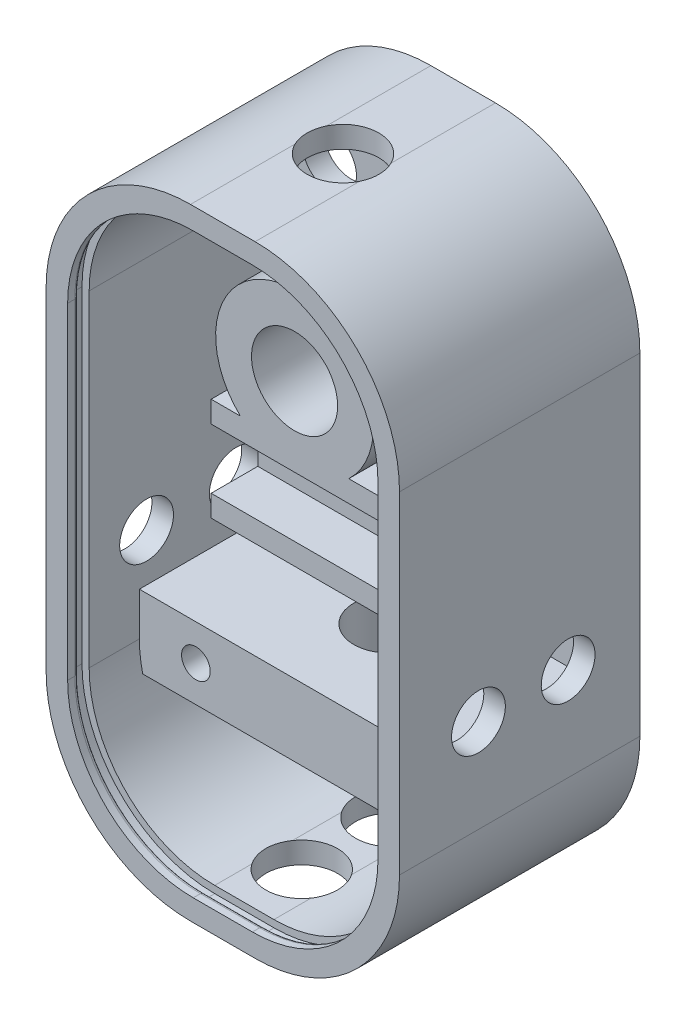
ISO-10303-21;
HEADER;
FILE_DESCRIPTION(('STEP AP214'),'2;1');
FILE_NAME('part.step','',(''),(''),'','','');
FILE_SCHEMA(('AUTOMOTIVE_DESIGN { 1 0 10303 214 1 1 1 1 }'));
ENDSEC;
DATA;
#1=APPLICATION_CONTEXT('core data for automotive mechanical design processes');
#2=APPLICATION_PROTOCOL_DEFINITION('international standard','automotive_design',2000,#1);
#3=PRODUCT_CONTEXT('',#1,'mechanical');
#4=PRODUCT('Part','Part','',(#3));
#5=PRODUCT_RELATED_PRODUCT_CATEGORY('part','',(#4));
#6=PRODUCT_DEFINITION_FORMATION('','',#4);
#7=PRODUCT_DEFINITION_CONTEXT('part definition',#1,'design');
#8=PRODUCT_DEFINITION('design','',#6,#7);
#9=PRODUCT_DEFINITION_SHAPE('','',#8);
#10=(LENGTH_UNIT() NAMED_UNIT(*) SI_UNIT(.MILLI.,.METRE.));
#11=(NAMED_UNIT(*) PLANE_ANGLE_UNIT() SI_UNIT($,.RADIAN.));
#12=(NAMED_UNIT(*) SI_UNIT($,.STERADIAN.) SOLID_ANGLE_UNIT());
#13=UNCERTAINTY_MEASURE_WITH_UNIT(LENGTH_MEASURE(1.E-05),#10,'distance_accuracy_value','');
#14=(GEOMETRIC_REPRESENTATION_CONTEXT(3) GLOBAL_UNCERTAINTY_ASSIGNED_CONTEXT((#13)) GLOBAL_UNIT_ASSIGNED_CONTEXT((#10,
#11,#12)) REPRESENTATION_CONTEXT('',''));
#15=CARTESIAN_POINT('',(0.,0.,0.));
#16=DIRECTION('',(0.,0.,1.));
#17=DIRECTION('',(1.,0.,0.));
#18=AXIS2_PLACEMENT_3D('',#15,#16,#17);
#19=CARTESIAN_POINT('',(-8.02000000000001,8.52,9.4));
#20=DIRECTION('',(0.,-1.,0.));
#21=DIRECTION('',(0.,0.,-1.));
#22=AXIS2_PLACEMENT_3D('',#19,#20,#21);
#23=PLANE('',#22);
#24=CARTESIAN_POINT('',(-6.65,8.52,3.2));
#25=DIRECTION('',(0.,-1.,0.));
#26=DIRECTION('',(0.,0.,-1.));
#27=AXIS2_PLACEMENT_3D('',#24,#25,#26);
#28=CIRCLE('',#27,2.);
#29=CARTESIAN_POINT('',(-6.65,8.52,1.2));
#30=VERTEX_POINT('',#29);
#31=CARTESIAN_POINT('',(-4.65,8.52,3.2));
#32=VERTEX_POINT('',#31);
#33=EDGE_CURVE('E968',#30,#32,#28,.T.);
#34=ORIENTED_EDGE('',*,*,#33,.T.);
#35=DIRECTION('',(0.,0.,1.));
#36=VECTOR('',#35,1.);
#37=CARTESIAN_POINT('',(-4.65,8.52,9.4));
#38=LINE('',#37,#36);
#39=CARTESIAN_POINT('',(-4.65,8.52,9.4));
#40=VERTEX_POINT('',#39);
#41=EDGE_CURVE('E969',#32,#40,#38,.T.);
#42=ORIENTED_EDGE('',*,*,#41,.T.);
#43=DIRECTION('',(-1.,0.,0.));
#44=VECTOR('',#43,1.);
#45=CARTESIAN_POINT('',(-8.02000000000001,8.52,9.4));
#46=LINE('',#45,#44);
#47=CARTESIAN_POINT('',(-3.0199337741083,8.52,9.4));
#48=VERTEX_POINT('',#47);
#49=EDGE_CURVE('E1772',#48,#40,#46,.T.);
#50=ORIENTED_EDGE('',*,*,#49,.F.);
#51=DIRECTION('',(0.,0.,-1.));
#52=VECTOR('',#51,1.);
#53=CARTESIAN_POINT('',(-3.0199337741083,8.52,9.4));
#54=LINE('',#53,#52);
#55=CARTESIAN_POINT('',(-3.0199337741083,8.52,1.2));
#56=VERTEX_POINT('',#55);
#57=EDGE_CURVE('E1203',#56,#48,#54,.F.);
#58=ORIENTED_EDGE('',*,*,#57,.F.);
#59=DIRECTION('',(-1.,0.,0.));
#60=VECTOR('',#59,1.);
#61=CARTESIAN_POINT('',(-1.65,8.52,1.2));
#62=LINE('',#61,#60);
#63=EDGE_CURVE('E972',#56,#30,#62,.T.);
#64=ORIENTED_EDGE('',*,*,#63,.T.);
#65=EDGE_LOOP('',(#34,#42,#50,#58,#64));
#66=FACE_BOUND('',#65,.T.);
#67=ADVANCED_FACE('F196',(#66),#23,.F.);
#68=CARTESIAN_POINT('',(-8.02000000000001,2.78,9.4));
#69=DIRECTION('',(0.,1.,0.));
#70=DIRECTION('',(0.,0.,1.));
#71=AXIS2_PLACEMENT_3D('',#68,#69,#70);
#72=PLANE('',#71);
#73=DIRECTION('',(1.,0.,0.));
#74=VECTOR('',#73,1.);
#75=CARTESIAN_POINT('',(-8.02000000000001,2.78,9.4));
#76=LINE('',#75,#74);
#77=CARTESIAN_POINT('',(-4.65,2.78,9.4));
#78=VERTEX_POINT('',#77);
#79=CARTESIAN_POINT('',(8.65,2.78,9.4));
#80=VERTEX_POINT('',#79);
#81=EDGE_CURVE('E1769',#78,#80,#76,.T.);
#82=ORIENTED_EDGE('',*,*,#81,.F.);
#83=DIRECTION('',(0.,0.,1.));
#84=VECTOR('',#83,1.);
#85=CARTESIAN_POINT('',(-4.65,2.78,0.));
#86=LINE('',#85,#84);
#87=CARTESIAN_POINT('',(-4.65,2.78,3.2));
#88=VERTEX_POINT('',#87);
#89=EDGE_CURVE('E723',#88,#78,#86,.T.);
#90=ORIENTED_EDGE('',*,*,#89,.F.);
#91=CARTESIAN_POINT('',(-6.65,2.78,3.2));
#92=DIRECTION('',(0.,-1.,0.));
#93=DIRECTION('',(0.,0.,-1.));
#94=AXIS2_PLACEMENT_3D('',#91,#92,#93);
#95=CIRCLE('',#94,2.);
#96=CARTESIAN_POINT('',(-6.65,2.78,1.2));
#97=VERTEX_POINT('',#96);
#98=EDGE_CURVE('E733',#97,#88,#95,.T.);
#99=ORIENTED_EDGE('',*,*,#98,.F.);
#100=DIRECTION('',(1.,0.,0.));
#101=VECTOR('',#100,1.);
#102=CARTESIAN_POINT('',(-1.65,2.78,1.2));
#103=LINE('',#102,#101);
#104=CARTESIAN_POINT('',(8.05,2.78,1.2));
#105=VERTEX_POINT('',#104);
#106=EDGE_CURVE('E1801',#97,#105,#103,.T.);
#107=ORIENTED_EDGE('',*,*,#106,.T.);
#108=CARTESIAN_POINT('',(8.05,2.78,1.8));
#109=DIRECTION('',(0.,1.,0.));
#110=DIRECTION('',(0.,0.,1.));
#111=AXIS2_PLACEMENT_3D('',#108,#109,#110);
#112=CIRCLE('',#111,0.6);
#113=CARTESIAN_POINT('',(8.65,2.78,1.8));
#114=VERTEX_POINT('',#113);
#115=EDGE_CURVE('E1853',#105,#114,#112,.F.);
#116=ORIENTED_EDGE('',*,*,#115,.T.);
#117=DIRECTION('',(0.,0.,-1.));
#118=VECTOR('',#117,1.);
#119=CARTESIAN_POINT('',(8.65,2.78,13.4));
#120=LINE('',#119,#118);
#121=EDGE_CURVE('E743',#80,#114,#120,.T.);
#122=ORIENTED_EDGE('',*,*,#121,.F.);
#123=EDGE_LOOP('',(#82,#90,#99,#107,#116,#122));
#124=FACE_BOUND('',#123,.T.);
#125=ADVANCED_FACE('F959',(#124),#72,.F.);
#126=CARTESIAN_POINT('',(-6.9675,5.03249999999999,15.5));
#127=DIRECTION('',(0.,1.,0.));
#128=DIRECTION('',(0.,0.,1.));
#129=AXIS2_PLACEMENT_3D('',#126,#127,#128);
#130=PLANE('',#129);
#131=DIRECTION('',(0.,0.,-1.));
#132=VECTOR('',#131,1.);
#133=CARTESIAN_POINT('',(-4.65,5.03249999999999,15.5));
#134=LINE('',#133,#132);
#135=CARTESIAN_POINT('',(-4.65,5.03249999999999,6.8));
#136=VERTEX_POINT('',#135);
#137=CARTESIAN_POINT('',(-4.65,5.03249999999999,3.2));
#138=VERTEX_POINT('',#137);
#139=EDGE_CURVE('E988',#136,#138,#134,.T.);
#140=ORIENTED_EDGE('',*,*,#139,.F.);
#141=DIRECTION('',(-1.,0.,0.));
#142=VECTOR('',#141,1.);
#143=CARTESIAN_POINT('',(0.,5.03249999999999,6.8));
#144=LINE('',#143,#142);
#145=CARTESIAN_POINT('',(6.9675,5.03249999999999,6.8));
#146=VERTEX_POINT('',#145);
#147=EDGE_CURVE('E1820',#146,#136,#144,.T.);
#148=ORIENTED_EDGE('',*,*,#147,.F.);
#149=DIRECTION('',(0.,0.,-1.));
#150=VECTOR('',#149,1.);
#151=CARTESIAN_POINT('',(6.9675,5.03249999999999,15.5));
#152=LINE('',#151,#150);
#153=CARTESIAN_POINT('',(6.9675,5.03249999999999,1.2));
#154=VERTEX_POINT('',#153);
#155=EDGE_CURVE('E1732',#146,#154,#152,.T.);
#156=ORIENTED_EDGE('',*,*,#155,.T.);
#157=DIRECTION('',(-1.,0.,0.));
#158=VECTOR('',#157,1.);
#159=CARTESIAN_POINT('',(-6.9675,5.03249999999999,1.2));
#160=LINE('',#159,#158);
#161=CARTESIAN_POINT('',(-6.65,5.03249999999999,1.2));
#162=VERTEX_POINT('',#161);
#163=EDGE_CURVE('E1709',#154,#162,#160,.T.);
#164=ORIENTED_EDGE('',*,*,#163,.T.);
#165=CARTESIAN_POINT('',(-6.65,5.03249999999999,3.2));
#166=DIRECTION('',(0.,1.,0.));
#167=DIRECTION('',(0.,0.,1.));
#168=AXIS2_PLACEMENT_3D('',#165,#166,#167);
#169=CIRCLE('',#168,2.);
#170=EDGE_CURVE('E2958',#138,#162,#169,.T.);
#171=ORIENTED_EDGE('',*,*,#170,.F.);
#172=EDGE_LOOP('',(#140,#148,#156,#164,#171));
#173=FACE_BOUND('',#172,.T.);
#174=ADVANCED_FACE('F923',(#173),#130,.T.);
#175=CARTESIAN_POINT('',(-6.9675,6.26749999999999,15.5));
#176=DIRECTION('',(0.,-1.,0.));
#177=DIRECTION('',(0.,0.,-1.));
#178=AXIS2_PLACEMENT_3D('',#175,#176,#177);
#179=PLANE('',#178);
#180=DIRECTION('',(0.,0.,1.));
#181=VECTOR('',#180,1.);
#182=CARTESIAN_POINT('',(-4.65,6.26749999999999,15.5));
#183=LINE('',#182,#181);
#184=CARTESIAN_POINT('',(-4.65,6.26749999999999,3.2));
#185=VERTEX_POINT('',#184);
#186=CARTESIAN_POINT('',(-4.65,6.26749999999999,6.8));
#187=VERTEX_POINT('',#186);
#188=EDGE_CURVE('E12',#185,#187,#183,.T.);
#189=ORIENTED_EDGE('',*,*,#188,.F.);
#190=CARTESIAN_POINT('',(-6.65,6.26749999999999,3.2));
#191=DIRECTION('',(0.,-1.,0.));
#192=DIRECTION('',(0.,0.,-1.));
#193=AXIS2_PLACEMENT_3D('',#190,#191,#192);
#194=CIRCLE('',#193,2.);
#195=CARTESIAN_POINT('',(-6.65,6.26749999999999,1.2));
#196=VERTEX_POINT('',#195);
#197=EDGE_CURVE('E982',#196,#185,#194,.T.);
#198=ORIENTED_EDGE('',*,*,#197,.F.);
#199=DIRECTION('',(1.,0.,0.));
#200=VECTOR('',#199,1.);
#201=CARTESIAN_POINT('',(6.9675,6.26749999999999,1.2));
#202=LINE('',#201,#200);
#203=CARTESIAN_POINT('',(6.9675,6.26749999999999,1.2));
#204=VERTEX_POINT('',#203);
#205=EDGE_CURVE('E1716',#196,#204,#202,.T.);
#206=ORIENTED_EDGE('',*,*,#205,.T.);
#207=DIRECTION('',(0.,0.,-1.));
#208=VECTOR('',#207,1.);
#209=CARTESIAN_POINT('',(6.9675,6.26749999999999,15.5));
#210=LINE('',#209,#208);
#211=CARTESIAN_POINT('',(6.9675,6.26749999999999,6.8));
#212=VERTEX_POINT('',#211);
#213=EDGE_CURVE('E1728',#212,#204,#210,.T.);
#214=ORIENTED_EDGE('',*,*,#213,.F.);
#215=DIRECTION('',(1.,0.,0.));
#216=VECTOR('',#215,1.);
#217=CARTESIAN_POINT('',(0.,6.26749999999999,6.8));
#218=LINE('',#217,#216);
#219=EDGE_CURVE('E1813',#187,#212,#218,.T.);
#220=ORIENTED_EDGE('',*,*,#219,.F.);
#221=EDGE_LOOP('',(#189,#198,#206,#214,#220));
#222=FACE_BOUND('',#221,.T.);
#223=ADVANCED_FACE('F914',(#222),#179,.T.);
#224=CARTESIAN_POINT('',(-1.65,-5.05,12.2));
#225=DIRECTION('',(0.,0.,1.));
#226=DIRECTION('',(1.,0.,0.));
#227=AXIS2_PLACEMENT_3D('',#224,#225,#226);
#228=CYLINDRICAL_SURFACE('',#227,7.4);
#229=CARTESIAN_POINT('',(-1.65,-5.05,12.8));
#230=DIRECTION('',(0.,0.,1.));
#231=DIRECTION('',(1.,0.,0.));
#232=AXIS2_PLACEMENT_3D('',#229,#230,#231);
#233=CIRCLE('',#232,7.4);
#234=CARTESIAN_POINT('',(-9.05,-5.05,12.8));
#235=VERTEX_POINT('',#234);
#236=CARTESIAN_POINT('',(-1.65,-12.45,12.8));
#237=VERTEX_POINT('',#236);
#238=EDGE_CURVE('E1034',#235,#237,#233,.T.);
#239=ORIENTED_EDGE('',*,*,#238,.T.);
#240=DIRECTION('',(0.,0.,1.));
#241=VECTOR('',#240,1.);
#242=CARTESIAN_POINT('',(-1.65,-12.45,12.2));
#243=LINE('',#242,#241);
#244=CARTESIAN_POINT('',(-1.65,-12.45,12.2));
#245=VERTEX_POINT('',#244);
#246=EDGE_CURVE('E1143',#245,#237,#243,.T.);
#247=ORIENTED_EDGE('',*,*,#246,.F.);
#248=CARTESIAN_POINT('',(-1.65,-5.05,12.2));
#249=DIRECTION('',(0.,0.,1.));
#250=DIRECTION('',(1.,0.,0.));
#251=AXIS2_PLACEMENT_3D('',#248,#249,#250);
#252=CIRCLE('',#251,7.4);
#253=CARTESIAN_POINT('',(-9.05,-5.05,12.2));
#254=VERTEX_POINT('',#253);
#255=EDGE_CURVE('E1111',#254,#245,#252,.T.);
#256=ORIENTED_EDGE('',*,*,#255,.F.);
#257=DIRECTION('',(0.,0.,1.));
#258=VECTOR('',#257,1.);
#259=CARTESIAN_POINT('',(-9.05,-5.05,12.2));
#260=LINE('',#259,#258);
#261=EDGE_CURVE('E1144',#254,#235,#260,.T.);
#262=ORIENTED_EDGE('',*,*,#261,.T.);
#263=EDGE_LOOP('',(#239,#247,#256,#262));
#264=FACE_BOUND('',#263,.T.);
#265=ADVANCED_FACE('F2172',(#264),#228,.F.);
#266=CARTESIAN_POINT('',(-9.05,13.15,12.2));
#267=DIRECTION('',(-1.,0.,0.));
#268=DIRECTION('',(0.,-1.,0.));
#269=AXIS2_PLACEMENT_3D('',#266,#267,#268);
#270=PLANE('',#269);
#271=DIRECTION('',(0.,-1.,0.));
#272=VECTOR('',#271,1.);
#273=CARTESIAN_POINT('',(-9.05,13.15,12.8));
#274=LINE('',#273,#272);
#275=CARTESIAN_POINT('',(-9.05,13.15,12.8));
#276=VERTEX_POINT('',#275);
#277=EDGE_CURVE('E1076',#276,#235,#274,.T.);
#278=ORIENTED_EDGE('',*,*,#277,.T.);
#279=ORIENTED_EDGE('',*,*,#261,.F.);
#280=DIRECTION('',(0.,-1.,0.));
#281=VECTOR('',#280,1.);
#282=CARTESIAN_POINT('',(-9.05,13.15,12.2));
#283=LINE('',#282,#281);
#284=CARTESIAN_POINT('',(-9.05,13.15,12.2));
#285=VERTEX_POINT('',#284);
#286=EDGE_CURVE('E1139',#285,#254,#283,.T.);
#287=ORIENTED_EDGE('',*,*,#286,.F.);
#288=DIRECTION('',(0.,0.,1.));
#289=VECTOR('',#288,1.);
#290=CARTESIAN_POINT('',(-9.05,13.15,12.2));
#291=LINE('',#290,#289);
#292=EDGE_CURVE('E1149',#285,#276,#291,.T.);
#293=ORIENTED_EDGE('',*,*,#292,.T.);
#294=EDGE_LOOP('',(#278,#279,#287,#293));
#295=FACE_BOUND('',#294,.T.);
#296=ADVANCED_FACE('F2168',(#295),#270,.F.);
#297=CARTESIAN_POINT('',(-1.65,13.15,12.2));
#298=DIRECTION('',(0.,0.,1.));
#299=DIRECTION('',(1.,0.,0.));
#300=AXIS2_PLACEMENT_3D('',#297,#298,#299);
#301=CYLINDRICAL_SURFACE('',#300,7.4);
#302=CARTESIAN_POINT('',(-1.65,13.15,12.8));
#303=DIRECTION('',(0.,0.,1.));
#304=DIRECTION('',(1.,0.,0.));
#305=AXIS2_PLACEMENT_3D('',#302,#303,#304);
#306=CIRCLE('',#305,7.4);
#307=CARTESIAN_POINT('',(-1.65,20.55,12.8));
#308=VERTEX_POINT('',#307);
#309=EDGE_CURVE('E1073',#308,#276,#306,.T.);
#310=ORIENTED_EDGE('',*,*,#309,.T.);
#311=ORIENTED_EDGE('',*,*,#292,.F.);
#312=CARTESIAN_POINT('',(-1.65,13.15,12.2));
#313=DIRECTION('',(0.,0.,1.));
#314=DIRECTION('',(1.,0.,0.));
#315=AXIS2_PLACEMENT_3D('',#312,#313,#314);
#316=CIRCLE('',#315,7.4);
#317=CARTESIAN_POINT('',(-1.65,20.55,12.2));
#318=VERTEX_POINT('',#317);
#319=EDGE_CURVE('E1135',#318,#285,#316,.T.);
#320=ORIENTED_EDGE('',*,*,#319,.F.);
#321=DIRECTION('',(0.,0.,1.));
#322=VECTOR('',#321,1.);
#323=CARTESIAN_POINT('',(-1.65,20.55,12.2));
#324=LINE('',#323,#322);
#325=EDGE_CURVE('E1153',#318,#308,#324,.T.);
#326=ORIENTED_EDGE('',*,*,#325,.T.);
#327=EDGE_LOOP('',(#310,#311,#320,#326));
#328=FACE_BOUND('',#327,.T.);
#329=ADVANCED_FACE('F2171',(#328),#301,.F.);
#330=CARTESIAN_POINT('',(1.65,20.55,12.2));
#331=DIRECTION('',(0.,1.,0.));
#332=DIRECTION('',(0.,0.,1.));
#333=AXIS2_PLACEMENT_3D('',#330,#331,#332);
#334=PLANE('',#333);
#335=DIRECTION('',(-1.,0.,0.));
#336=VECTOR('',#335,1.);
#337=CARTESIAN_POINT('',(1.65,20.55,12.8));
#338=LINE('',#337,#336);
#339=CARTESIAN_POINT('',(1.65,20.55,12.8));
#340=VERTEX_POINT('',#339);
#341=EDGE_CURVE('E1070',#340,#308,#338,.T.);
#342=ORIENTED_EDGE('',*,*,#341,.T.);
#343=ORIENTED_EDGE('',*,*,#325,.F.);
#344=DIRECTION('',(-1.,0.,0.));
#345=VECTOR('',#344,1.);
#346=CARTESIAN_POINT('',(1.65,20.55,12.2));
#347=LINE('',#346,#345);
#348=CARTESIAN_POINT('',(1.65,20.55,12.2));
#349=VERTEX_POINT('',#348);
#350=EDGE_CURVE('E1131',#349,#318,#347,.T.);
#351=ORIENTED_EDGE('',*,*,#350,.F.);
#352=DIRECTION('',(0.,0.,1.));
#353=VECTOR('',#352,1.);
#354=CARTESIAN_POINT('',(1.65,20.55,12.2));
#355=LINE('',#354,#353);
#356=EDGE_CURVE('E1157',#349,#340,#355,.T.);
#357=ORIENTED_EDGE('',*,*,#356,.T.);
#358=EDGE_LOOP('',(#342,#343,#351,#357));
#359=FACE_BOUND('',#358,.T.);
#360=ADVANCED_FACE('F2176',(#359),#334,.F.);
#361=CARTESIAN_POINT('',(1.65,13.15,12.2));
#362=DIRECTION('',(0.,0.,1.));
#363=DIRECTION('',(1.,0.,0.));
#364=AXIS2_PLACEMENT_3D('',#361,#362,#363);
#365=CYLINDRICAL_SURFACE('',#364,7.4);
#366=CARTESIAN_POINT('',(1.65,13.15,12.8));
#367=DIRECTION('',(0.,0.,1.));
#368=DIRECTION('',(1.,0.,0.));
#369=AXIS2_PLACEMENT_3D('',#366,#367,#368);
#370=CIRCLE('',#369,7.4);
#371=CARTESIAN_POINT('',(9.05,13.15,12.8));
#372=VERTEX_POINT('',#371);
#373=EDGE_CURVE('E1067',#372,#340,#370,.T.);
#374=ORIENTED_EDGE('',*,*,#373,.T.);
#375=ORIENTED_EDGE('',*,*,#356,.F.);
#376=CARTESIAN_POINT('',(1.65,13.15,12.2));
#377=DIRECTION('',(0.,0.,1.));
#378=DIRECTION('',(1.,0.,0.));
#379=AXIS2_PLACEMENT_3D('',#376,#377,#378);
#380=CIRCLE('',#379,7.4);
#381=CARTESIAN_POINT('',(9.05,13.15,12.2));
#382=VERTEX_POINT('',#381);
#383=EDGE_CURVE('E1127',#382,#349,#380,.T.);
#384=ORIENTED_EDGE('',*,*,#383,.F.);
#385=DIRECTION('',(0.,0.,1.));
#386=VECTOR('',#385,1.);
#387=CARTESIAN_POINT('',(9.05,13.15,12.2));
#388=LINE('',#387,#386);
#389=EDGE_CURVE('E1161',#382,#372,#388,.T.);
#390=ORIENTED_EDGE('',*,*,#389,.T.);
#391=EDGE_LOOP('',(#374,#375,#384,#390));
#392=FACE_BOUND('',#391,.T.);
#393=ADVANCED_FACE('F2180',(#392),#365,.F.);
#394=CARTESIAN_POINT('',(9.05,-5.05,12.2));
#395=DIRECTION('',(1.,0.,0.));
#396=DIRECTION('',(0.,1.,0.));
#397=AXIS2_PLACEMENT_3D('',#394,#395,#396);
#398=PLANE('',#397);
#399=DIRECTION('',(0.,1.,0.));
#400=VECTOR('',#399,1.);
#401=CARTESIAN_POINT('',(9.05,-5.05,12.8));
#402=LINE('',#401,#400);
#403=CARTESIAN_POINT('',(9.05,-5.05,12.8));
#404=VERTEX_POINT('',#403);
#405=EDGE_CURVE('E1064',#404,#372,#402,.T.);
#406=ORIENTED_EDGE('',*,*,#405,.T.);
#407=ORIENTED_EDGE('',*,*,#389,.F.);
#408=DIRECTION('',(0.,1.,0.));
#409=VECTOR('',#408,1.);
#410=CARTESIAN_POINT('',(9.05,-5.05,12.2));
#411=LINE('',#410,#409);
#412=CARTESIAN_POINT('',(9.05,-5.05,12.2));
#413=VERTEX_POINT('',#412);
#414=EDGE_CURVE('E1123',#413,#382,#411,.T.);
#415=ORIENTED_EDGE('',*,*,#414,.F.);
#416=DIRECTION('',(0.,0.,1.));
#417=VECTOR('',#416,1.);
#418=CARTESIAN_POINT('',(9.05,-5.05,12.2));
#419=LINE('',#418,#417);
#420=EDGE_CURVE('E1165',#413,#404,#419,.T.);
#421=ORIENTED_EDGE('',*,*,#420,.T.);
#422=EDGE_LOOP('',(#406,#407,#415,#421));
#423=FACE_BOUND('',#422,.T.);
#424=ADVANCED_FACE('F2184',(#423),#398,.F.);
#425=CARTESIAN_POINT('',(1.65,-5.05,12.2));
#426=DIRECTION('',(0.,0.,1.));
#427=DIRECTION('',(1.,0.,0.));
#428=AXIS2_PLACEMENT_3D('',#425,#426,#427);
#429=CYLINDRICAL_SURFACE('',#428,7.4);
#430=CARTESIAN_POINT('',(1.65,-5.05,12.8));
#431=DIRECTION('',(0.,0.,1.));
#432=DIRECTION('',(1.,0.,0.));
#433=AXIS2_PLACEMENT_3D('',#430,#431,#432);
#434=CIRCLE('',#433,7.4);
#435=CARTESIAN_POINT('',(1.65,-12.45,12.8));
#436=VERTEX_POINT('',#435);
#437=EDGE_CURVE('E1061',#436,#404,#434,.T.);
#438=ORIENTED_EDGE('',*,*,#437,.T.);
#439=ORIENTED_EDGE('',*,*,#420,.F.);
#440=CARTESIAN_POINT('',(1.65,-5.05,12.2));
#441=DIRECTION('',(0.,0.,1.));
#442=DIRECTION('',(1.,0.,0.));
#443=AXIS2_PLACEMENT_3D('',#440,#441,#442);
#444=CIRCLE('',#443,7.4);
#445=CARTESIAN_POINT('',(1.65,-12.45,12.2));
#446=VERTEX_POINT('',#445);
#447=EDGE_CURVE('E1119',#446,#413,#444,.T.);
#448=ORIENTED_EDGE('',*,*,#447,.F.);
#449=DIRECTION('',(0.,0.,1.));
#450=VECTOR('',#449,1.);
#451=CARTESIAN_POINT('',(1.65,-12.45,12.2));
#452=LINE('',#451,#450);
#453=EDGE_CURVE('E1169',#446,#436,#452,.T.);
#454=ORIENTED_EDGE('',*,*,#453,.T.);
#455=EDGE_LOOP('',(#438,#439,#448,#454));
#456=FACE_BOUND('',#455,.T.);
#457=ADVANCED_FACE('F2188',(#456),#429,.F.);
#458=CARTESIAN_POINT('',(-1.65,-12.45,12.2));
#459=DIRECTION('',(0.,-1.,0.));
#460=DIRECTION('',(0.,0.,-1.));
#461=AXIS2_PLACEMENT_3D('',#458,#459,#460);
#462=PLANE('',#461);
#463=DIRECTION('',(1.,0.,0.));
#464=VECTOR('',#463,1.);
#465=CARTESIAN_POINT('',(-1.65,-12.45,12.8));
#466=LINE('',#465,#464);
#467=EDGE_CURVE('E1058',#237,#436,#466,.T.);
#468=ORIENTED_EDGE('',*,*,#467,.T.);
#469=ORIENTED_EDGE('',*,*,#453,.F.);
#470=DIRECTION('',(1.,0.,0.));
#471=VECTOR('',#470,1.);
#472=CARTESIAN_POINT('',(-1.65,-12.45,12.2));
#473=LINE('',#472,#471);
#474=EDGE_CURVE('E1115',#245,#446,#473,.T.);
#475=ORIENTED_EDGE('',*,*,#474,.F.);
#476=ORIENTED_EDGE('',*,*,#246,.T.);
#477=EDGE_LOOP('',(#468,#469,#475,#476));
#478=FACE_BOUND('',#477,.T.);
#479=ADVANCED_FACE('F2192',(#478),#462,.F.);
#480=CARTESIAN_POINT('',(-8.65,20.15,13.4));
#481=DIRECTION('',(1.,0.,0.));
#482=DIRECTION('',(0.,1.,0.));
#483=AXIS2_PLACEMENT_3D('',#480,#481,#482);
#484=PLANE('',#483);
#485=DIRECTION('',(0.,-1.,0.));
#486=VECTOR('',#485,1.);
#487=CARTESIAN_POINT('',(-8.65,8.78,3.2));
#488=LINE('',#487,#486);
#489=CARTESIAN_POINT('',(-8.65,8.52,3.2));
#490=VERTEX_POINT('',#489);
#491=CARTESIAN_POINT('',(-8.65,2.78,3.2));
#492=VERTEX_POINT('',#491);
#493=EDGE_CURVE('E710',#490,#492,#488,.T.);
#494=ORIENTED_EDGE('',*,*,#493,.F.);
#495=DIRECTION('',(0.,0.,-1.));
#496=VECTOR('',#495,1.);
#497=CARTESIAN_POINT('',(-8.65,8.52,13.4));
#498=LINE('',#497,#496);
#499=CARTESIAN_POINT('',(-8.65,8.52,1.8));
#500=VERTEX_POINT('',#499);
#501=EDGE_CURVE('E750',#490,#500,#498,.T.);
#502=ORIENTED_EDGE('',*,*,#501,.T.);
#503=DIRECTION('',(0.,1.,0.));
#504=VECTOR('',#503,1.);
#505=CARTESIAN_POINT('',(-8.65,20.15,1.8));
#506=LINE('',#505,#504);
#507=CARTESIAN_POINT('',(-8.65,13.15,1.8));
#508=VERTEX_POINT('',#507);
#509=EDGE_CURVE('E1463',#500,#508,#506,.T.);
#510=ORIENTED_EDGE('',*,*,#509,.T.);
#511=DIRECTION('',(0.,0.,-1.));
#512=VECTOR('',#511,1.);
#513=CARTESIAN_POINT('',(-8.65,13.15,13.4));
#514=LINE('',#513,#512);
#515=CARTESIAN_POINT('',(-8.65,13.15,12.2));
#516=VERTEX_POINT('',#515);
#517=EDGE_CURVE('E1893',#508,#516,#514,.F.);
#518=ORIENTED_EDGE('',*,*,#517,.T.);
#519=DIRECTION('',(0.,-1.,0.));
#520=VECTOR('',#519,1.);
#521=CARTESIAN_POINT('',(-8.65,13.15,12.2));
#522=LINE('',#521,#520);
#523=CARTESIAN_POINT('',(-8.65,-5.05,12.2));
#524=VERTEX_POINT('',#523);
#525=EDGE_CURVE('E1107',#516,#524,#522,.T.);
#526=ORIENTED_EDGE('',*,*,#525,.T.);
#527=DIRECTION('',(0.,0.,-1.));
#528=VECTOR('',#527,1.);
#529=CARTESIAN_POINT('',(-8.65,-5.05,0.));
#530=LINE('',#529,#528);
#531=CARTESIAN_POINT('',(-8.65,-5.05,9.4));
#532=VERTEX_POINT('',#531);
#533=EDGE_CURVE('E1898',#524,#532,#530,.T.);
#534=ORIENTED_EDGE('',*,*,#533,.T.);
#535=DIRECTION('',(0.,-1.,0.));
#536=VECTOR('',#535,1.);
#537=CARTESIAN_POINT('',(-8.65,-2.65,9.4));
#538=LINE('',#537,#536);
#539=CARTESIAN_POINT('',(-8.65,-2.65,9.4));
#540=VERTEX_POINT('',#539);
#541=EDGE_CURVE('E1677',#540,#532,#538,.T.);
#542=ORIENTED_EDGE('',*,*,#541,.F.);
#543=DIRECTION('',(0.,0.,-1.));
#544=VECTOR('',#543,1.);
#545=CARTESIAN_POINT('',(-8.65,-2.65,9.4));
#546=LINE('',#545,#544);
#547=CARTESIAN_POINT('',(-8.65,-2.65,1.8));
#548=VERTEX_POINT('',#547);
#549=EDGE_CURVE('E1691',#540,#548,#546,.T.);
#550=ORIENTED_EDGE('',*,*,#549,.T.);
#551=DIRECTION('',(0.,1.,0.));
#552=VECTOR('',#551,1.);
#553=CARTESIAN_POINT('',(-8.65,20.15,1.8));
#554=LINE('',#553,#552);
#555=CARTESIAN_POINT('',(-8.65,2.78,1.8));
#556=VERTEX_POINT('',#555);
#557=EDGE_CURVE('E740',#548,#556,#554,.T.);
#558=ORIENTED_EDGE('',*,*,#557,.T.);
#559=DIRECTION('',(0.,0.,1.));
#560=VECTOR('',#559,1.);
#561=CARTESIAN_POINT('',(-8.65,2.78,13.4));
#562=LINE('',#561,#560);
#563=EDGE_CURVE('E729',#556,#492,#562,.T.);
#564=ORIENTED_EDGE('',*,*,#563,.T.);
#565=EDGE_LOOP('',(#494,#502,#510,#518,#526,#534,#542,#550,#558,#564));
#566=FACE_BOUND('',#565,.T.);
#567=CARTESIAN_POINT('',(-8.65,0.,4.));
#568=DIRECTION('',(1.,0.,0.));
#569=DIRECTION('',(0.,1.,0.));
#570=AXIS2_PLACEMENT_3D('',#567,#568,#569);
#571=CIRCLE('',#570,1.5);
#572=CARTESIAN_POINT('',(-8.65,1.5,4.));
#573=VERTEX_POINT('',#572);
#574=EDGE_CURVE('E1649',#573,#573,#571,.T.);
#575=ORIENTED_EDGE('',*,*,#574,.F.);
#576=EDGE_LOOP('',(#575));
#577=FACE_BOUND('',#576,.T.);
#578=CARTESIAN_POINT('',(-8.65,0.,9.));
#579=DIRECTION('',(1.,0.,0.));
#580=DIRECTION('',(0.,1.,0.));
#581=AXIS2_PLACEMENT_3D('',#578,#579,#580);
#582=CIRCLE('',#581,1.5);
#583=CARTESIAN_POINT('',(-8.65,1.49999999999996,9.));
#584=VERTEX_POINT('',#583);
#585=EDGE_CURVE('E1637',#584,#584,#582,.T.);
#586=ORIENTED_EDGE('',*,*,#585,.F.);
#587=EDGE_LOOP('',(#586));
#588=FACE_BOUND('',#587,.T.);
#589=ADVANCED_FACE('F736',(#566,#577,#588),#484,.T.);
#590=CARTESIAN_POINT('',(8.65,20.15,13.4));
#591=DIRECTION('',(-1.,0.,0.));
#592=DIRECTION('',(0.,-1.,0.));
#593=AXIS2_PLACEMENT_3D('',#590,#591,#592);
#594=PLANE('',#593);
#595=CARTESIAN_POINT('',(8.65,0.,4.));
#596=DIRECTION('',(-1.,0.,0.));
#597=DIRECTION('',(0.,-1.,0.));
#598=AXIS2_PLACEMENT_3D('',#595,#596,#597);
#599=CIRCLE('',#598,1.5);
#600=CARTESIAN_POINT('',(8.65,-1.5,4.));
#601=VERTEX_POINT('',#600);
#602=EDGE_CURVE('E1645',#601,#601,#599,.T.);
#603=ORIENTED_EDGE('',*,*,#602,.F.);
#604=EDGE_LOOP('',(#603));
#605=FACE_BOUND('',#604,.T.);
#606=CARTESIAN_POINT('',(8.65,0.,9.));
#607=DIRECTION('',(-1.,0.,0.));
#608=DIRECTION('',(0.,-1.,0.));
#609=AXIS2_PLACEMENT_3D('',#606,#607,#608);
#610=CIRCLE('',#609,1.5);
#611=CARTESIAN_POINT('',(8.65,-1.50000000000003,9.));
#612=VERTEX_POINT('',#611);
#613=EDGE_CURVE('E1633',#612,#612,#610,.T.);
#614=ORIENTED_EDGE('',*,*,#613,.F.);
#615=EDGE_LOOP('',(#614));
#616=FACE_BOUND('',#615,.T.);
#617=DIRECTION('',(0.,0.,-1.));
#618=VECTOR('',#617,1.);
#619=CARTESIAN_POINT('',(8.65,-5.05,13.4));
#620=LINE('',#619,#618);
#621=CARTESIAN_POINT('',(8.65,-5.05,9.4));
#622=VERTEX_POINT('',#621);
#623=CARTESIAN_POINT('',(8.65,-5.05,12.2));
#624=VERTEX_POINT('',#623);
#625=EDGE_CURVE('E1889',#622,#624,#620,.F.);
#626=ORIENTED_EDGE('',*,*,#625,.T.);
#627=DIRECTION('',(0.,1.,0.));
#628=VECTOR('',#627,1.);
#629=CARTESIAN_POINT('',(8.65,-5.05,12.2));
#630=LINE('',#629,#628);
#631=CARTESIAN_POINT('',(8.65,13.15,12.2));
#632=VERTEX_POINT('',#631);
#633=EDGE_CURVE('E1091',#624,#632,#630,.T.);
#634=ORIENTED_EDGE('',*,*,#633,.T.);
#635=DIRECTION('',(0.,0.,-1.));
#636=VECTOR('',#635,1.);
#637=CARTESIAN_POINT('',(8.65,13.15,0.));
#638=LINE('',#637,#636);
#639=CARTESIAN_POINT('',(8.65,13.15,1.8));
#640=VERTEX_POINT('',#639);
#641=EDGE_CURVE('E1894',#632,#640,#638,.T.);
#642=ORIENTED_EDGE('',*,*,#641,.T.);
#643=DIRECTION('',(0.,-1.,0.));
#644=VECTOR('',#643,1.);
#645=CARTESIAN_POINT('',(8.65,20.15,1.8));
#646=LINE('',#645,#644);
#647=CARTESIAN_POINT('',(8.65,8.52,1.8));
#648=VERTEX_POINT('',#647);
#649=EDGE_CURVE('E1434',#640,#648,#646,.T.);
#650=ORIENTED_EDGE('',*,*,#649,.T.);
#651=DIRECTION('',(0.,0.,1.));
#652=VECTOR('',#651,1.);
#653=CARTESIAN_POINT('',(8.65,8.52,13.4));
#654=LINE('',#653,#652);
#655=CARTESIAN_POINT('',(8.65,8.52,9.4));
#656=VERTEX_POINT('',#655);
#657=EDGE_CURVE('E1779',#648,#656,#654,.T.);
#658=ORIENTED_EDGE('',*,*,#657,.T.);
#659=DIRECTION('',(0.,1.,0.));
#660=VECTOR('',#659,1.);
#661=CARTESIAN_POINT('',(8.65,20.15,9.4));
#662=LINE('',#661,#660);
#663=EDGE_CURVE('E1808',#80,#656,#662,.T.);
#664=ORIENTED_EDGE('',*,*,#663,.F.);
#665=ORIENTED_EDGE('',*,*,#121,.T.);
#666=DIRECTION('',(0.,-1.,0.));
#667=VECTOR('',#666,1.);
#668=CARTESIAN_POINT('',(8.65,20.15,1.8));
#669=LINE('',#668,#667);
#670=CARTESIAN_POINT('',(8.65,-2.65,1.8));
#671=VERTEX_POINT('',#670);
#672=EDGE_CURVE('E1582',#114,#671,#669,.T.);
#673=ORIENTED_EDGE('',*,*,#672,.T.);
#674=DIRECTION('',(0.,0.,-1.));
#675=VECTOR('',#674,1.);
#676=CARTESIAN_POINT('',(8.65,-2.65,9.4));
#677=LINE('',#676,#675);
#678=CARTESIAN_POINT('',(8.65,-2.65,9.4));
#679=VERTEX_POINT('',#678);
#680=EDGE_CURVE('E1694',#679,#671,#677,.T.);
#681=ORIENTED_EDGE('',*,*,#680,.F.);
#682=DIRECTION('',(0.,1.,0.));
#683=VECTOR('',#682,1.);
#684=CARTESIAN_POINT('',(8.65,-2.65,9.4));
#685=LINE('',#684,#683);
#686=EDGE_CURVE('E1685',#622,#679,#685,.T.);
#687=ORIENTED_EDGE('',*,*,#686,.F.);
#688=EDGE_LOOP('',(#626,#634,#642,#650,#658,#664,#665,#673,#681,#687));
#689=FACE_BOUND('',#688,.T.);
#690=ADVANCED_FACE('F1310',(#605,#616,#689),#594,.T.);
#691=CARTESIAN_POINT('',(1.65,-5.05,13.4));
#692=DIRECTION('',(0.,0.,1.));
#693=DIRECTION('',(1.,0.,0.));
#694=AXIS2_PLACEMENT_3D('',#691,#692,#693);
#695=CYLINDRICAL_SURFACE('',#694,7.);
#696=CARTESIAN_POINT('',(1.65,-5.05,12.2));
#697=DIRECTION('',(0.,0.,1.));
#698=DIRECTION('',(1.,0.,0.));
#699=AXIS2_PLACEMENT_3D('',#696,#697,#698);
#700=CIRCLE('',#699,7.);
#701=CARTESIAN_POINT('',(1.65,-12.05,12.2));
#702=VERTEX_POINT('',#701);
#703=EDGE_CURVE('E1087',#702,#624,#700,.T.);
#704=ORIENTED_EDGE('',*,*,#703,.T.);
#705=ORIENTED_EDGE('',*,*,#625,.F.);
#706=CARTESIAN_POINT('',(1.65,-5.05,9.4));
#707=DIRECTION('',(0.,0.,1.));
#708=DIRECTION('',(1.,0.,0.));
#709=AXIS2_PLACEMENT_3D('',#706,#707,#708);
#710=CIRCLE('',#709,7.);
#711=CARTESIAN_POINT('',(8.46469001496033,-6.65,9.4));
#712=VERTEX_POINT('',#711);
#713=EDGE_CURVE('E1698',#622,#712,#710,.F.);
#714=ORIENTED_EDGE('',*,*,#713,.T.);
#715=DIRECTION('',(0.,0.,1.));
#716=VECTOR('',#715,1.);
#717=CARTESIAN_POINT('',(8.46469001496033,-6.65,13.4));
#718=LINE('',#717,#716);
#719=CARTESIAN_POINT('',(8.46469001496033,-6.65,1.8));
#720=VERTEX_POINT('',#719);
#721=EDGE_CURVE('E1702',#720,#712,#718,.T.);
#722=ORIENTED_EDGE('',*,*,#721,.F.);
#723=CARTESIAN_POINT('',(1.65,-5.05,1.8));
#724=DIRECTION('',(0.,0.,-1.));
#725=DIRECTION('',(-1.,0.,0.));
#726=AXIS2_PLACEMENT_3D('',#723,#724,#725);
#727=CIRCLE('',#726,7.);
#728=CARTESIAN_POINT('',(1.65,-12.05,1.8));
#729=VERTEX_POINT('',#728);
#730=EDGE_CURVE('E1982',#720,#729,#727,.T.);
#731=ORIENTED_EDGE('',*,*,#730,.T.);
#732=DIRECTION('',(0.,0.,-1.));
#733=VECTOR('',#732,1.);
#734=CARTESIAN_POINT('',(1.65,-12.05,0.));
#735=LINE('',#734,#733);
#736=CARTESIAN_POINT('',(1.65,-12.05,2.86973454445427));
#737=VERTEX_POINT('',#736);
#738=EDGE_CURVE('E1962',#737,#729,#735,.T.);
#739=ORIENTED_EDGE('',*,*,#738,.F.);
#740=CARTESIAN_POINT('',(1.65,-12.05,2.86973454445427));
#741=CARTESIAN_POINT('',(1.68179073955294,-12.0499985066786,2.91614440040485));
#742=CARTESIAN_POINT('',(1.71160706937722,-12.0497837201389,2.96387297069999));
#743=CARTESIAN_POINT('',(1.76711435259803,-12.0490754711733,3.06166576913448));
#744=CARTESIAN_POINT('',(1.79280555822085,-12.0485820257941,3.11172985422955));
#745=CARTESIAN_POINT('',(1.86335936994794,-12.0469072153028,3.264823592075));
#746=CARTESIAN_POINT('',(1.90180153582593,-12.045530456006,3.37090009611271));
#747=CARTESIAN_POINT('',(1.9603340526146,-12.0431794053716,3.58799053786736));
#748=CARTESIAN_POINT('',(1.98041742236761,-12.0422052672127,3.69900633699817));
#749=CARTESIAN_POINT('',(2.00166795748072,-12.0411691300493,3.92284550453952));
#750=CARTESIAN_POINT('',(2.00283699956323,-12.0411070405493,4.03566869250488));
#751=CARTESIAN_POINT('',(1.98623083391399,-12.041925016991,4.25986102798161));
#752=CARTESIAN_POINT('',(1.96846070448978,-12.0428048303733,4.37123055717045));
#753=CARTESIAN_POINT('',(1.91447858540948,-12.045053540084,4.58938512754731));
#754=CARTESIAN_POINT('',(1.87827729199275,-12.046422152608,4.69617278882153));
#755=CARTESIAN_POINT('',(1.80815110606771,-12.0482580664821,4.85709076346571));
#756=CARTESIAN_POINT('',(1.78012807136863,-12.0488580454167,4.91386229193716));
#757=CARTESIAN_POINT('',(1.71889350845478,-12.0497272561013,5.02439672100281));
#758=CARTESIAN_POINT('',(1.68569188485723,-12.0499971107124,5.07816510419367));
#759=CARTESIAN_POINT('',(1.65,-12.05,5.13026545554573));
#760=B_SPLINE_CURVE_WITH_KNOTS('',3,(#740,#741,#742,#743,#744,#745,#746,#747,#748,#749,#750,
#751,#752,#753,#754,#755,#756,#757,#758,#759),.UNSPECIFIED.,.F.,.F.,(4,2,2,2,2,2,2,2,2,4),(0.,
0.168657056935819,0.33730379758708,0.674075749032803,1.01097570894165,1.34784224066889,
1.68461846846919,2.02119947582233,2.21088591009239,2.40021389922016),.UNSPECIFIED.);
#761=CARTESIAN_POINT('',(1.65,-12.05,5.13026545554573));
#762=VERTEX_POINT('',#761);
#763=EDGE_CURVE('E1316',#737,#762,#760,.T.);
#764=ORIENTED_EDGE('',*,*,#763,.T.);
#765=CARTESIAN_POINT('',(1.65,-12.05,7.8697345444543));
#766=VERTEX_POINT('',#765);
#767=EDGE_CURVE('E1967',#766,#762,#735,.T.);
#768=ORIENTED_EDGE('',*,*,#767,.F.);
#769=CARTESIAN_POINT('',(1.65,-12.05,7.8697345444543));
#770=CARTESIAN_POINT('',(1.68179073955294,-12.0499985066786,7.91614440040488));
#771=CARTESIAN_POINT('',(1.71160706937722,-12.0497837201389,7.96387297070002));
#772=CARTESIAN_POINT('',(1.76711435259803,-12.0490754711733,8.06166576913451));
#773=CARTESIAN_POINT('',(1.79280555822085,-12.0485820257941,8.11172985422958));
#774=CARTESIAN_POINT('',(1.86335936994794,-12.0469072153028,8.26482359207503));
#775=CARTESIAN_POINT('',(1.90180153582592,-12.045530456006,8.37090009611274));
#776=CARTESIAN_POINT('',(1.96033405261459,-12.0431794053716,8.5879905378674));
#777=CARTESIAN_POINT('',(1.98041742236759,-12.0422052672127,8.69900633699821));
#778=CARTESIAN_POINT('',(2.00166795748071,-12.0411691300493,8.92284550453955));
#779=CARTESIAN_POINT('',(2.00283699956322,-12.0411070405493,9.03566869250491));
#780=CARTESIAN_POINT('',(1.98623083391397,-12.041925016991,9.25986102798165));
#781=CARTESIAN_POINT('',(1.96846070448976,-12.0428048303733,9.37123055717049));
#782=CARTESIAN_POINT('',(1.91447858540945,-12.045053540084,9.58938512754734));
#783=CARTESIAN_POINT('',(1.87827729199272,-12.046422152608,9.69617278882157));
#784=CARTESIAN_POINT('',(1.80815110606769,-12.0482580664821,9.85709076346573));
#785=CARTESIAN_POINT('',(1.78012807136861,-12.0488580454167,9.91386229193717));
#786=CARTESIAN_POINT('',(1.71889350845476,-12.0497272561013,10.0243967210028));
#787=CARTESIAN_POINT('',(1.68569188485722,-12.0499971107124,10.0781651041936));
#788=CARTESIAN_POINT('',(1.65,-12.05,10.1302654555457));
#789=B_SPLINE_CURVE_WITH_KNOTS('',3,(#769,#770,#771,#772,#773,#774,#775,#776,#777,#778,#779,
#780,#781,#782,#783,#784,#785,#786,#787,#788),.UNSPECIFIED.,.F.,.F.,(4,2,2,2,2,2,2,2,2,4),(0.,
0.168657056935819,0.337303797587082,0.674075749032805,1.01097570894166,1.34784224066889,
1.68461846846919,2.02119947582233,2.21088591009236,2.4002138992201),.UNSPECIFIED.);
#790=CARTESIAN_POINT('',(1.65,-12.05,10.1302654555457));
#791=VERTEX_POINT('',#790);
#792=EDGE_CURVE('E1295',#766,#791,#789,.T.);
#793=ORIENTED_EDGE('',*,*,#792,.T.);
#794=EDGE_CURVE('E1900',#702,#791,#735,.T.);
#795=ORIENTED_EDGE('',*,*,#794,.F.);
#796=EDGE_LOOP('',(#704,#705,#714,#722,#731,#739,#764,#768,#793,#795));
#797=FACE_BOUND('',#796,.T.);
#798=ADVANCED_FACE('F1306',(#797),#695,.F.);
#799=CARTESIAN_POINT('',(-1.65,-5.05,13.4));
#800=DIRECTION('',(0.,0.,1.));
#801=DIRECTION('',(1.,0.,0.));
#802=AXIS2_PLACEMENT_3D('',#799,#800,#801);
#803=CYLINDRICAL_SURFACE('',#802,7.);
#804=CARTESIAN_POINT('',(-1.65,-5.05,12.2));
#805=DIRECTION('',(0.,0.,1.));
#806=DIRECTION('',(1.,0.,0.));
#807=AXIS2_PLACEMENT_3D('',#804,#805,#806);
#808=CIRCLE('',#807,7.);
#809=CARTESIAN_POINT('',(-1.65,-12.05,12.2));
#810=VERTEX_POINT('',#809);
#811=EDGE_CURVE('E1079',#524,#810,#808,.T.);
#812=ORIENTED_EDGE('',*,*,#811,.T.);
#813=DIRECTION('',(0.,0.,-1.));
#814=VECTOR('',#813,1.);
#815=CARTESIAN_POINT('',(-1.65,-12.05,13.4));
#816=LINE('',#815,#814);
#817=CARTESIAN_POINT('',(-1.65,-12.05,10.1302654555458));
#818=VERTEX_POINT('',#817);
#819=EDGE_CURVE('E1947',#818,#810,#816,.F.);
#820=ORIENTED_EDGE('',*,*,#819,.F.);
#821=CARTESIAN_POINT('',(-1.65,-12.05,10.1302654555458));
#822=CARTESIAN_POINT('',(-1.68179073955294,-12.0499985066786,10.0838555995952));
#823=CARTESIAN_POINT('',(-1.71160706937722,-12.0497837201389,10.0361270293));
#824=CARTESIAN_POINT('',(-1.76711435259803,-12.0490754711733,9.93833423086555));
#825=CARTESIAN_POINT('',(-1.79280555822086,-12.0485820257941,9.88827014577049));
#826=CARTESIAN_POINT('',(-1.86335936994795,-12.0469072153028,9.73517640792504));
#827=CARTESIAN_POINT('',(-1.90180153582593,-12.045530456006,9.62909990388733));
#828=CARTESIAN_POINT('',(-1.96033405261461,-12.0431794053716,9.41200946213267));
#829=CARTESIAN_POINT('',(-1.98041742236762,-12.0422052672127,9.30099366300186));
#830=CARTESIAN_POINT('',(-2.00166795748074,-12.0411691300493,9.07715449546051));
#831=CARTESIAN_POINT('',(-2.00283699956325,-12.0411070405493,8.96433130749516));
#832=CARTESIAN_POINT('',(-1.98623083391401,-12.041925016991,8.74013897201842));
#833=CARTESIAN_POINT('',(-1.9684607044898,-12.0428048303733,8.62876944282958));
#834=CARTESIAN_POINT('',(-1.91447858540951,-12.045053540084,8.41061487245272));
#835=CARTESIAN_POINT('',(-1.87827729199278,-12.046422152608,8.3038272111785));
#836=CARTESIAN_POINT('',(-1.80815110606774,-12.0482580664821,8.14290923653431));
#837=CARTESIAN_POINT('',(-1.78012807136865,-12.0488580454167,8.08613770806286));
#838=CARTESIAN_POINT('',(-1.71889350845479,-12.0497272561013,7.97560327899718));
#839=CARTESIAN_POINT('',(-1.68569188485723,-12.0499971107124,7.92183489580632));
#840=CARTESIAN_POINT('',(-1.65,-12.05,7.86973454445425));
#841=B_SPLINE_CURVE_WITH_KNOTS('',3,(#821,#822,#823,#824,#825,#826,#827,#828,#829,#830,#831,
#832,#833,#834,#835,#836,#837,#838,#839,#840),.UNSPECIFIED.,.F.,.F.,(4,2,2,2,2,2,2,2,2,4),(0.,
0.16865705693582,0.337303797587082,0.674075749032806,1.01097570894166,1.34784224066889,
1.68461846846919,2.02119947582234,2.21088591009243,2.40021389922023),.UNSPECIFIED.);
#842=CARTESIAN_POINT('',(-1.65,-12.05,7.86973454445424));
#843=VERTEX_POINT('',#842);
#844=EDGE_CURVE('E1289',#818,#843,#841,.T.);
#845=ORIENTED_EDGE('',*,*,#844,.T.);
#846=CARTESIAN_POINT('',(-1.65,-12.05,5.13026545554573));
#847=VERTEX_POINT('',#846);
#848=EDGE_CURVE('E1951',#847,#843,#816,.F.);
#849=ORIENTED_EDGE('',*,*,#848,.F.);
#850=CARTESIAN_POINT('',(-1.65,-12.05,5.13026545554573));
#851=CARTESIAN_POINT('',(-1.68179073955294,-12.0499985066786,5.08385559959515));
#852=CARTESIAN_POINT('',(-1.71160706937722,-12.0497837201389,5.03612702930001));
#853=CARTESIAN_POINT('',(-1.76711435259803,-12.0490754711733,4.93833423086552));
#854=CARTESIAN_POINT('',(-1.79280555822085,-12.0485820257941,4.88827014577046));
#855=CARTESIAN_POINT('',(-1.86335936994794,-12.0469072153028,4.73517640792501));
#856=CARTESIAN_POINT('',(-1.90180153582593,-12.045530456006,4.6290999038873));
#857=CARTESIAN_POINT('',(-1.9603340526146,-12.0431794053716,4.41200946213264));
#858=CARTESIAN_POINT('',(-1.98041742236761,-12.0422052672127,4.30099366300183));
#859=CARTESIAN_POINT('',(-2.00166795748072,-12.0411691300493,4.07715449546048));
#860=CARTESIAN_POINT('',(-2.00283699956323,-12.0411070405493,3.96433130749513));
#861=CARTESIAN_POINT('',(-1.98623083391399,-12.041925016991,3.74013897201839));
#862=CARTESIAN_POINT('',(-1.96846070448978,-12.0428048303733,3.62876944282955));
#863=CARTESIAN_POINT('',(-1.91447858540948,-12.045053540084,3.41061487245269));
#864=CARTESIAN_POINT('',(-1.87827729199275,-12.046422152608,3.30382721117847));
#865=CARTESIAN_POINT('',(-1.80815110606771,-12.0482580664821,3.1429092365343));
#866=CARTESIAN_POINT('',(-1.78012807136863,-12.0488580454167,3.08613770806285));
#867=CARTESIAN_POINT('',(-1.71889350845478,-12.0497272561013,2.97560327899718));
#868=CARTESIAN_POINT('',(-1.68569188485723,-12.0499971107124,2.92183489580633));
#869=CARTESIAN_POINT('',(-1.65,-12.05,2.86973454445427));
#870=B_SPLINE_CURVE_WITH_KNOTS('',3,(#850,#851,#852,#853,#854,#855,#856,#857,#858,#859,#860,
#861,#862,#863,#864,#865,#866,#867,#868,#869),.UNSPECIFIED.,.F.,.F.,(4,2,2,2,2,2,2,2,2,4),(0.,
0.16865705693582,0.337303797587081,0.674075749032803,1.01097570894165,1.34784224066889,
1.68461846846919,2.02119947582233,2.2108859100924,2.40021389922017),.UNSPECIFIED.);
#871=CARTESIAN_POINT('',(-1.65,-12.05,2.86973454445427));
#872=VERTEX_POINT('',#871);
#873=EDGE_CURVE('E1324',#847,#872,#870,.T.);
#874=ORIENTED_EDGE('',*,*,#873,.T.);
#875=CARTESIAN_POINT('',(-1.65,-12.05,1.8));
#876=VERTEX_POINT('',#875);
#877=EDGE_CURVE('E1847',#876,#872,#816,.F.);
#878=ORIENTED_EDGE('',*,*,#877,.F.);
#879=CARTESIAN_POINT('',(-1.65,-5.05,1.8));
#880=DIRECTION('',(0.,0.,-1.));
#881=DIRECTION('',(-1.,0.,0.));
#882=AXIS2_PLACEMENT_3D('',#879,#880,#881);
#883=CIRCLE('',#882,7.);
#884=CARTESIAN_POINT('',(-8.46469001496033,-6.65,1.8));
#885=VERTEX_POINT('',#884);
#886=EDGE_CURVE('E1846',#876,#885,#883,.T.);
#887=ORIENTED_EDGE('',*,*,#886,.T.);
#888=DIRECTION('',(0.,0.,1.));
#889=VECTOR('',#888,1.);
#890=CARTESIAN_POINT('',(-8.46469001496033,-6.65,13.4));
#891=LINE('',#890,#889);
#892=CARTESIAN_POINT('',(-8.46469001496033,-6.65,9.4));
#893=VERTEX_POINT('',#892);
#894=EDGE_CURVE('E1341',#893,#885,#891,.F.);
#895=ORIENTED_EDGE('',*,*,#894,.F.);
#896=CARTESIAN_POINT('',(-1.65,-5.05,9.4));
#897=DIRECTION('',(0.,0.,1.));
#898=DIRECTION('',(1.,0.,0.));
#899=AXIS2_PLACEMENT_3D('',#896,#897,#898);
#900=CIRCLE('',#899,7.);
#901=EDGE_CURVE('E1824',#893,#532,#900,.F.);
#902=ORIENTED_EDGE('',*,*,#901,.T.);
#903=ORIENTED_EDGE('',*,*,#533,.F.);
#904=EDGE_LOOP('',(#812,#820,#845,#849,#874,#878,#887,#895,#902,#903));
#905=FACE_BOUND('',#904,.T.);
#906=ADVANCED_FACE('F813',(#905),#803,.F.);
#907=CARTESIAN_POINT('',(-8.65,20.15,13.4));
#908=DIRECTION('',(0.,-1.,0.));
#909=DIRECTION('',(0.,0.,-1.));
#910=AXIS2_PLACEMENT_3D('',#907,#908,#909);
#911=PLANE('',#910);
#912=DIRECTION('',(0.,0.,-1.));
#913=VECTOR('',#912,1.);
#914=CARTESIAN_POINT('',(1.65,20.15,13.4));
#915=LINE('',#914,#913);
#916=CARTESIAN_POINT('',(1.65,20.15,7.83026545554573));
#917=VERTEX_POINT('',#916);
#918=CARTESIAN_POINT('',(1.65,20.15,12.2));
#919=VERTEX_POINT('',#918);
#920=EDGE_CURVE('E1905',#917,#919,#915,.F.);
#921=ORIENTED_EDGE('',*,*,#920,.T.);
#922=DIRECTION('',(-1.,0.,0.));
#923=VECTOR('',#922,1.);
#924=CARTESIAN_POINT('',(1.65,20.15,12.2));
#925=LINE('',#924,#923);
#926=CARTESIAN_POINT('',(-1.65,20.15,12.2));
#927=VERTEX_POINT('',#926);
#928=EDGE_CURVE('E1099',#919,#927,#925,.T.);
#929=ORIENTED_EDGE('',*,*,#928,.T.);
#930=DIRECTION('',(0.,0.,-1.));
#931=VECTOR('',#930,1.);
#932=CARTESIAN_POINT('',(-1.65,20.15,0.));
#933=LINE('',#932,#931);
#934=CARTESIAN_POINT('',(-1.65,20.15,7.83026545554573));
#935=VERTEX_POINT('',#934);
#936=EDGE_CURVE('E1359',#927,#935,#933,.T.);
#937=ORIENTED_EDGE('',*,*,#936,.T.);
#938=CARTESIAN_POINT('',(0.,20.15,6.7));
#939=DIRECTION('',(0.,-1.,0.));
#940=DIRECTION('',(0.,0.,-1.));
#941=AXIS2_PLACEMENT_3D('',#938,#939,#940);
#942=CIRCLE('',#941,2.);
#943=EDGE_CURVE('E804',#917,#935,#942,.T.);
#944=ORIENTED_EDGE('',*,*,#943,.F.);
#945=EDGE_LOOP('',(#921,#929,#937,#944));
#946=FACE_BOUND('',#945,.T.);
#947=ADVANCED_FACE('F1918',(#946),#911,.T.);
#948=CARTESIAN_POINT('',(-8.65,-12.05,13.4));
#949=DIRECTION('',(0.,1.,0.));
#950=DIRECTION('',(0.,0.,1.));
#951=AXIS2_PLACEMENT_3D('',#948,#949,#950);
#952=PLANE('',#951);
#953=ORIENTED_EDGE('',*,*,#819,.T.);
#954=DIRECTION('',(1.,0.,0.));
#955=VECTOR('',#954,1.);
#956=CARTESIAN_POINT('',(-1.65,-12.05,12.2));
#957=LINE('',#956,#955);
#958=EDGE_CURVE('E1083',#810,#702,#957,.T.);
#959=ORIENTED_EDGE('',*,*,#958,.T.);
#960=ORIENTED_EDGE('',*,*,#794,.T.);
#961=CARTESIAN_POINT('',(0.,-12.05,9.));
#962=DIRECTION('',(0.,1.,0.));
#963=DIRECTION('',(0.,0.,1.));
#964=AXIS2_PLACEMENT_3D('',#961,#962,#963);
#965=CIRCLE('',#964,2.);
#966=EDGE_CURVE('E1609',#818,#791,#965,.T.);
#967=ORIENTED_EDGE('',*,*,#966,.F.);
#968=EDGE_LOOP('',(#953,#959,#960,#967));
#969=FACE_BOUND('',#968,.T.);
#970=ADVANCED_FACE('F811',(#969),#952,.T.);
#971=CARTESIAN_POINT('',(-1.65,13.15,13.4));
#972=DIRECTION('',(0.,0.,1.));
#973=DIRECTION('',(1.,0.,0.));
#974=AXIS2_PLACEMENT_3D('',#971,#972,#973);
#975=CYLINDRICAL_SURFACE('',#974,7.);
#976=CARTESIAN_POINT('',(-1.65,13.15,12.2));
#977=DIRECTION('',(0.,0.,1.));
#978=DIRECTION('',(1.,0.,0.));
#979=AXIS2_PLACEMENT_3D('',#976,#977,#978);
#980=CIRCLE('',#979,7.);
#981=EDGE_CURVE('E1103',#927,#516,#980,.T.);
#982=ORIENTED_EDGE('',*,*,#981,.T.);
#983=ORIENTED_EDGE('',*,*,#517,.F.);
#984=CARTESIAN_POINT('',(-1.65,13.15,1.8));
#985=DIRECTION('',(0.,0.,-1.));
#986=DIRECTION('',(-1.,0.,0.));
#987=AXIS2_PLACEMENT_3D('',#984,#985,#986);
#988=CIRCLE('',#987,7.);
#989=CARTESIAN_POINT('',(-8.32057242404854,15.2721365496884,1.8));
#990=VERTEX_POINT('',#989);
#991=EDGE_CURVE('E1554',#508,#990,#988,.T.);
#992=ORIENTED_EDGE('',*,*,#991,.T.);
#993=CARTESIAN_POINT('',(-8.48471925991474,14.6621549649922,1.74040091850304));
#994=CARTESIAN_POINT('',(-8.4364555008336,14.8803000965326,0.890194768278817));
#995=CARTESIAN_POINT('',(-7.65473841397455,14.6239676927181,1.2));
#996=CARTESIAN_POINT('',(-8.47080168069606,14.7251349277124,1.75583132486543));
#997=CARTESIAN_POINT('',(-8.43116568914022,14.8952541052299,0.934392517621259));
#998=CARTESIAN_POINT('',(-7.66947879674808,14.6633187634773,1.2));
#999=CARTESIAN_POINT('',(-8.45579754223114,14.7887547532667,1.76741336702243));
#1000=CARTESIAN_POINT('',(-8.4233917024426,14.9223677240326,0.976294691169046));
#1001=CARTESIAN_POINT('',(-7.68350268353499,14.705821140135,1.2));
#1002=CARTESIAN_POINT('',(-8.42387099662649,14.9160364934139,1.78464491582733));
#1003=CARTESIAN_POINT('',(-8.40363921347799,14.9925890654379,1.05079855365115));
#1004=CARTESIAN_POINT('',(-7.70848453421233,14.7964257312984,1.2));
#1005=CARTESIAN_POINT('',(-8.4069623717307,14.9796951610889,1.79033434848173));
#1006=CARTESIAN_POINT('',(-8.39184962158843,15.0349663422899,1.08410232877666));
#1007=CARTESIAN_POINT('',(-7.71946275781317,14.8444877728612,1.2));
#1008=CARTESIAN_POINT('',(-8.3714119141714,15.1062560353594,1.79767996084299));
#1009=CARTESIAN_POINT('',(-8.36456199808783,15.1292357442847,1.14141037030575));
#1010=CARTESIAN_POINT('',(-7.7369024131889,14.9457032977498,1.2));
#1011=CARTESIAN_POINT('',(-8.35278296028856,15.1691604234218,1.7993639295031));
#1012=CARTESIAN_POINT('',(-8.34916637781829,15.1809306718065,1.16601129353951));
#1013=CARTESIAN_POINT('',(-7.74339474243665,14.9988190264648,1.2));
#1014=CARTESIAN_POINT('',(-8.31372361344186,15.294552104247,1.80033281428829));
#1015=CARTESIAN_POINT('',(-8.31498821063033,15.2903375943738,1.20755914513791));
#1016=CARTESIAN_POINT('',(-7.75048982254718,15.1097254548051,1.2));
#1017=CARTESIAN_POINT('',(-8.29328970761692,15.3570383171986,1.79961294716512));
#1018=CARTESIAN_POINT('',(-8.29619393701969,15.3482366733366,1.2248851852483));
#1019=CARTESIAN_POINT('',(-7.75108082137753,15.1675252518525,1.2));
#1020=CARTESIAN_POINT('',(-8.24842699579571,15.4879575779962,1.79707297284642));
#1021=CARTESIAN_POINT('',(-8.25348583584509,15.4735464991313,1.2545207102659));
#1022=CARTESIAN_POINT('',(-7.74464605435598,15.2926555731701,1.2));
#1023=CARTESIAN_POINT('',(-8.22380424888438,15.5563205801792,1.79514454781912));
#1024=CARTESIAN_POINT('',(-8.22907741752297,15.5419686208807,1.26648937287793));
#1025=CARTESIAN_POINT('',(-7.73680806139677,15.3603475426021,1.2));
#1026=CARTESIAN_POINT('',(-8.17243932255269,15.6922554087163,1.79170713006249));
#1027=CARTESIAN_POINT('',(-8.17710340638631,15.6803019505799,1.28400951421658));
#1028=CARTESIAN_POINT('',(-7.71096929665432,15.4969752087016,1.2));
#1029=CARTESIAN_POINT('',(-8.14569732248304,15.7598273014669,1.79019810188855));
#1030=CARTESIAN_POINT('',(-8.14932517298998,15.750897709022,1.28976099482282));
#1031=CARTESIAN_POINT('',(-7.69296938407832,15.565910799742,1.2));
#1032=CARTESIAN_POINT('',(-8.09012871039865,15.8940876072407,1.78857984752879));
#1033=CARTESIAN_POINT('',(-8.09131906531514,15.8913746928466,1.29580071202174));
#1034=CARTESIAN_POINT('',(-7.64675070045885,15.7015548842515,1.2));
#1035=CARTESIAN_POINT('',(-8.06130332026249,15.9607765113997,1.78846980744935));
#1036=CARTESIAN_POINT('',(-8.06078722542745,15.9620378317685,1.29615998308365));
#1037=CARTESIAN_POINT('',(-7.61853788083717,15.7682646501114,1.2));
#1038=CARTESIAN_POINT('',(-8.0015889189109,16.0932291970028,1.78971510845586));
#1039=CARTESIAN_POINT('',(-7.99813185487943,16.1007801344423,1.29159833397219));
#1040=CARTESIAN_POINT('',(-7.55324504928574,15.8961311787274,1.2));
#1041=CARTESIAN_POINT('',(-7.97069923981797,16.1589926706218,1.79107092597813));
#1042=CARTESIAN_POINT('',(-7.96564770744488,16.1696262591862,1.28662446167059));
#1043=CARTESIAN_POINT('',(-7.51616215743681,15.9572861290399,1.2));
#1044=CARTESIAN_POINT('',(-7.90648395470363,16.2903539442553,1.79440326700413));
#1045=CARTESIAN_POINT('',(-7.89973397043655,16.3038532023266,1.27069031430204));
#1046=CARTESIAN_POINT('',(-7.43507396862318,16.0722925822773,1.2));
#1047=CARTESIAN_POINT('',(-7.87313198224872,16.3559385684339,1.7963876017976));
#1048=CARTESIAN_POINT('',(-7.86593259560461,16.3698309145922,1.25946903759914));
#1049=CARTESIAN_POINT('',(-7.39098524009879,16.1260392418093,1.2));
#1050=CARTESIAN_POINT('',(-7.804392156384,16.4859951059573,1.79936762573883));
#1051=CARTESIAN_POINT('',(-7.79922595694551,16.4954913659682,1.22980827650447));
#1052=CARTESIAN_POINT('',(-7.29923139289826,16.2240707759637,1.2));
#1053=CARTESIAN_POINT('',(-7.76900604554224,16.5504679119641,1.80036414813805));
#1054=CARTESIAN_POINT('',(-7.76600832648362,16.555638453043,1.21102475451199));
#1055=CARTESIAN_POINT('',(-7.25156932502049,16.268363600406,1.2));
#1056=CARTESIAN_POINT('',(-7.69614127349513,16.6783985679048,1.79938519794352));
#1057=CARTESIAN_POINT('',(-7.70234317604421,16.6676059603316,1.16474197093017));
#1058=CARTESIAN_POINT('',(-7.15526232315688,16.3476659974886,1.2));
#1059=CARTESIAN_POINT('',(-7.65865902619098,16.74185442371,1.79740447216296));
#1060=CARTESIAN_POINT('',(-7.67172574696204,16.7195824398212,1.13667583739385));
#1061=CARTESIAN_POINT('',(-7.10661580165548,16.3826590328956,1.2));
#1062=CARTESIAN_POINT('',(-7.60103191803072,16.8359977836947,1.79052099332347));
#1063=CARTESIAN_POINT('',(-7.63077630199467,16.7878871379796,1.08776663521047));
#1064=CARTESIAN_POINT('',(-7.03459616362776,16.4287598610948,1.2));
#1065=CARTESIAN_POINT('',(-7.58155471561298,16.867257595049,1.78756608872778));
#1066=CARTESIAN_POINT('',(-7.61770241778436,16.8094498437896,1.06985306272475));
#1067=CARTESIAN_POINT('',(-7.01070829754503,16.4430808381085,1.2));
#1068=CARTESIAN_POINT('',(-7.54220205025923,16.929326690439,1.78003526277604));
#1069=CARTESIAN_POINT('',(-7.59367772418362,16.8489553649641,1.03145029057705));
#1070=CARTESIAN_POINT('',(-6.96348578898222,16.4697245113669,1.2));
#1071=CARTESIAN_POINT('',(-7.52232623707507,16.9601355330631,1.77545785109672));
#1072=CARTESIAN_POINT('',(-7.58276647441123,16.8668293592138,1.01084953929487));
#1073=CARTESIAN_POINT('',(-6.94015167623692,16.4820453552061,1.2));
#1074=CARTESIAN_POINT('',(-7.50229460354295,16.990657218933,1.76991617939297));
#1075=CARTESIAN_POINT('',(-7.57345513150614,16.8822246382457,0.989288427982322));
#1076=CARTESIAN_POINT('',(-6.91722021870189,16.4934348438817,1.2));
#1077=(BOUNDED_SURFACE() B_SPLINE_SURFACE(3,2,((#993,#994,#995),(#996,#997,#998),(#999,#1000,
#1001),(#1002,#1003,#1004),(#1005,#1006,#1007),(#1008,#1009,#1010),(#1011,#1012,#1013),(#1014,
#1015,#1016),(#1017,#1018,#1019),(#1020,#1021,#1022),(#1023,#1024,#1025),(#1026,#1027,#1028),
(#1029,#1030,#1031),(#1032,#1033,#1034),(#1035,#1036,#1037),(#1038,#1039,#1040),(#1041,#1042,
#1043),(#1044,#1045,#1046),(#1047,#1048,#1049),(#1050,#1051,#1052),(#1053,#1054,#1055),(#1056,
#1057,#1058),(#1059,#1060,#1061),(#1062,#1063,#1064),(#1065,#1066,#1067),(#1068,#1069,#1070),
(#1071,#1072,#1073),(#1074,#1075,#1076)),.UNSPECIFIED.,.F.,.F.,
.F.) B_SPLINE_SURFACE_WITH_KNOTS((4,2,2,2,2,2,2,2,2,2,2,2,2,4),(3,3),(0.,0.182433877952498,
0.36362340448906,0.543552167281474,0.723839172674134,0.923194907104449,1.12253378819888,
1.32175669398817,1.52104437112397,1.72291300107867,1.92461120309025,2.12666570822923,
2.22803718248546,2.32950201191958),(0.,1.),
.UNSPECIFIED.) GEOMETRIC_REPRESENTATION_ITEM() RATIONAL_B_SPLINE_SURFACE(((1.,0.563742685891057,
1.),(1.,0.581646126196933,1.),(1.,0.59880173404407,1.),(1.,0.631188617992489,1.),(1.,
0.646432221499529,1.),(1.,0.674720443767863,1.),(1.,0.68777962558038,1.),(1.,0.711511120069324,
1.),(1.,0.722178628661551,1.),(1.,0.741685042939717,1.),(1.,0.750211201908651,1.),(1.,
0.763319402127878,1.),(1.,0.767901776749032,1.),(1.,0.772781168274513,1.),(1.,0.773080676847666,
1.),(1.,0.769376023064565,1.),(1.,0.765370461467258,1.),(1.,0.753279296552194,1.),(1.,
0.745141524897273,1.),(1.,0.725285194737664,1.),(1.,0.71356966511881,1.),(1.,0.687075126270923,
1.),(1.,0.672290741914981,1.),(1.,0.648166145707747,1.),(1.,0.639784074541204,1.),(1.,
0.622419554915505,1.),(1.,0.613436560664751,1.),(1.,0.604183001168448,1.))) REPRESENTATION_ITEM('') SURFACE());
#1078=CARTESIAN_POINT('',(-8.48471925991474,14.6621549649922,1.74040091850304));
#1079=CARTESIAN_POINT('',(-8.47080168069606,14.7251349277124,1.75583132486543));
#1080=CARTESIAN_POINT('',(-8.45579754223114,14.7887547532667,1.76741336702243));
#1081=CARTESIAN_POINT('',(-8.42387099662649,14.9160364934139,1.78464491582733));
#1082=CARTESIAN_POINT('',(-8.4069623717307,14.9796951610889,1.79033434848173));
#1083=CARTESIAN_POINT('',(-8.3714119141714,15.1062560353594,1.79767996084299));
#1084=CARTESIAN_POINT('',(-8.35278296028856,15.1691604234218,1.7993639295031));
#1085=CARTESIAN_POINT('',(-8.31372361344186,15.294552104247,1.80033281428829));
#1086=CARTESIAN_POINT('',(-8.29328970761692,15.3570383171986,1.79961294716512));
#1087=CARTESIAN_POINT('',(-8.24842699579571,15.4879575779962,1.79707297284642));
#1088=CARTESIAN_POINT('',(-8.22380424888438,15.5563205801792,1.79514454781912));
#1089=CARTESIAN_POINT('',(-8.17243932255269,15.6922554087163,1.79170713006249));
#1090=CARTESIAN_POINT('',(-8.14569732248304,15.7598273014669,1.79019810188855));
#1091=CARTESIAN_POINT('',(-8.09012871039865,15.8940876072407,1.78857984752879));
#1092=CARTESIAN_POINT('',(-8.06130332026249,15.9607765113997,1.78846980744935));
#1093=CARTESIAN_POINT('',(-8.0015889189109,16.0932291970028,1.78971510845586));
#1094=CARTESIAN_POINT('',(-7.97069923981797,16.1589926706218,1.79107092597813));
#1095=CARTESIAN_POINT('',(-7.90648395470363,16.2903539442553,1.79440326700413));
#1096=CARTESIAN_POINT('',(-7.87313198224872,16.3559385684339,1.7963876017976));
#1097=CARTESIAN_POINT('',(-7.804392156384,16.4859951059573,1.79936762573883));
#1098=CARTESIAN_POINT('',(-7.76900604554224,16.5504679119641,1.80036414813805));
#1099=CARTESIAN_POINT('',(-7.69614127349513,16.6783985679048,1.79938519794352));
#1100=CARTESIAN_POINT('',(-7.65865902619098,16.74185442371,1.79740447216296));
#1101=CARTESIAN_POINT('',(-7.60103191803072,16.8359977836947,1.79052099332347));
#1102=CARTESIAN_POINT('',(-7.58155471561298,16.867257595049,1.78756608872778));
#1103=CARTESIAN_POINT('',(-7.54220205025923,16.929326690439,1.78003526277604));
#1104=CARTESIAN_POINT('',(-7.52232623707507,16.9601355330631,1.77545785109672));
#1105=CARTESIAN_POINT('',(-7.50229460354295,16.990657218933,1.76991617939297));
#1106=B_SPLINE_CURVE_WITH_KNOTS('',3,(#1078,#1079,#1080,#1081,#1082,#1083,#1084,#1085,#1086,
#1087,#1088,#1089,#1090,#1091,#1092,#1093,#1094,#1095,#1096,#1097,#1098,#1099,#1100,#1101,#1102,
#1103,#1104,#1105),.UNSPECIFIED.,.F.,.F.,(4,2,2,2,2,2,2,2,2,2,2,2,2,4),(0.,0.182433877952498,
0.36362340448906,0.543552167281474,0.723839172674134,0.923194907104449,1.12253378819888,
1.32175669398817,1.52104437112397,1.72291300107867,1.92461120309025,2.12666570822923,
2.22803718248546,2.32950201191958),.UNSPECIFIED.);
#1107=CARTESIAN_POINT('',(-7.75152366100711,16.5809487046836,1.8));
#1108=VERTEX_POINT('',#1107);
#1109=EDGE_CURVE('E1571',#990,#1108,#1106,.T.);
#1110=ORIENTED_EDGE('',*,*,#1109,.T.);
#1111=CARTESIAN_POINT('',(-1.65,13.15,1.8));
#1112=DIRECTION('',(0.,0.,-1.));
#1113=DIRECTION('',(-1.,0.,0.));
#1114=AXIS2_PLACEMENT_3D('',#1111,#1112,#1113);
#1115=CIRCLE('',#1114,7.);
#1116=CARTESIAN_POINT('',(-1.65,20.15,1.8));
#1117=VERTEX_POINT('',#1116);
#1118=EDGE_CURVE('E1567',#1108,#1117,#1115,.T.);
#1119=ORIENTED_EDGE('',*,*,#1118,.T.);
#1120=CARTESIAN_POINT('',(-1.65,20.15,5.56973454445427));
#1121=VERTEX_POINT('',#1120);
#1122=EDGE_CURVE('E1365',#1121,#1117,#933,.T.);
#1123=ORIENTED_EDGE('',*,*,#1122,.F.);
#1124=CARTESIAN_POINT('',(-1.65,20.15,5.56973454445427));
#1125=CARTESIAN_POINT('',(-1.68179073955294,20.1499985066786,5.61614440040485));
#1126=CARTESIAN_POINT('',(-1.71160706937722,20.1497837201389,5.66387297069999));
#1127=CARTESIAN_POINT('',(-1.76711435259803,20.1490754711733,5.76166576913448));
#1128=CARTESIAN_POINT('',(-1.79280555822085,20.1485820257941,5.81172985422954));
#1129=CARTESIAN_POINT('',(-1.86335936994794,20.1469072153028,5.96482359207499));
#1130=CARTESIAN_POINT('',(-1.90180153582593,20.145530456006,6.0709000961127));
#1131=CARTESIAN_POINT('',(-1.9603340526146,20.1431794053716,6.28799053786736));
#1132=CARTESIAN_POINT('',(-1.9804174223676,20.1422052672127,6.39900633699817));
#1133=CARTESIAN_POINT('',(-2.00166795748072,20.1411691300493,6.62284550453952));
#1134=CARTESIAN_POINT('',(-2.00283699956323,20.1411070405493,6.73566869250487));
#1135=CARTESIAN_POINT('',(-1.98623083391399,20.141925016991,6.95986102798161));
#1136=CARTESIAN_POINT('',(-1.96846070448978,20.1428048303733,7.07123055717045));
#1137=CARTESIAN_POINT('',(-1.91447858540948,20.145053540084,7.28938512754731));
#1138=CARTESIAN_POINT('',(-1.87827729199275,20.146422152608,7.39617278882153));
#1139=CARTESIAN_POINT('',(-1.80815110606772,20.1482580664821,7.5570907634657));
#1140=CARTESIAN_POINT('',(-1.78012807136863,20.1488580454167,7.61386229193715));
#1141=CARTESIAN_POINT('',(-1.71889350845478,20.1497272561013,7.72439672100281));
#1142=CARTESIAN_POINT('',(-1.68569188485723,20.1499971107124,7.77816510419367));
#1143=CARTESIAN_POINT('',(-1.65,20.15,7.83026545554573));
#1144=B_SPLINE_CURVE_WITH_KNOTS('',3,(#1124,#1125,#1126,#1127,#1128,#1129,#1130,#1131,#1132,
#1133,#1134,#1135,#1136,#1137,#1138,#1139,#1140,#1141,#1142,#1143),.UNSPECIFIED.,.F.,.F.,(4,2,2,
2,2,2,2,2,2,4),(0.,0.16865705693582,0.337303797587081,0.674075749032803,1.01097570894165,
1.34784224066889,1.68461846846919,2.02119947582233,2.21088591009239,2.40021389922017),.UNSPECIFIED.);
#1145=EDGE_CURVE('E795',#1121,#935,#1144,.T.);
#1146=ORIENTED_EDGE('',*,*,#1145,.T.);
#1147=ORIENTED_EDGE('',*,*,#936,.F.);
#1148=EDGE_LOOP('',(#982,#983,#992,#1110,#1119,#1123,#1146,#1147));
#1149=FACE_BOUND('',#1148,.T.);
#1150=ADVANCED_FACE('F806',(#1149),#975,.F.);
#1151=CARTESIAN_POINT('',(1.65,13.15,13.4));
#1152=DIRECTION('',(0.,0.,1.));
#1153=DIRECTION('',(1.,0.,0.));
#1154=AXIS2_PLACEMENT_3D('',#1151,#1152,#1153);
#1155=CYLINDRICAL_SURFACE('',#1154,7.);
#1156=CARTESIAN_POINT('',(1.65,13.15,12.2));
#1157=DIRECTION('',(0.,0.,1.));
#1158=DIRECTION('',(1.,0.,0.));
#1159=AXIS2_PLACEMENT_3D('',#1156,#1157,#1158);
#1160=CIRCLE('',#1159,7.);
#1161=EDGE_CURVE('E1095',#632,#919,#1160,.T.);
#1162=ORIENTED_EDGE('',*,*,#1161,.T.);
#1163=ORIENTED_EDGE('',*,*,#920,.F.);
#1164=CARTESIAN_POINT('',(1.65,20.15,7.83026545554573));
#1165=CARTESIAN_POINT('',(1.68179073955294,20.1499985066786,7.78385559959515));
#1166=CARTESIAN_POINT('',(1.71160706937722,20.1497837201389,7.73612702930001));
#1167=CARTESIAN_POINT('',(1.76711435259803,20.1490754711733,7.63833423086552));
#1168=CARTESIAN_POINT('',(1.79280555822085,20.1485820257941,7.58827014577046));
#1169=CARTESIAN_POINT('',(1.86335936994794,20.1469072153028,7.43517640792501));
#1170=CARTESIAN_POINT('',(1.90180153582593,20.145530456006,7.3290999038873));
#1171=CARTESIAN_POINT('',(1.9603340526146,20.1431794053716,7.11200946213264));
#1172=CARTESIAN_POINT('',(1.98041742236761,20.1422052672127,7.00099366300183));
#1173=CARTESIAN_POINT('',(2.00166795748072,20.1411691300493,6.77715449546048));
#1174=CARTESIAN_POINT('',(2.00283699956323,20.1411070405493,6.66433130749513));
#1175=CARTESIAN_POINT('',(1.98623083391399,20.141925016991,6.44013897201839));
#1176=CARTESIAN_POINT('',(1.96846070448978,20.1428048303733,6.32876944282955));
#1177=CARTESIAN_POINT('',(1.91447858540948,20.145053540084,6.11061487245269));
#1178=CARTESIAN_POINT('',(1.87827729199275,20.146422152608,6.00382721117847));
#1179=CARTESIAN_POINT('',(1.80815110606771,20.1482580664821,5.84290923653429));
#1180=CARTESIAN_POINT('',(1.78012807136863,20.1488580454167,5.78613770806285));
#1181=CARTESIAN_POINT('',(1.71889350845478,20.1497272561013,5.67560327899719));
#1182=CARTESIAN_POINT('',(1.68569188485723,20.1499971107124,5.62183489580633));
#1183=CARTESIAN_POINT('',(1.65,20.15,5.56973454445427));
#1184=B_SPLINE_CURVE_WITH_KNOTS('',3,(#1164,#1165,#1166,#1167,#1168,#1169,#1170,#1171,#1172,
#1173,#1174,#1175,#1176,#1177,#1178,#1179,#1180,#1181,#1182,#1183),.UNSPECIFIED.,.F.,.F.,(4,2,2,
2,2,2,2,2,2,4),(0.,0.168657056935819,0.33730379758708,0.674075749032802,1.01097570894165,
1.34784224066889,1.68461846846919,2.02119947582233,2.21088591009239,2.40021389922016),.UNSPECIFIED.);
#1185=CARTESIAN_POINT('',(1.65,20.15,5.56973454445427));
#1186=VERTEX_POINT('',#1185);
#1187=EDGE_CURVE('E756',#917,#1186,#1184,.T.);
#1188=ORIENTED_EDGE('',*,*,#1187,.T.);
#1189=CARTESIAN_POINT('',(1.65,20.15,1.8));
#1190=VERTEX_POINT('',#1189);
#1191=EDGE_CURVE('E1906',#1190,#1186,#915,.F.);
#1192=ORIENTED_EDGE('',*,*,#1191,.F.);
#1193=CARTESIAN_POINT('',(1.65,13.15,1.8));
#1194=DIRECTION('',(0.,0.,-1.));
#1195=DIRECTION('',(-1.,0.,0.));
#1196=AXIS2_PLACEMENT_3D('',#1193,#1194,#1195);
#1197=CIRCLE('',#1196,7.);
#1198=CARTESIAN_POINT('',(7.75152366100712,16.5809487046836,1.8));
#1199=VERTEX_POINT('',#1198);
#1200=EDGE_CURVE('E1482',#1190,#1199,#1197,.T.);
#1201=ORIENTED_EDGE('',*,*,#1200,.T.);
#1202=CARTESIAN_POINT('',(7.41738608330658,17.117021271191,1.74040091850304));
#1203=CARTESIAN_POINT('',(7.54400230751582,16.9329424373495,0.890194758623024));
#1204=CARTESIAN_POINT('',(6.82338301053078,16.536085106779,1.2));
#1205=CARTESIAN_POINT('',(7.45395228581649,17.063888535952,1.75583132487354));
#1206=CARTESIAN_POINT('',(7.55133063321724,16.9188747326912,0.93439251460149));
#1207=CARTESIAN_POINT('',(6.86221467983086,16.5200262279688,1.2));
#1208=CARTESIAN_POINT('',(7.49024536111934,17.0095247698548,1.76741336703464));
#1209=CARTESIAN_POINT('',(7.5658572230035,16.8946970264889,0.976294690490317));
#1210=CARTESIAN_POINT('',(6.90286228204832,16.501294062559,1.2));
#1211=CARTESIAN_POINT('',(7.56155396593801,16.8993656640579,1.78464491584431));
#1212=CARTESIAN_POINT('',(7.60373957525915,16.8323582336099,1.05079855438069));
#1213=CARTESIAN_POINT('',(6.98616168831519,16.4577682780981,1.2));
#1214=CARTESIAN_POINT('',(7.59657652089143,16.843582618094,1.79033434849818));
#1215=CARTESIAN_POINT('',(7.62668999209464,16.7948334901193,1.08410232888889));
#1216=CARTESIAN_POINT('',(7.0287979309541,16.4330168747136,1.2));
#1217=CARTESIAN_POINT('',(7.66488630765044,16.7312649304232,1.79767996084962));
#1218=CARTESIAN_POINT('',(7.67701993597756,16.7105824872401,1.14141037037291));
#1219=CARTESIAN_POINT('',(7.11471327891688,16.3767383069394,1.2));
#1220=CARTESIAN_POINT('',(7.69818391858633,16.6747382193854,1.79936392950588));
#1221=CARTESIAN_POINT('',(7.7043250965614,16.6640656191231,1.16601129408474));
#1222=CARTESIAN_POINT('',(7.15798584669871,16.3452594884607,1.2));
#1223=CARTESIAN_POINT('',(7.76324546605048,16.560651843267,1.80033281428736));
#1224=CARTESIAN_POINT('',(7.76102581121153,16.5644511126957,1.2075591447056));
#1225=CARTESIAN_POINT('',(7.2439329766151,16.2748061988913,1.2));
#1226=CARTESIAN_POINT('',(7.79500621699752,16.5030903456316,1.79961294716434));
#1227=CARTESIAN_POINT('',(7.79055018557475,16.5112173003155,1.22488518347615));
#1228=CARTESIAN_POINT('',(7.28660617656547,16.2358169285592,1.2));
#1229=CARTESIAN_POINT('',(7.86015209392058,16.38098985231,1.79707297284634));
#1230=CARTESIAN_POINT('',(7.85306329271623,16.3945183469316,1.25452070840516));
#1231=CARTESIAN_POINT('',(7.37372769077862,16.145767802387,1.2));
#1232=CARTESIAN_POINT('',(7.89335371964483,16.3163567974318,1.79514454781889));
#1233=CARTESIAN_POINT('',(7.88645433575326,16.3300017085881,1.26648937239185));
#1234=CARTESIAN_POINT('',(7.41788637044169,16.0938674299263,1.2));
#1235=CARTESIAN_POINT('',(7.95773284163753,16.1860803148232,1.79170713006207));
#1236=CARTESIAN_POINT('',(7.95217211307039,16.1976439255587,1.28400951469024));
#1237=CARTESIAN_POINT('',(7.50018191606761,15.9817861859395,1.2));
#1238=CARTESIAN_POINT('',(7.98891050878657,16.1204369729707,1.79019810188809));
#1239=CARTESIAN_POINT('',(7.98485444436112,16.1291803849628,1.28976099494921));
#1240=CARTESIAN_POINT('',(7.53831929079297,15.9216060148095,1.2));
#1241=CARTESIAN_POINT('',(8.04919795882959,15.9882283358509,1.78857984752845));
#1242=CARTESIAN_POINT('',(8.04802581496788,15.990949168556,1.29580071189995));
#1243=CARTESIAN_POINT('',(7.60599570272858,15.795291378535,1.2));
#1244=CARTESIAN_POINT('',(8.07830893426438,15.9216635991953,1.78846980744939));
#1245=CARTESIAN_POINT('',(8.07887936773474,15.920425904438,1.29615998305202));
#1246=CARTESIAN_POINT('',(7.63553972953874,15.7291603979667,1.2));
#1247=CARTESIAN_POINT('',(8.13444686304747,15.7876559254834,1.78971510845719));
#1248=CARTESIAN_POINT('',(8.13761117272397,15.7799777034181,1.29159833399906));
#1249=CARTESIAN_POINT('',(7.68451902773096,15.59420102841,1.2));
#1250=CARTESIAN_POINT('',(8.16147313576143,15.7202127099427,1.79107092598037));
#1251=CARTESIAN_POINT('',(8.16580436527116,15.7092659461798,1.28662446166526));
#1252=CARTESIAN_POINT('',(7.70395100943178,15.5253717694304,1.2));
#1253=CARTESIAN_POINT('',(8.21374313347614,15.5836578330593,1.7944032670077));
#1254=CARTESIAN_POINT('',(8.2190116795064,15.5695144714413,1.2706903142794));
#1255=CARTESIAN_POINT('',(7.73275249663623,15.387631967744,1.2));
#1256=CARTESIAN_POINT('',(8.2389592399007,15.514535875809,1.79638760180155));
#1257=CARTESIAN_POINT('',(8.24420875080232,15.49979575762,1.2594690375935));
#1258=CARTESIAN_POINT('',(7.74198842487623,15.3187319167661,1.2));
#1259=CARTESIAN_POINT('',(8.28718916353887,15.3755619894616,1.79936762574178));
#1260=CARTESIAN_POINT('',(8.2906104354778,15.3653070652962,1.22980827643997));
#1261=CARTESIAN_POINT('',(7.75110146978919,15.1847695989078,1.2));
#1262=CARTESIAN_POINT('',(8.31020482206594,15.3057107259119,1.8003641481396));
#1263=CARTESIAN_POINT('',(8.31194159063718,15.2999919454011,1.21102475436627));
#1264=CARTESIAN_POINT('',(7.75098648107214,15.1197041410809,1.2));
#1265=CARTESIAN_POINT('',(8.35406668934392,15.1651701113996,1.79938519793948));
#1266=CARTESIAN_POINT('',(8.35040375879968,15.1770666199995,1.16474197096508));
#1267=CARTESIAN_POINT('',(7.7432971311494,14.9951859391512,1.2));
#1268=CARTESIAN_POINT('',(8.37490899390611,15.0944794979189,1.79740447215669));
#1269=CARTESIAN_POINT('',(8.36753301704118,15.1192257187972,1.1366758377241));
#1270=CARTESIAN_POINT('',(7.73570959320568,14.935743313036,1.2));
#1271=CARTESIAN_POINT('',(8.40445417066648,14.9881266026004,1.79052099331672));
#1272=CARTESIAN_POINT('',(8.38955662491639,15.0426923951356,1.08776663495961));
#1273=CARTESIAN_POINT('',(7.72030411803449,14.8516315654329,1.2));
#1274=CARTESIAN_POINT('',(8.41403094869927,14.9525622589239,1.78756608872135));
#1275=CARTESIAN_POINT('',(8.39640900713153,15.0184246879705,1.06985306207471));
#1276=CARTESIAN_POINT('',(7.71448496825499,14.8243944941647,1.2));
#1277=CARTESIAN_POINT('',(8.43258339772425,14.8814495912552,1.78003526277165));
#1278=CARTESIAN_POINT('',(8.4089144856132,14.9739108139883,1.03145029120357));
#1279=CARTESIAN_POINT('',(7.7017626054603,14.7716878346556,1.2));
#1280=CARTESIAN_POINT('',(8.44155850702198,14.8459013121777,1.77545785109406));
#1281=CARTESIAN_POINT('',(8.41454423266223,14.9537405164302,1.01084954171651));
#1282=CARTESIAN_POINT('',(7.69485839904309,14.7462198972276,1.2));
#1283=CARTESIAN_POINT('',(8.4502173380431,14.8104349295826,1.76991617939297));
#1284=CARTESIAN_POINT('',(8.4194524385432,14.9364308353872,0.989288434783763));
#1285=CARTESIAN_POINT('',(7.68754770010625,14.7216816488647,1.2));
#1286=(BOUNDED_SURFACE() B_SPLINE_SURFACE(3,2,((#1202,#1203,#1204),(#1205,#1206,#1207),(#1208,
#1209,#1210),(#1211,#1212,#1213),(#1214,#1215,#1216),(#1217,#1218,#1219),(#1220,#1221,#1222),
(#1223,#1224,#1225),(#1226,#1227,#1228),(#1229,#1230,#1231),(#1232,#1233,#1234),(#1235,#1236,
#1237),(#1238,#1239,#1240),(#1241,#1242,#1243),(#1244,#1245,#1246),(#1247,#1248,#1249),(#1250,
#1251,#1252),(#1253,#1254,#1255),(#1256,#1257,#1258),(#1259,#1260,#1261),(#1262,#1263,#1264),
(#1265,#1266,#1267),(#1268,#1269,#1270),(#1271,#1272,#1273),(#1274,#1275,#1276),(#1277,#1278,
#1279),(#1280,#1281,#1282),(#1283,#1284,#1285)),.UNSPECIFIED.,.F.,.F.,
.F.) B_SPLINE_SURFACE_WITH_KNOTS((4,2,2,2,2,2,2,2,2,2,2,2,2,4),(3,3),(0.,0.182433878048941,
0.363623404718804,0.543552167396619,0.723839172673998,0.923194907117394,1.12253378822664,
1.32175669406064,1.52104437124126,1.72291300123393,1.92461120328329,2.126665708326,
2.22803718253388,2.32950201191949),(0.,1.),
.UNSPECIFIED.) GEOMETRIC_REPRESENTATION_ITEM() RATIONAL_B_SPLINE_SURFACE(((1.,0.563742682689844,
1.),(1.,0.581646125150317,1.),(1.,0.598801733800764,1.),(1.,0.631188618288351,1.),(1.,
0.646432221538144,1.),(1.,0.674720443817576,1.),(1.,0.687779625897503,1.),(1.,0.711511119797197,
1.),(1.,0.722178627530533,1.),(1.,0.741685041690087,1.),(1.,0.750211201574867,1.),(1.,
0.763319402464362,1.),(1.,0.767901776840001,1.),(1.,0.772781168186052,1.),(1.,0.773080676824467,
1.),(1.,0.769376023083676,1.),(1.,0.765370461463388,1.),(1.,0.753279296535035,1.),(1.,
0.74514152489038,1.),(1.,0.725285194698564,1.),(1.,0.713569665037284,1.),(1.,0.68707512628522,
1.),(1.,0.672290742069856,1.),(1.,0.64816614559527,1.),(1.,0.639784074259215,1.),(1.,
0.622419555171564,1.),(1.,0.61343656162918,1.),(1.,0.604183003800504,1.))) REPRESENTATION_ITEM('') SURFACE());
#1287=CARTESIAN_POINT('',(7.41738608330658,17.117021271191,1.74040091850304));
#1288=CARTESIAN_POINT('',(7.45395228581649,17.063888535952,1.75583132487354));
#1289=CARTESIAN_POINT('',(7.49024536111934,17.0095247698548,1.76741336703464));
#1290=CARTESIAN_POINT('',(7.56155396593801,16.8993656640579,1.78464491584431));
#1291=CARTESIAN_POINT('',(7.59657652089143,16.8435826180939,1.79033434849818));
#1292=CARTESIAN_POINT('',(7.66488630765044,16.7312649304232,1.79767996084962));
#1293=CARTESIAN_POINT('',(7.69818391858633,16.6747382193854,1.79936392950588));
#1294=CARTESIAN_POINT('',(7.76324546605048,16.560651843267,1.80033281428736));
#1295=CARTESIAN_POINT('',(7.79500621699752,16.5030903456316,1.79961294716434));
#1296=CARTESIAN_POINT('',(7.86015209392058,16.38098985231,1.79707297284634));
#1297=CARTESIAN_POINT('',(7.89335371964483,16.3163567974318,1.79514454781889));
#1298=CARTESIAN_POINT('',(7.95773284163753,16.1860803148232,1.79170713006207));
#1299=CARTESIAN_POINT('',(7.98891050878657,16.1204369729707,1.79019810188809));
#1300=CARTESIAN_POINT('',(8.04919795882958,15.9882283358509,1.78857984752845));
#1301=CARTESIAN_POINT('',(8.07830893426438,15.9216635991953,1.78846980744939));
#1302=CARTESIAN_POINT('',(8.13444686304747,15.7876559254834,1.78971510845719));
#1303=CARTESIAN_POINT('',(8.16147313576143,15.7202127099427,1.79107092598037));
#1304=CARTESIAN_POINT('',(8.21374313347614,15.5836578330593,1.7944032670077));
#1305=CARTESIAN_POINT('',(8.2389592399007,15.514535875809,1.79638760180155));
#1306=CARTESIAN_POINT('',(8.28718916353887,15.3755619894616,1.79936762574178));
#1307=CARTESIAN_POINT('',(8.31020482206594,15.3057107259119,1.8003641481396));
#1308=CARTESIAN_POINT('',(8.35406668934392,15.1651701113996,1.79938519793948));
#1309=CARTESIAN_POINT('',(8.37490899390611,15.0944794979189,1.79740447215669));
#1310=CARTESIAN_POINT('',(8.40445417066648,14.9881266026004,1.79052099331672));
#1311=CARTESIAN_POINT('',(8.41403094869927,14.9525622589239,1.78756608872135));
#1312=CARTESIAN_POINT('',(8.43258339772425,14.8814495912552,1.78003526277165));
#1313=CARTESIAN_POINT('',(8.44155850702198,14.8459013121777,1.77545785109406));
#1314=CARTESIAN_POINT('',(8.4502173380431,14.8104349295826,1.76991617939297));
#1315=B_SPLINE_CURVE_WITH_KNOTS('',3,(#1287,#1288,#1289,#1290,#1291,#1292,#1293,#1294,#1295,
#1296,#1297,#1298,#1299,#1300,#1301,#1302,#1303,#1304,#1305,#1306,#1307,#1308,#1309,#1310,#1311,
#1312,#1313,#1314),.UNSPECIFIED.,.F.,.F.,(4,2,2,2,2,2,2,2,2,2,2,2,2,4),(0.,0.182433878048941,
0.363623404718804,0.543552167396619,0.723839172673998,0.923194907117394,1.12253378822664,
1.32175669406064,1.52104437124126,1.72291300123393,1.92461120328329,2.126665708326,
2.22803718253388,2.32950201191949),.UNSPECIFIED.);
#1316=CARTESIAN_POINT('',(8.32057242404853,15.2721365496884,1.8));
#1317=VERTEX_POINT('',#1316);
#1318=EDGE_CURVE('E1474',#1199,#1317,#1315,.T.);
#1319=ORIENTED_EDGE('',*,*,#1318,.T.);
#1320=CARTESIAN_POINT('',(1.65,13.15,1.8));
#1321=DIRECTION('',(0.,0.,-1.));
#1322=DIRECTION('',(-1.,0.,0.));
#1323=AXIS2_PLACEMENT_3D('',#1320,#1321,#1322);
#1324=CIRCLE('',#1323,7.);
#1325=EDGE_CURVE('E1470',#1317,#640,#1324,.T.);
#1326=ORIENTED_EDGE('',*,*,#1325,.T.);
#1327=ORIENTED_EDGE('',*,*,#641,.F.);
#1328=EDGE_LOOP('',(#1162,#1163,#1188,#1192,#1201,#1319,#1326,#1327));
#1329=FACE_BOUND('',#1328,.T.);
#1330=ADVANCED_FACE('F810',(#1329),#1155,.F.);
#1331=ORIENTED_EDGE('',*,*,#501,.F.);
#1332=EDGE_CURVE('E717',#490,#30,#28,.T.);
#1333=ORIENTED_EDGE('',*,*,#1332,.T.);
#1334=CARTESIAN_POINT('',(-8.05,8.52,1.2));
#1335=VERTEX_POINT('',#1334);
#1336=EDGE_CURVE('E1560',#30,#1335,#62,.T.);
#1337=ORIENTED_EDGE('',*,*,#1336,.T.);
#1338=CARTESIAN_POINT('',(-8.05,8.52,1.8));
#1339=DIRECTION('',(0.,-1.,0.));
#1340=DIRECTION('',(0.,0.,-1.));
#1341=AXIS2_PLACEMENT_3D('',#1338,#1339,#1340);
#1342=CIRCLE('',#1341,0.6);
#1343=EDGE_CURVE('E1466',#1335,#500,#1342,.F.);
#1344=ORIENTED_EDGE('',*,*,#1343,.T.);
#1345=EDGE_LOOP('',(#1331,#1333,#1337,#1344));
#1346=FACE_BOUND('',#1345,.T.);
#1347=ADVANCED_FACE('F947',(#1346),#23,.F.);
#1348=ORIENTED_EDGE('',*,*,#657,.F.);
#1349=CARTESIAN_POINT('',(8.05,8.52,1.8));
#1350=DIRECTION('',(0.,-1.,0.));
#1351=DIRECTION('',(0.,0.,-1.));
#1352=AXIS2_PLACEMENT_3D('',#1349,#1350,#1351);
#1353=CIRCLE('',#1352,0.6);
#1354=CARTESIAN_POINT('',(8.05,8.52,1.2));
#1355=VERTEX_POINT('',#1354);
#1356=EDGE_CURVE('E1438',#648,#1355,#1353,.F.);
#1357=ORIENTED_EDGE('',*,*,#1356,.T.);
#1358=CARTESIAN_POINT('',(3.0199337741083,8.52,1.2));
#1359=VERTEX_POINT('',#1358);
#1360=EDGE_CURVE('E1794',#1355,#1359,#62,.T.);
#1361=ORIENTED_EDGE('',*,*,#1360,.T.);
#1362=DIRECTION('',(0.,0.,-1.));
#1363=VECTOR('',#1362,1.);
#1364=CARTESIAN_POINT('',(3.0199337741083,8.52,9.4));
#1365=LINE('',#1364,#1363);
#1366=CARTESIAN_POINT('',(3.0199337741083,8.52,9.4));
#1367=VERTEX_POINT('',#1366);
#1368=EDGE_CURVE('E1196',#1367,#1359,#1365,.T.);
#1369=ORIENTED_EDGE('',*,*,#1368,.F.);
#1370=EDGE_CURVE('E1775',#656,#1367,#46,.T.);
#1371=ORIENTED_EDGE('',*,*,#1370,.F.);
#1372=EDGE_LOOP('',(#1348,#1357,#1361,#1369,#1371));
#1373=FACE_BOUND('',#1372,.T.);
#1374=ADVANCED_FACE('F949',(#1373),#23,.F.);
#1375=ORIENTED_EDGE('',*,*,#738,.T.);
#1376=DIRECTION('',(-1.,0.,0.));
#1377=VECTOR('',#1376,1.);
#1378=CARTESIAN_POINT('',(-8.65,-12.05,1.8));
#1379=LINE('',#1378,#1377);
#1380=EDGE_CURVE('E1987',#729,#876,#1379,.T.);
#1381=ORIENTED_EDGE('',*,*,#1380,.T.);
#1382=ORIENTED_EDGE('',*,*,#877,.T.);
#1383=CARTESIAN_POINT('',(0.,-12.05,4.));
#1384=DIRECTION('',(0.,1.,0.));
#1385=DIRECTION('',(0.,0.,1.));
#1386=AXIS2_PLACEMENT_3D('',#1383,#1384,#1385);
#1387=CIRCLE('',#1386,2.);
#1388=EDGE_CURVE('E1323',#737,#872,#1387,.T.);
#1389=ORIENTED_EDGE('',*,*,#1388,.F.);
#1390=EDGE_LOOP('',(#1375,#1381,#1382,#1389));
#1391=FACE_BOUND('',#1390,.T.);
#1392=ADVANCED_FACE('F955',(#1391),#952,.T.);
#1393=EDGE_CURVE('E1304',#847,#762,#1387,.T.);
#1394=ORIENTED_EDGE('',*,*,#1393,.F.);
#1395=ORIENTED_EDGE('',*,*,#848,.T.);
#1396=EDGE_CURVE('E1303',#766,#843,#965,.T.);
#1397=ORIENTED_EDGE('',*,*,#1396,.F.);
#1398=ORIENTED_EDGE('',*,*,#767,.T.);
#1399=EDGE_LOOP('',(#1394,#1395,#1397,#1398));
#1400=FACE_BOUND('',#1399,.T.);
#1401=ADVANCED_FACE('F1977',(#1400),#952,.T.);
#1402=CARTESIAN_POINT('',(-8.65,-13.25,13.4));
#1403=DIRECTION('',(0.,1.,0.));
#1404=DIRECTION('',(0.,0.,1.));
#1405=AXIS2_PLACEMENT_3D('',#1402,#1403,#1404);
#1406=PLANE('',#1405);
#1407=DIRECTION('',(0.,0.,-1.));
#1408=VECTOR('',#1407,1.);
#1409=CARTESIAN_POINT('',(1.8,-13.25,13.4));
#1410=LINE('',#1409,#1408);
#1411=CARTESIAN_POINT('',(1.8,-13.25,0.));
#1412=VERTEX_POINT('',#1411);
#1413=CARTESIAN_POINT('',(1.8,-13.25,3.12822021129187));
#1414=VERTEX_POINT('',#1413);
#1415=EDGE_CURVE('E1363',#1412,#1414,#1410,.F.);
#1416=ORIENTED_EDGE('',*,*,#1415,.T.);
#1417=CARTESIAN_POINT('',(0.,-13.25,4.));
#1418=DIRECTION('',(0.,-1.,0.));
#1419=DIRECTION('',(0.,0.,-1.));
#1420=AXIS2_PLACEMENT_3D('',#1417,#1418,#1419);
#1421=CIRCLE('',#1420,2.);
#1422=CARTESIAN_POINT('',(-1.8,-13.25,3.12822021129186));
#1423=VERTEX_POINT('',#1422);
#1424=EDGE_CURVE('E1248',#1423,#1414,#1421,.T.);
#1425=ORIENTED_EDGE('',*,*,#1424,.F.);
#1426=DIRECTION('',(0.,0.,-1.));
#1427=VECTOR('',#1426,1.);
#1428=CARTESIAN_POINT('',(-1.8,-13.25,13.4));
#1429=LINE('',#1428,#1427);
#1430=CARTESIAN_POINT('',(-1.8,-13.25,0.));
#1431=VERTEX_POINT('',#1430);
#1432=EDGE_CURVE('E1382',#1423,#1431,#1429,.T.);
#1433=ORIENTED_EDGE('',*,*,#1432,.T.);
#1434=DIRECTION('',(1.,0.,0.));
#1435=VECTOR('',#1434,1.);
#1436=CARTESIAN_POINT('',(-8.65,-13.25,0.));
#1437=LINE('',#1436,#1435);
#1438=EDGE_CURVE('E2241',#1431,#1412,#1437,.T.);
#1439=ORIENTED_EDGE('',*,*,#1438,.T.);
#1440=EDGE_LOOP('',(#1416,#1425,#1433,#1439));
#1441=FACE_BOUND('',#1440,.T.);
#1442=ADVANCED_FACE('F2388',(#1441),#1406,.F.);
#1443=CARTESIAN_POINT('',(-1.8,-13.25,8.12822021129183));
#1444=VERTEX_POINT('',#1443);
#1445=CARTESIAN_POINT('',(-1.8,-13.25,4.87177978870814));
#1446=VERTEX_POINT('',#1445);
#1447=EDGE_CURVE('E1418',#1444,#1446,#1429,.T.);
#1448=ORIENTED_EDGE('',*,*,#1447,.T.);
#1449=CARTESIAN_POINT('',(1.8,-13.25,4.87177978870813));
#1450=VERTEX_POINT('',#1449);
#1451=EDGE_CURVE('E1251',#1450,#1446,#1421,.T.);
#1452=ORIENTED_EDGE('',*,*,#1451,.F.);
#1453=CARTESIAN_POINT('',(1.8,-13.25,8.12822021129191));
#1454=VERTEX_POINT('',#1453);
#1455=EDGE_CURVE('E1358',#1450,#1454,#1410,.F.);
#1456=ORIENTED_EDGE('',*,*,#1455,.T.);
#1457=CARTESIAN_POINT('',(0.,-13.25,9.));
#1458=DIRECTION('',(0.,-1.,0.));
#1459=DIRECTION('',(0.,0.,-1.));
#1460=AXIS2_PLACEMENT_3D('',#1457,#1458,#1459);
#1461=CIRCLE('',#1460,2.);
#1462=EDGE_CURVE('E1333',#1444,#1454,#1461,.T.);
#1463=ORIENTED_EDGE('',*,*,#1462,.F.);
#1464=EDGE_LOOP('',(#1448,#1452,#1456,#1463));
#1465=FACE_BOUND('',#1464,.T.);
#1466=ADVANCED_FACE('F2389',(#1465),#1406,.F.);
#1467=CARTESIAN_POINT('',(-1.65,-5.05,1.2));
#1468=DIRECTION('',(0.,0.,-1.));
#1469=DIRECTION('',(-1.,0.,0.));
#1470=AXIS2_PLACEMENT_3D('',#1467,#1468,#1469);
#1471=PLANE('',#1470);
#1472=CARTESIAN_POINT('',(-3.65000000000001,-9.05,1.2));
#1473=DIRECTION('',(0.,0.,1.));
#1474=DIRECTION('',(1.,0.,0.));
#1475=AXIS2_PLACEMENT_3D('',#1472,#1473,#1474);
#1476=CIRCLE('',#1475,1.5);
#1477=CARTESIAN_POINT('',(-2.15000000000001,-9.05,1.2));
#1478=VERTEX_POINT('',#1477);
#1479=EDGE_CURVE('E1225',#1478,#1478,#1476,.T.);
#1480=ORIENTED_EDGE('',*,*,#1479,.F.);
#1481=EDGE_LOOP('',(#1480));
#1482=FACE_BOUND('',#1481,.T.);
#1483=CARTESIAN_POINT('',(3.65,-9.05,1.2));
#1484=DIRECTION('',(0.,0.,1.));
#1485=DIRECTION('',(1.,0.,0.));
#1486=AXIS2_PLACEMENT_3D('',#1483,#1484,#1485);
#1487=CIRCLE('',#1486,1.5);
#1488=CARTESIAN_POINT('',(5.15,-9.05,1.2));
#1489=VERTEX_POINT('',#1488);
#1490=EDGE_CURVE('E1231',#1489,#1489,#1487,.T.);
#1491=ORIENTED_EDGE('',*,*,#1490,.F.);
#1492=EDGE_LOOP('',(#1491));
#1493=FACE_BOUND('',#1492,.T.);
#1494=DIRECTION('',(1.,0.,0.));
#1495=VECTOR('',#1494,1.);
#1496=CARTESIAN_POINT('',(-8.65,-6.65,1.2));
#1497=LINE('',#1496,#1495);
#1498=CARTESIAN_POINT('',(-7.84677335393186,-6.65,1.2));
#1499=VERTEX_POINT('',#1498);
#1500=CARTESIAN_POINT('',(7.84677335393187,-6.65,1.2));
#1501=VERTEX_POINT('',#1500);
#1502=EDGE_CURVE('E1669',#1499,#1501,#1497,.T.);
#1503=ORIENTED_EDGE('',*,*,#1502,.F.);
#1504=CARTESIAN_POINT('',(-1.65,-5.05,1.2));
#1505=DIRECTION('',(0.,0.,-1.));
#1506=DIRECTION('',(-1.,0.,0.));
#1507=AXIS2_PLACEMENT_3D('',#1504,#1505,#1506);
#1508=CIRCLE('',#1507,6.4);
#1509=CARTESIAN_POINT('',(-1.65,-11.45,1.2));
#1510=VERTEX_POINT('',#1509);
#1511=EDGE_CURVE('E1993',#1499,#1510,#1508,.F.);
#1512=ORIENTED_EDGE('',*,*,#1511,.T.);
#1513=DIRECTION('',(-1.,0.,0.));
#1514=VECTOR('',#1513,1.);
#1515=CARTESIAN_POINT('',(-1.65,-11.45,1.2));
#1516=LINE('',#1515,#1514);
#1517=CARTESIAN_POINT('',(1.65,-11.45,1.2));
#1518=VERTEX_POINT('',#1517);
#1519=EDGE_CURVE('E3418',#1510,#1518,#1516,.F.);
#1520=ORIENTED_EDGE('',*,*,#1519,.T.);
#1521=CARTESIAN_POINT('',(1.65,-5.05,1.2));
#1522=DIRECTION('',(0.,0.,-1.));
#1523=DIRECTION('',(-1.,0.,0.));
#1524=AXIS2_PLACEMENT_3D('',#1521,#1522,#1523);
#1525=CIRCLE('',#1524,6.4);
#1526=EDGE_CURVE('E887',#1518,#1501,#1525,.F.);
#1527=ORIENTED_EDGE('',*,*,#1526,.T.);
#1528=EDGE_LOOP('',(#1503,#1512,#1520,#1527));
#1529=FACE_BOUND('',#1528,.T.);
#1530=ADVANCED_FACE('F788',(#1482,#1493,#1529),#1471,.F.);
#1531=CARTESIAN_POINT('',(3.65,0.179999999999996,1.2));
#1532=DIRECTION('',(0.,0.,1.));
#1533=DIRECTION('',(1.,0.,0.));
#1534=AXIS2_PLACEMENT_3D('',#1531,#1532,#1533);
#1535=CIRCLE('',#1534,1.5);
#1536=CARTESIAN_POINT('',(5.15,0.179999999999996,1.2));
#1537=VERTEX_POINT('',#1536);
#1538=EDGE_CURVE('E1226',#1537,#1537,#1535,.T.);
#1539=ORIENTED_EDGE('',*,*,#1538,.F.);
#1540=EDGE_LOOP('',(#1539));
#1541=FACE_BOUND('',#1540,.T.);
#1542=CARTESIAN_POINT('',(-3.65,0.179999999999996,1.2));
#1543=DIRECTION('',(0.,0.,1.));
#1544=DIRECTION('',(1.,0.,0.));
#1545=AXIS2_PLACEMENT_3D('',#1542,#1543,#1544);
#1546=CIRCLE('',#1545,1.5);
#1547=CARTESIAN_POINT('',(-2.15,0.179999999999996,1.2));
#1548=VERTEX_POINT('',#1547);
#1549=EDGE_CURVE('E1230',#1548,#1548,#1546,.T.);
#1550=ORIENTED_EDGE('',*,*,#1549,.F.);
#1551=EDGE_LOOP('',(#1550));
#1552=FACE_BOUND('',#1551,.T.);
#1553=DIRECTION('',(-1.,0.,0.));
#1554=VECTOR('',#1553,1.);
#1555=CARTESIAN_POINT('',(-8.65,-2.65,1.2));
#1556=LINE('',#1555,#1554);
#1557=CARTESIAN_POINT('',(8.05,-2.65,1.2));
#1558=VERTEX_POINT('',#1557);
#1559=CARTESIAN_POINT('',(-8.05,-2.65,1.2));
#1560=VERTEX_POINT('',#1559);
#1561=EDGE_CURVE('E1673',#1558,#1560,#1556,.T.);
#1562=ORIENTED_EDGE('',*,*,#1561,.F.);
#1563=DIRECTION('',(0.,-1.,0.));
#1564=VECTOR('',#1563,1.);
#1565=CARTESIAN_POINT('',(8.05,-5.05,1.2));
#1566=LINE('',#1565,#1564);
#1567=EDGE_CURVE('E1861',#1558,#105,#1566,.F.);
#1568=ORIENTED_EDGE('',*,*,#1567,.T.);
#1569=ORIENTED_EDGE('',*,*,#106,.F.);
#1570=CARTESIAN_POINT('',(-8.05,2.78,1.2));
#1571=VERTEX_POINT('',#1570);
#1572=EDGE_CURVE('E731',#1571,#97,#103,.T.);
#1573=ORIENTED_EDGE('',*,*,#1572,.F.);
#1574=DIRECTION('',(0.,1.,0.));
#1575=VECTOR('',#1574,1.);
#1576=CARTESIAN_POINT('',(-8.05,-5.05,1.2));
#1577=LINE('',#1576,#1575);
#1578=EDGE_CURVE('E1864',#1571,#1560,#1577,.F.);
#1579=ORIENTED_EDGE('',*,*,#1578,.T.);
#1580=EDGE_LOOP('',(#1562,#1568,#1569,#1573,#1579));
#1581=FACE_BOUND('',#1580,.T.);
#1582=ADVANCED_FACE('F1942',(#1541,#1552,#1581),#1471,.F.);
#1583=CARTESIAN_POINT('',(0.,0.,0.));
#1584=DIRECTION('',(0.,0.,1.));
#1585=DIRECTION('',(1.,0.,0.));
#1586=AXIS2_PLACEMENT_3D('',#1583,#1584,#1585);
#1587=PLANE('',#1586);
#1588=CARTESIAN_POINT('',(-6.25,15.15,0.));
#1589=DIRECTION('',(0.,0.,1.));
#1590=DIRECTION('',(1.,0.,0.));
#1591=AXIS2_PLACEMENT_3D('',#1588,#1589,#1590);
#1592=CIRCLE('',#1591,1.5);
#1593=CARTESIAN_POINT('',(-4.75,15.15,0.));
#1594=VERTEX_POINT('',#1593);
#1595=EDGE_CURVE('E1221',#1594,#1594,#1592,.T.);
#1596=ORIENTED_EDGE('',*,*,#1595,.T.);
#1597=EDGE_LOOP('',(#1596));
#1598=FACE_BOUND('',#1597,.T.);
#1599=CARTESIAN_POINT('',(6.25,15.15,0.));
#1600=DIRECTION('',(0.,0.,1.));
#1601=DIRECTION('',(1.,0.,0.));
#1602=AXIS2_PLACEMENT_3D('',#1599,#1600,#1601);
#1603=CIRCLE('',#1602,1.5);
#1604=CARTESIAN_POINT('',(7.75,15.15,0.));
#1605=VERTEX_POINT('',#1604);
#1606=EDGE_CURVE('E1212',#1605,#1605,#1603,.T.);
#1607=ORIENTED_EDGE('',*,*,#1606,.T.);
#1608=EDGE_LOOP('',(#1607));
#1609=FACE_BOUND('',#1608,.T.);
#1610=CARTESIAN_POINT('',(-3.65000000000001,-9.05,0.));
#1611=DIRECTION('',(0.,0.,1.));
#1612=DIRECTION('',(1.,0.,0.));
#1613=AXIS2_PLACEMENT_3D('',#1610,#1611,#1612);
#1614=CIRCLE('',#1613,1.5);
#1615=CARTESIAN_POINT('',(-2.15000000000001,-9.05,0.));
#1616=VERTEX_POINT('',#1615);
#1617=EDGE_CURVE('E1430',#1616,#1616,#1614,.T.);
#1618=ORIENTED_EDGE('',*,*,#1617,.T.);
#1619=EDGE_LOOP('',(#1618));
#1620=FACE_BOUND('',#1619,.T.);
#1621=CARTESIAN_POINT('',(3.65,-9.05,0.));
#1622=DIRECTION('',(0.,0.,1.));
#1623=DIRECTION('',(1.,0.,0.));
#1624=AXIS2_PLACEMENT_3D('',#1621,#1622,#1623);
#1625=CIRCLE('',#1624,1.5);
#1626=CARTESIAN_POINT('',(5.15,-9.05,0.));
#1627=VERTEX_POINT('',#1626);
#1628=EDGE_CURVE('E1426',#1627,#1627,#1625,.T.);
#1629=ORIENTED_EDGE('',*,*,#1628,.T.);
#1630=EDGE_LOOP('',(#1629));
#1631=FACE_BOUND('',#1630,.T.);
#1632=CARTESIAN_POINT('',(3.65,0.179999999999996,0.));
#1633=DIRECTION('',(0.,0.,1.));
#1634=DIRECTION('',(1.,0.,0.));
#1635=AXIS2_PLACEMENT_3D('',#1632,#1633,#1634);
#1636=CIRCLE('',#1635,1.5);
#1637=CARTESIAN_POINT('',(5.15,0.179999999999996,0.));
#1638=VERTEX_POINT('',#1637);
#1639=EDGE_CURVE('E1422',#1638,#1638,#1636,.T.);
#1640=ORIENTED_EDGE('',*,*,#1639,.T.);
#1641=EDGE_LOOP('',(#1640));
#1642=FACE_BOUND('',#1641,.T.);
#1643=CARTESIAN_POINT('',(-3.65,0.179999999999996,0.));
#1644=DIRECTION('',(0.,0.,1.));
#1645=DIRECTION('',(1.,0.,0.));
#1646=AXIS2_PLACEMENT_3D('',#1643,#1644,#1645);
#1647=CIRCLE('',#1646,1.5);
#1648=CARTESIAN_POINT('',(-2.15,0.179999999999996,0.));
#1649=VERTEX_POINT('',#1648);
#1650=EDGE_CURVE('E1241',#1649,#1649,#1647,.T.);
#1651=ORIENTED_EDGE('',*,*,#1650,.T.);
#1652=EDGE_LOOP('',(#1651));
#1653=FACE_BOUND('',#1652,.T.);
#1654=ORIENTED_EDGE('',*,*,#1438,.F.);
#1655=CARTESIAN_POINT('',(-1.8,-5.2,0.));
#1656=DIRECTION('',(0.,0.,1.));
#1657=DIRECTION('',(1.,0.,0.));
#1658=AXIS2_PLACEMENT_3D('',#1655,#1656,#1657);
#1659=CIRCLE('',#1658,8.05);
#1660=CARTESIAN_POINT('',(-9.85,-5.2,0.));
#1661=VERTEX_POINT('',#1660);
#1662=EDGE_CURVE('E2244',#1431,#1661,#1659,.F.);
#1663=ORIENTED_EDGE('',*,*,#1662,.T.);
#1664=DIRECTION('',(0.,-1.,0.));
#1665=VECTOR('',#1664,1.);
#1666=CARTESIAN_POINT('',(-9.85,20.15,0.));
#1667=LINE('',#1666,#1665);
#1668=CARTESIAN_POINT('',(-9.85,13.3,0.));
#1669=VERTEX_POINT('',#1668);
#1670=EDGE_CURVE('E803',#1669,#1661,#1667,.T.);
#1671=ORIENTED_EDGE('',*,*,#1670,.F.);
#1672=CARTESIAN_POINT('',(-1.8,13.3,0.));
#1673=DIRECTION('',(0.,0.,1.));
#1674=DIRECTION('',(1.,0.,0.));
#1675=AXIS2_PLACEMENT_3D('',#1672,#1673,#1674);
#1676=CIRCLE('',#1675,8.05);
#1677=CARTESIAN_POINT('',(-1.8,21.35,0.));
#1678=VERTEX_POINT('',#1677);
#1679=EDGE_CURVE('E3464',#1669,#1678,#1676,.F.);
#1680=ORIENTED_EDGE('',*,*,#1679,.T.);
#1681=DIRECTION('',(-1.,0.,0.));
#1682=VECTOR('',#1681,1.);
#1683=CARTESIAN_POINT('',(-8.65,21.35,0.));
#1684=LINE('',#1683,#1682);
#1685=CARTESIAN_POINT('',(1.8,21.35,0.));
#1686=VERTEX_POINT('',#1685);
#1687=EDGE_CURVE('E2256',#1686,#1678,#1684,.T.);
#1688=ORIENTED_EDGE('',*,*,#1687,.F.);
#1689=CARTESIAN_POINT('',(1.8,13.3,0.));
#1690=DIRECTION('',(0.,0.,1.));
#1691=DIRECTION('',(1.,0.,0.));
#1692=AXIS2_PLACEMENT_3D('',#1689,#1690,#1691);
#1693=CIRCLE('',#1692,8.05);
#1694=CARTESIAN_POINT('',(9.85,13.3,0.));
#1695=VERTEX_POINT('',#1694);
#1696=EDGE_CURVE('E2339',#1686,#1695,#1693,.F.);
#1697=ORIENTED_EDGE('',*,*,#1696,.T.);
#1698=DIRECTION('',(0.,1.,0.));
#1699=VECTOR('',#1698,1.);
#1700=CARTESIAN_POINT('',(9.85,20.15,0.));
#1701=LINE('',#1700,#1699);
#1702=CARTESIAN_POINT('',(9.85,-5.2,0.));
#1703=VERTEX_POINT('',#1702);
#1704=EDGE_CURVE('E2251',#1703,#1695,#1701,.T.);
#1705=ORIENTED_EDGE('',*,*,#1704,.F.);
#1706=CARTESIAN_POINT('',(1.8,-5.2,0.));
#1707=DIRECTION('',(0.,0.,1.));
#1708=DIRECTION('',(1.,0.,0.));
#1709=AXIS2_PLACEMENT_3D('',#1706,#1707,#1708);
#1710=CIRCLE('',#1709,8.05);
#1711=EDGE_CURVE('E2247',#1703,#1412,#1710,.F.);
#1712=ORIENTED_EDGE('',*,*,#1711,.T.);
#1713=EDGE_LOOP('',(#1654,#1663,#1671,#1680,#1688,#1697,#1705,#1712));
#1714=FACE_BOUND('',#1713,.T.);
#1715=ADVANCED_FACE('F932',(#1598,#1609,#1620,#1631,#1642,#1653,#1714),#1587,.F.);
#1716=CARTESIAN_POINT('',(0.,0.,6.8));
#1717=DIRECTION('',(0.,0.,1.));
#1718=DIRECTION('',(1.,0.,0.));
#1719=AXIS2_PLACEMENT_3D('',#1716,#1717,#1718);
#1720=PLANE('',#1719);
#1721=DIRECTION('',(0.,1.,0.));
#1722=VECTOR('',#1721,1.);
#1723=CARTESIAN_POINT('',(-4.65,0.,6.8));
#1724=LINE('',#1723,#1722);
#1725=CARTESIAN_POINT('',(-4.65,3.98,6.8));
#1726=VERTEX_POINT('',#1725);
#1727=EDGE_CURVE('E981',#1726,#136,#1724,.T.);
#1728=ORIENTED_EDGE('',*,*,#1727,.F.);
#1729=DIRECTION('',(1.,0.,0.));
#1730=VECTOR('',#1729,1.);
#1731=CARTESIAN_POINT('',(-8.02000000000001,3.98,6.8));
#1732=LINE('',#1731,#1730);
#1733=CARTESIAN_POINT('',(8.02,3.98,6.8));
#1734=VERTEX_POINT('',#1733);
#1735=EDGE_CURVE('E1747',#1726,#1734,#1732,.T.);
#1736=ORIENTED_EDGE('',*,*,#1735,.T.);
#1737=DIRECTION('',(0.,1.,0.));
#1738=VECTOR('',#1737,1.);
#1739=CARTESIAN_POINT('',(8.02,3.98,6.8));
#1740=LINE('',#1739,#1738);
#1741=CARTESIAN_POINT('',(8.02,7.32,6.8));
#1742=VERTEX_POINT('',#1741);
#1743=EDGE_CURVE('E1739',#1734,#1742,#1740,.T.);
#1744=ORIENTED_EDGE('',*,*,#1743,.T.);
#1745=DIRECTION('',(-1.,0.,0.));
#1746=VECTOR('',#1745,1.);
#1747=CARTESIAN_POINT('',(8.02,7.32,6.8));
#1748=LINE('',#1747,#1746);
#1749=CARTESIAN_POINT('',(-4.65,7.32,6.8));
#1750=VERTEX_POINT('',#1749);
#1751=EDGE_CURVE('E1743',#1742,#1750,#1748,.T.);
#1752=ORIENTED_EDGE('',*,*,#1751,.T.);
#1753=EDGE_CURVE('E975',#187,#1750,#1724,.T.);
#1754=ORIENTED_EDGE('',*,*,#1753,.F.);
#1755=ORIENTED_EDGE('',*,*,#219,.T.);
#1756=DIRECTION('',(0.,-1.,0.));
#1757=VECTOR('',#1756,1.);
#1758=CARTESIAN_POINT('',(6.9675,0.,6.8));
#1759=LINE('',#1758,#1757);
#1760=EDGE_CURVE('E1816',#212,#146,#1759,.T.);
#1761=ORIENTED_EDGE('',*,*,#1760,.T.);
#1762=ORIENTED_EDGE('',*,*,#147,.T.);
#1763=EDGE_LOOP('',(#1728,#1736,#1744,#1752,#1754,#1755,#1761,#1762));
#1764=FACE_BOUND('',#1763,.T.);
#1765=ADVANCED_FACE('F928',(#1764),#1720,.T.);
#1766=ORIENTED_EDGE('',*,*,#1336,.F.);
#1767=ORIENTED_EDGE('',*,*,#63,.F.);
#1768=CARTESIAN_POINT('',(0.,11.72,1.2));
#1769=DIRECTION('',(0.,0.,1.));
#1770=DIRECTION('',(1.,0.,0.));
#1771=AXIS2_PLACEMENT_3D('',#1768,#1769,#1770);
#1772=CIRCLE('',#1771,4.4);
#1773=EDGE_CURVE('E1188',#1359,#56,#1772,.T.);
#1774=ORIENTED_EDGE('',*,*,#1773,.F.);
#1775=ORIENTED_EDGE('',*,*,#1360,.F.);
#1776=DIRECTION('',(0.,-1.,0.));
#1777=VECTOR('',#1776,1.);
#1778=CARTESIAN_POINT('',(8.05,-5.05,1.2));
#1779=LINE('',#1778,#1777);
#1780=CARTESIAN_POINT('',(8.05,13.15,1.2));
#1781=VERTEX_POINT('',#1780);
#1782=EDGE_CURVE('E1460',#1355,#1781,#1779,.F.);
#1783=ORIENTED_EDGE('',*,*,#1782,.T.);
#1784=CARTESIAN_POINT('',(1.65,13.15,1.2));
#1785=DIRECTION('',(0.,0.,-1.));
#1786=DIRECTION('',(-1.,0.,0.));
#1787=AXIS2_PLACEMENT_3D('',#1784,#1785,#1786);
#1788=CIRCLE('',#1787,6.4);
#1789=CARTESIAN_POINT('',(7.7488090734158,15.0902391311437,1.2));
#1790=VERTEX_POINT('',#1789);
#1791=EDGE_CURVE('E1457',#1781,#1790,#1788,.F.);
#1792=ORIENTED_EDGE('',*,*,#1791,.T.);
#1793=CARTESIAN_POINT('',(6.25,15.15,1.2));
#1794=DIRECTION('',(0.,0.,1.));
#1795=DIRECTION('',(1.,0.,0.));
#1796=AXIS2_PLACEMENT_3D('',#1793,#1794,#1795);
#1797=CIRCLE('',#1796,1.5);
#1798=CARTESIAN_POINT('',(7.22853591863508,16.2868673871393,1.2));
#1799=VERTEX_POINT('',#1798);
#1800=EDGE_CURVE('E1214',#1799,#1790,#1797,.T.);
#1801=ORIENTED_EDGE('',*,*,#1800,.F.);
#1802=CARTESIAN_POINT('',(1.65,13.15,1.2));
#1803=DIRECTION('',(0.,0.,-1.));
#1804=DIRECTION('',(-1.,0.,0.));
#1805=AXIS2_PLACEMENT_3D('',#1802,#1803,#1804);
#1806=CIRCLE('',#1805,6.4);
#1807=CARTESIAN_POINT('',(1.65,19.55,1.2));
#1808=VERTEX_POINT('',#1807);
#1809=EDGE_CURVE('E1454',#1799,#1808,#1806,.F.);
#1810=ORIENTED_EDGE('',*,*,#1809,.T.);
#1811=DIRECTION('',(1.,0.,0.));
#1812=VECTOR('',#1811,1.);
#1813=CARTESIAN_POINT('',(-1.65,19.55,1.2));
#1814=LINE('',#1813,#1812);
#1815=CARTESIAN_POINT('',(-1.65,19.55,1.2));
#1816=VERTEX_POINT('',#1815);
#1817=EDGE_CURVE('E1451',#1808,#1816,#1814,.F.);
#1818=ORIENTED_EDGE('',*,*,#1817,.T.);
#1819=CARTESIAN_POINT('',(-1.65,13.15,1.2));
#1820=DIRECTION('',(0.,0.,-1.));
#1821=DIRECTION('',(-1.,0.,0.));
#1822=AXIS2_PLACEMENT_3D('',#1819,#1820,#1821);
#1823=CIRCLE('',#1822,6.4);
#1824=CARTESIAN_POINT('',(-7.22853591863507,16.2868673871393,1.2));
#1825=VERTEX_POINT('',#1824);
#1826=EDGE_CURVE('E1448',#1816,#1825,#1823,.F.);
#1827=ORIENTED_EDGE('',*,*,#1826,.T.);
#1828=CARTESIAN_POINT('',(-6.25,15.15,1.2));
#1829=DIRECTION('',(0.,0.,1.));
#1830=DIRECTION('',(1.,0.,0.));
#1831=AXIS2_PLACEMENT_3D('',#1828,#1829,#1830);
#1832=CIRCLE('',#1831,1.5);
#1833=CARTESIAN_POINT('',(-7.74880907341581,15.0902391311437,1.2));
#1834=VERTEX_POINT('',#1833);
#1835=EDGE_CURVE('E1213',#1834,#1825,#1832,.T.);
#1836=ORIENTED_EDGE('',*,*,#1835,.F.);
#1837=CARTESIAN_POINT('',(-1.65,13.15,1.2));
#1838=DIRECTION('',(0.,0.,-1.));
#1839=DIRECTION('',(-1.,0.,0.));
#1840=AXIS2_PLACEMENT_3D('',#1837,#1838,#1839);
#1841=CIRCLE('',#1840,6.4);
#1842=CARTESIAN_POINT('',(-8.05,13.15,1.2));
#1843=VERTEX_POINT('',#1842);
#1844=EDGE_CURVE('E1441',#1834,#1843,#1841,.F.);
#1845=ORIENTED_EDGE('',*,*,#1844,.T.);
#1846=DIRECTION('',(0.,1.,0.));
#1847=VECTOR('',#1846,1.);
#1848=CARTESIAN_POINT('',(-8.05,-5.05,1.2));
#1849=LINE('',#1848,#1847);
#1850=EDGE_CURVE('E1444',#1843,#1335,#1849,.F.);
#1851=ORIENTED_EDGE('',*,*,#1850,.T.);
#1852=EDGE_LOOP('',(#1766,#1767,#1774,#1775,#1783,#1792,#1801,#1810,#1818,#1827,#1836,#1845,#1851));
#1853=FACE_BOUND('',#1852,.T.);
#1854=ADVANCED_FACE('F931',(#1853),#1471,.F.);
#1855=CARTESIAN_POINT('',(-8.65,21.35,13.4));
#1856=DIRECTION('',(0.,-1.,0.));
#1857=DIRECTION('',(0.,0.,-1.));
#1858=AXIS2_PLACEMENT_3D('',#1855,#1856,#1857);
#1859=PLANE('',#1858);
#1860=DIRECTION('',(0.,0.,-1.));
#1861=VECTOR('',#1860,1.);
#1862=CARTESIAN_POINT('',(1.8,21.35,13.4));
#1863=LINE('',#1862,#1861);
#1864=CARTESIAN_POINT('',(1.8,21.35,13.4));
#1865=VERTEX_POINT('',#1864);
#1866=CARTESIAN_POINT('',(1.8,21.35,7.57177978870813));
#1867=VERTEX_POINT('',#1866);
#1868=EDGE_CURVE('E1797',#1865,#1867,#1863,.T.);
#1869=ORIENTED_EDGE('',*,*,#1868,.T.);
#1870=CARTESIAN_POINT('',(0.,21.35,6.7));
#1871=DIRECTION('',(0.,1.,0.));
#1872=DIRECTION('',(0.,0.,1.));
#1873=AXIS2_PLACEMENT_3D('',#1870,#1871,#1872);
#1874=CIRCLE('',#1873,2.);
#1875=CARTESIAN_POINT('',(-1.8,21.35,7.57177978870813));
#1876=VERTEX_POINT('',#1875);
#1877=EDGE_CURVE('E742',#1876,#1867,#1874,.T.);
#1878=ORIENTED_EDGE('',*,*,#1877,.F.);
#1879=DIRECTION('',(0.,0.,-1.));
#1880=VECTOR('',#1879,1.);
#1881=CARTESIAN_POINT('',(-1.8,21.35,13.4));
#1882=LINE('',#1881,#1880);
#1883=CARTESIAN_POINT('',(-1.8,21.35,13.4));
#1884=VERTEX_POINT('',#1883);
#1885=EDGE_CURVE('E2312',#1876,#1884,#1882,.F.);
#1886=ORIENTED_EDGE('',*,*,#1885,.T.);
#1887=DIRECTION('',(-1.,0.,0.));
#1888=VECTOR('',#1887,1.);
#1889=CARTESIAN_POINT('',(-8.65,21.35,13.4));
#1890=LINE('',#1889,#1888);
#1891=EDGE_CURVE('E1952',#1865,#1884,#1890,.T.);
#1892=ORIENTED_EDGE('',*,*,#1891,.F.);
#1893=EDGE_LOOP('',(#1869,#1878,#1886,#1892));
#1894=FACE_BOUND('',#1893,.T.);
#1895=ADVANCED_FACE('F2373',(#1894),#1859,.F.);
#1896=ORIENTED_EDGE('',*,*,#1122,.T.);
#1897=DIRECTION('',(1.,0.,0.));
#1898=VECTOR('',#1897,1.);
#1899=CARTESIAN_POINT('',(-8.65,20.15,1.8));
#1900=LINE('',#1899,#1898);
#1901=EDGE_CURVE('E1533',#1117,#1190,#1900,.T.);
#1902=ORIENTED_EDGE('',*,*,#1901,.T.);
#1903=ORIENTED_EDGE('',*,*,#1191,.T.);
#1904=EDGE_CURVE('E805',#1121,#1186,#942,.T.);
#1905=ORIENTED_EDGE('',*,*,#1904,.F.);
#1906=EDGE_LOOP('',(#1896,#1902,#1903,#1905));
#1907=FACE_BOUND('',#1906,.T.);
#1908=ADVANCED_FACE('F2402',(#1907),#911,.T.);
#1909=CARTESIAN_POINT('',(0.,0.,13.4));
#1910=DIRECTION('',(0.,0.,1.));
#1911=DIRECTION('',(1.,0.,0.));
#1912=AXIS2_PLACEMENT_3D('',#1909,#1910,#1911);
#1913=PLANE('',#1912);
#1914=DIRECTION('',(0.,-1.,0.));
#1915=VECTOR('',#1914,1.);
#1916=CARTESIAN_POINT('',(-9.85,20.15,13.4));
#1917=LINE('',#1916,#1915);
#1918=CARTESIAN_POINT('',(-9.85,13.3,13.4));
#1919=VERTEX_POINT('',#1918);
#1920=CARTESIAN_POINT('',(-9.85,-5.2,13.4));
#1921=VERTEX_POINT('',#1920);
#1922=EDGE_CURVE('E2261',#1919,#1921,#1917,.T.);
#1923=ORIENTED_EDGE('',*,*,#1922,.T.);
#1924=CARTESIAN_POINT('',(-1.8,-5.2,13.4));
#1925=DIRECTION('',(0.,0.,1.));
#1926=DIRECTION('',(1.,0.,0.));
#1927=AXIS2_PLACEMENT_3D('',#1924,#1925,#1926);
#1928=CIRCLE('',#1927,8.05);
#1929=CARTESIAN_POINT('',(-1.8,-13.25,13.4));
#1930=VERTEX_POINT('',#1929);
#1931=EDGE_CURVE('E2299',#1921,#1930,#1928,.T.);
#1932=ORIENTED_EDGE('',*,*,#1931,.T.);
#1933=DIRECTION('',(1.,0.,0.));
#1934=VECTOR('',#1933,1.);
#1935=CARTESIAN_POINT('',(-8.65,-13.25,13.4));
#1936=LINE('',#1935,#1934);
#1937=CARTESIAN_POINT('',(1.8,-13.25,13.4));
#1938=VERTEX_POINT('',#1937);
#1939=EDGE_CURVE('E2268',#1930,#1938,#1936,.T.);
#1940=ORIENTED_EDGE('',*,*,#1939,.T.);
#1941=CARTESIAN_POINT('',(1.8,-5.2,13.4));
#1942=DIRECTION('',(0.,0.,1.));
#1943=DIRECTION('',(1.,0.,0.));
#1944=AXIS2_PLACEMENT_3D('',#1941,#1942,#1943);
#1945=CIRCLE('',#1944,8.05);
#1946=CARTESIAN_POINT('',(9.85,-5.2,13.4));
#1947=VERTEX_POINT('',#1946);
#1948=EDGE_CURVE('E1356',#1938,#1947,#1945,.T.);
#1949=ORIENTED_EDGE('',*,*,#1948,.T.);
#1950=DIRECTION('',(0.,1.,0.));
#1951=VECTOR('',#1950,1.);
#1952=CARTESIAN_POINT('',(9.85,20.15,13.4));
#1953=LINE('',#1952,#1951);
#1954=CARTESIAN_POINT('',(9.85,13.3,13.4));
#1955=VERTEX_POINT('',#1954);
#1956=EDGE_CURVE('E1958',#1947,#1955,#1953,.T.);
#1957=ORIENTED_EDGE('',*,*,#1956,.T.);
#1958=CARTESIAN_POINT('',(1.8,13.3,13.4));
#1959=DIRECTION('',(0.,0.,1.));
#1960=DIRECTION('',(1.,0.,0.));
#1961=AXIS2_PLACEMENT_3D('',#1958,#1959,#1960);
#1962=CIRCLE('',#1961,8.05);
#1963=EDGE_CURVE('E2282',#1955,#1865,#1962,.T.);
#1964=ORIENTED_EDGE('',*,*,#1963,.T.);
#1965=ORIENTED_EDGE('',*,*,#1891,.T.);
#1966=CARTESIAN_POINT('',(-1.8,13.3,13.4));
#1967=DIRECTION('',(0.,0.,1.));
#1968=DIRECTION('',(1.,0.,0.));
#1969=AXIS2_PLACEMENT_3D('',#1966,#1967,#1968);
#1970=CIRCLE('',#1969,8.05);
#1971=EDGE_CURVE('E2295',#1884,#1919,#1970,.T.);
#1972=ORIENTED_EDGE('',*,*,#1971,.T.);
#1973=EDGE_LOOP('',(#1923,#1932,#1940,#1949,#1957,#1964,#1965,#1972));
#1974=FACE_BOUND('',#1973,.T.);
#1975=CARTESIAN_POINT('',(-1.65,-5.05,13.4));
#1976=DIRECTION('',(0.,0.,1.));
#1977=DIRECTION('',(1.,0.,0.));
#1978=AXIS2_PLACEMENT_3D('',#1975,#1976,#1977);
#1979=CIRCLE('',#1978,7.);
#1980=CARTESIAN_POINT('',(-8.65,-5.05,13.4));
#1981=VERTEX_POINT('',#1980);
#1982=CARTESIAN_POINT('',(-1.65,-12.05,13.4));
#1983=VERTEX_POINT('',#1982);
#1984=EDGE_CURVE('E997',#1981,#1983,#1979,.T.);
#1985=ORIENTED_EDGE('',*,*,#1984,.F.);
#1986=DIRECTION('',(0.,-1.,0.));
#1987=VECTOR('',#1986,1.);
#1988=CARTESIAN_POINT('',(-8.65,13.15,13.4));
#1989=LINE('',#1988,#1987);
#1990=CARTESIAN_POINT('',(-8.65,13.15,13.4));
#1991=VERTEX_POINT('',#1990);
#1992=EDGE_CURVE('E1026',#1991,#1981,#1989,.T.);
#1993=ORIENTED_EDGE('',*,*,#1992,.F.);
#1994=CARTESIAN_POINT('',(-1.65,13.15,13.4));
#1995=DIRECTION('',(0.,0.,1.));
#1996=DIRECTION('',(1.,0.,0.));
#1997=AXIS2_PLACEMENT_3D('',#1994,#1995,#1996);
#1998=CIRCLE('',#1997,7.);
#1999=CARTESIAN_POINT('',(-1.65,20.15,13.4));
#2000=VERTEX_POINT('',#1999);
#2001=EDGE_CURVE('E1022',#2000,#1991,#1998,.T.);
#2002=ORIENTED_EDGE('',*,*,#2001,.F.);
#2003=DIRECTION('',(-1.,0.,0.));
#2004=VECTOR('',#2003,1.);
#2005=CARTESIAN_POINT('',(1.65,20.15,13.4));
#2006=LINE('',#2005,#2004);
#2007=CARTESIAN_POINT('',(1.65,20.15,13.4));
#2008=VERTEX_POINT('',#2007);
#2009=EDGE_CURVE('E1018',#2008,#2000,#2006,.T.);
#2010=ORIENTED_EDGE('',*,*,#2009,.F.);
#2011=CARTESIAN_POINT('',(1.65,13.15,13.4));
#2012=DIRECTION('',(0.,0.,1.));
#2013=DIRECTION('',(1.,0.,0.));
#2014=AXIS2_PLACEMENT_3D('',#2011,#2012,#2013);
#2015=CIRCLE('',#2014,7.);
#2016=CARTESIAN_POINT('',(8.65,13.15,13.4));
#2017=VERTEX_POINT('',#2016);
#2018=EDGE_CURVE('E1014',#2017,#2008,#2015,.T.);
#2019=ORIENTED_EDGE('',*,*,#2018,.F.);
#2020=DIRECTION('',(0.,1.,0.));
#2021=VECTOR('',#2020,1.);
#2022=CARTESIAN_POINT('',(8.65,-5.05,13.4));
#2023=LINE('',#2022,#2021);
#2024=CARTESIAN_POINT('',(8.65,-5.05,13.4));
#2025=VERTEX_POINT('',#2024);
#2026=EDGE_CURVE('E1010',#2025,#2017,#2023,.T.);
#2027=ORIENTED_EDGE('',*,*,#2026,.F.);
#2028=CARTESIAN_POINT('',(1.65,-5.05,13.4));
#2029=DIRECTION('',(0.,0.,1.));
#2030=DIRECTION('',(1.,0.,0.));
#2031=AXIS2_PLACEMENT_3D('',#2028,#2029,#2030);
#2032=CIRCLE('',#2031,7.);
#2033=CARTESIAN_POINT('',(1.65,-12.05,13.4));
#2034=VERTEX_POINT('',#2033);
#2035=EDGE_CURVE('E1006',#2034,#2025,#2032,.T.);
#2036=ORIENTED_EDGE('',*,*,#2035,.F.);
#2037=DIRECTION('',(1.,0.,0.));
#2038=VECTOR('',#2037,1.);
#2039=CARTESIAN_POINT('',(-1.65,-12.05,13.4));
#2040=LINE('',#2039,#2038);
#2041=EDGE_CURVE('E1001',#1983,#2034,#2040,.T.);
#2042=ORIENTED_EDGE('',*,*,#2041,.F.);
#2043=EDGE_LOOP('',(#1985,#1993,#2002,#2010,#2019,#2027,#2036,#2042));
#2044=FACE_BOUND('',#2043,.T.);
#2045=ADVANCED_FACE('F2095',(#1974,#2044),#1913,.T.);
#2046=CARTESIAN_POINT('',(-9.85,20.15,13.4));
#2047=DIRECTION('',(1.,0.,0.));
#2048=DIRECTION('',(0.,1.,0.));
#2049=AXIS2_PLACEMENT_3D('',#2046,#2047,#2048);
#2050=PLANE('',#2049);
#2051=CARTESIAN_POINT('',(-9.85,0.,4.));
#2052=DIRECTION('',(1.,0.,0.));
#2053=DIRECTION('',(0.,1.,0.));
#2054=AXIS2_PLACEMENT_3D('',#2051,#2052,#2053);
#2055=CIRCLE('',#2054,1.5);
#2056=CARTESIAN_POINT('',(-9.85,1.5,4.));
#2057=VERTEX_POINT('',#2056);
#2058=EDGE_CURVE('E1641',#2057,#2057,#2055,.T.);
#2059=ORIENTED_EDGE('',*,*,#2058,.T.);
#2060=EDGE_LOOP('',(#2059));
#2061=FACE_BOUND('',#2060,.T.);
#2062=CARTESIAN_POINT('',(-9.85,0.,9.));
#2063=DIRECTION('',(1.,0.,0.));
#2064=DIRECTION('',(0.,1.,0.));
#2065=AXIS2_PLACEMENT_3D('',#2062,#2063,#2064);
#2066=CIRCLE('',#2065,1.5);
#2067=CARTESIAN_POINT('',(-9.85,1.49999999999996,9.));
#2068=VERTEX_POINT('',#2067);
#2069=EDGE_CURVE('E1629',#2068,#2068,#2066,.T.);
#2070=ORIENTED_EDGE('',*,*,#2069,.T.);
#2071=EDGE_LOOP('',(#2070));
#2072=FACE_BOUND('',#2071,.T.);
#2073=ORIENTED_EDGE('',*,*,#1670,.T.);
#2074=DIRECTION('',(0.,0.,-1.));
#2075=VECTOR('',#2074,1.);
#2076=CARTESIAN_POINT('',(-9.85,-5.2,13.4));
#2077=LINE('',#2076,#2075);
#2078=EDGE_CURVE('E2301',#1661,#1921,#2077,.F.);
#2079=ORIENTED_EDGE('',*,*,#2078,.T.);
#2080=ORIENTED_EDGE('',*,*,#1922,.F.);
#2081=DIRECTION('',(0.,0.,-1.));
#2082=VECTOR('',#2081,1.);
#2083=CARTESIAN_POINT('',(-9.85,13.3,13.4));
#2084=LINE('',#2083,#2082);
#2085=EDGE_CURVE('E3453',#1919,#1669,#2084,.T.);
#2086=ORIENTED_EDGE('',*,*,#2085,.T.);
#2087=EDGE_LOOP('',(#2073,#2079,#2080,#2086));
#2088=FACE_BOUND('',#2087,.T.);
#2089=ADVANCED_FACE('F1312',(#2061,#2072,#2088),#2050,.F.);
#2090=CARTESIAN_POINT('',(-1.8,-13.25,9.87177978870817));
#2091=VERTEX_POINT('',#2090);
#2092=EDGE_CURVE('E1349',#1930,#2091,#1429,.T.);
#2093=ORIENTED_EDGE('',*,*,#2092,.T.);
#2094=CARTESIAN_POINT('',(1.8,-13.25,9.87177978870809));
#2095=VERTEX_POINT('',#2094);
#2096=EDGE_CURVE('E1332',#2095,#2091,#1461,.T.);
#2097=ORIENTED_EDGE('',*,*,#2096,.F.);
#2098=EDGE_CURVE('E1346',#2095,#1938,#1410,.F.);
#2099=ORIENTED_EDGE('',*,*,#2098,.T.);
#2100=ORIENTED_EDGE('',*,*,#1939,.F.);
#2101=EDGE_LOOP('',(#2093,#2097,#2099,#2100));
#2102=FACE_BOUND('',#2101,.T.);
#2103=ADVANCED_FACE('F1344',(#2102),#1406,.F.);
#2104=CARTESIAN_POINT('',(9.85,20.15,13.4));
#2105=DIRECTION('',(-1.,0.,0.));
#2106=DIRECTION('',(0.,-1.,0.));
#2107=AXIS2_PLACEMENT_3D('',#2104,#2105,#2106);
#2108=PLANE('',#2107);
#2109=CARTESIAN_POINT('',(9.85,0.,4.));
#2110=DIRECTION('',(1.,0.,0.));
#2111=DIRECTION('',(0.,1.,0.));
#2112=AXIS2_PLACEMENT_3D('',#2109,#2110,#2111);
#2113=CIRCLE('',#2112,1.5);
#2114=CARTESIAN_POINT('',(9.85,1.5,4.));
#2115=VERTEX_POINT('',#2114);
#2116=EDGE_CURVE('E1625',#2115,#2115,#2113,.T.);
#2117=ORIENTED_EDGE('',*,*,#2116,.F.);
#2118=EDGE_LOOP('',(#2117));
#2119=FACE_BOUND('',#2118,.T.);
#2120=CARTESIAN_POINT('',(9.85,0.,9.));
#2121=DIRECTION('',(1.,0.,0.));
#2122=DIRECTION('',(0.,1.,0.));
#2123=AXIS2_PLACEMENT_3D('',#2120,#2121,#2122);
#2124=CIRCLE('',#2123,1.5);
#2125=CARTESIAN_POINT('',(9.85,1.49999999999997,9.));
#2126=VERTEX_POINT('',#2125);
#2127=EDGE_CURVE('E1622',#2126,#2126,#2124,.T.);
#2128=ORIENTED_EDGE('',*,*,#2127,.F.);
#2129=EDGE_LOOP('',(#2128));
#2130=FACE_BOUND('',#2129,.T.);
#2131=ORIENTED_EDGE('',*,*,#1956,.F.);
#2132=DIRECTION('',(0.,0.,-1.));
#2133=VECTOR('',#2132,1.);
#2134=CARTESIAN_POINT('',(9.85,-5.2,13.4));
#2135=LINE('',#2134,#2133);
#2136=EDGE_CURVE('E2309',#1947,#1703,#2135,.T.);
#2137=ORIENTED_EDGE('',*,*,#2136,.T.);
#2138=ORIENTED_EDGE('',*,*,#1704,.T.);
#2139=DIRECTION('',(0.,0.,-1.));
#2140=VECTOR('',#2139,1.);
#2141=CARTESIAN_POINT('',(9.85,13.3,13.4));
#2142=LINE('',#2141,#2140);
#2143=EDGE_CURVE('E2292',#1695,#1955,#2142,.F.);
#2144=ORIENTED_EDGE('',*,*,#2143,.T.);
#2145=EDGE_LOOP('',(#2131,#2137,#2138,#2144));
#2146=FACE_BOUND('',#2145,.T.);
#2147=ADVANCED_FACE('F2371',(#2119,#2130,#2146),#2108,.F.);
#2148=CARTESIAN_POINT('',(-1.8,21.35,5.82822021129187));
#2149=VERTEX_POINT('',#2148);
#2150=EDGE_CURVE('E2321',#1678,#2149,#1882,.F.);
#2151=ORIENTED_EDGE('',*,*,#2150,.T.);
#2152=CARTESIAN_POINT('',(1.8,21.35,5.82822021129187));
#2153=VERTEX_POINT('',#2152);
#2154=EDGE_CURVE('E747',#2153,#2149,#1874,.T.);
#2155=ORIENTED_EDGE('',*,*,#2154,.F.);
#2156=EDGE_CURVE('E2324',#2153,#1686,#1863,.T.);
#2157=ORIENTED_EDGE('',*,*,#2156,.T.);
#2158=ORIENTED_EDGE('',*,*,#1687,.T.);
#2159=EDGE_LOOP('',(#2151,#2155,#2157,#2158));
#2160=FACE_BOUND('',#2159,.T.);
#2161=ADVANCED_FACE('F1401',(#2160),#1859,.F.);
#2162=CARTESIAN_POINT('',(-1.8,-5.2,13.4));
#2163=DIRECTION('',(0.,0.,-1.));
#2164=DIRECTION('',(-1.,0.,0.));
#2165=AXIS2_PLACEMENT_3D('',#2162,#2163,#2164);
#2166=CYLINDRICAL_SURFACE('',#2165,8.05);
#2167=CARTESIAN_POINT('',(-1.8,-13.25,4.87177978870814));
#2168=CARTESIAN_POINT('',(-1.81091369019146,-13.2500000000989,4.84924638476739));
#2169=CARTESIAN_POINT('',(-1.8214038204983,-13.2499942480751,4.82650785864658));
#2170=CARTESIAN_POINT('',(-1.84152312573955,-13.2499712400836,4.78065305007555));
#2171=CARTESIAN_POINT('',(-1.85115230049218,-13.2499539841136,4.75753676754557));
#2172=CARTESIAN_POINT('',(-1.86953585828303,-13.2499079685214,4.71095893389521));
#2173=CARTESIAN_POINT('',(-1.87829024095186,-13.2498792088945,4.68749738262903));
#2174=CARTESIAN_POINT('',(-1.8949119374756,-13.2498101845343,4.64026212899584));
#2175=CARTESIAN_POINT('',(-1.90277925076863,-13.2497699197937,4.6164884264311));
#2176=CARTESIAN_POINT('',(-1.9176156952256,-13.2496778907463,4.56866238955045));
#2177=CARTESIAN_POINT('',(-1.92458482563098,-13.2496261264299,4.54461005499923));
#2178=CARTESIAN_POINT('',(-1.93761508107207,-13.2495110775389,4.49626067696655));
#2179=CARTESIAN_POINT('',(-1.9436762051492,-13.2494477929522,4.47196363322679));
#2180=CARTESIAN_POINT('',(-1.95488189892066,-13.2493097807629,4.42315910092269));
#2181=CARTESIAN_POINT('',(-1.96002646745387,-13.2492350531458,4.3986516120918));
#2182=CARTESIAN_POINT('',(-1.96939179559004,-13.2490738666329,4.34946075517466));
#2183=CARTESIAN_POINT('',(-1.97361255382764,-13.2489874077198,4.32477738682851));
#2184=CARTESIAN_POINT('',(-1.98112430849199,-13.2488038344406,4.27526956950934));
#2185=CARTESIAN_POINT('',(-1.98441530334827,-13.2487067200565,4.2504451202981));
#2186=CARTESIAN_POINT('',(-1.99006289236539,-13.2484978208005,4.20069019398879));
#2187=CARTESIAN_POINT('',(-1.99241948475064,-13.2483860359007,4.17575971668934));
#2188=CARTESIAN_POINT('',(-1.99619493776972,-13.2481627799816,4.12582773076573));
#2189=CARTESIAN_POINT('',(-1.99761379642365,-13.2480513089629,4.1008262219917));
#2190=CARTESIAN_POINT('',(-1.99951181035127,-13.2477727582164,4.05078803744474));
#2191=CARTESIAN_POINT('',(-1.99999096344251,-13.2476056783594,4.02575136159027));
#2192=CARTESIAN_POINT('',(-2.00001002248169,-13.2474120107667,3.97218954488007));
#2193=CARTESIAN_POINT('',(-1.99940985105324,-13.2474082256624,3.94366409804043));
#2194=CARTESIAN_POINT('',(-1.99725346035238,-13.2474654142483,3.89287071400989));
#2195=CARTESIAN_POINT('',(-1.9959337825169,-13.2475124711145,3.87059225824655));
#2196=CARTESIAN_POINT('',(-1.99214247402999,-13.2476356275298,3.82073874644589));
#2197=CARTESIAN_POINT('',(-1.9894701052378,-13.2477159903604,3.79317870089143));
#2198=CARTESIAN_POINT('',(-1.98235463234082,-13.2479096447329,3.73286236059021));
#2199=CARTESIAN_POINT('',(-1.97766866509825,-13.2480262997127,3.70013462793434));
#2200=CARTESIAN_POINT('',(-1.96578794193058,-13.2482954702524,3.62965738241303));
#2201=CARTESIAN_POINT('',(-1.95830936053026,-13.2484507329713,3.59195539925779));
#2202=CARTESIAN_POINT('',(-1.94188510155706,-13.2487506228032,3.52007344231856));
#2203=CARTESIAN_POINT('',(-1.93310683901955,-13.2488950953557,3.48585507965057));
#2204=CARTESIAN_POINT('',(-1.9148646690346,-13.2491543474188,3.42183920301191));
#2205=CARTESIAN_POINT('',(-1.9055958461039,-13.2492706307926,3.39198601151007));
#2206=CARTESIAN_POINT('',(-1.88696519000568,-13.2494768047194,3.33659852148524));
#2207=CARTESIAN_POINT('',(-1.87777214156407,-13.249568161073,3.31100735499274));
#2208=CARTESIAN_POINT('',(-1.85980198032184,-13.2497228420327,3.26401678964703));
#2209=CARTESIAN_POINT('',(-1.85116806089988,-13.2497883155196,3.24256255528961));
#2210=CARTESIAN_POINT('',(-1.83474375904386,-13.2498921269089,3.20370948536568));
#2211=CARTESIAN_POINT('',(-1.8270717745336,-13.2499332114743,3.18626053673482));
#2212=CARTESIAN_POINT('',(-1.81292087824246,-13.2499834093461,3.15528537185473));
#2213=CARTESIAN_POINT('',(-1.80653634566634,-13.249997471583,3.14171598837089));
#2214=CARTESIAN_POINT('',(-1.8,-13.25,3.12822021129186));
#2215=B_SPLINE_CURVE_WITH_KNOTS('',3,(#2167,#2168,#2169,#2170,#2171,#2172,#2173,#2174,#2175,
#2176,#2177,#2178,#2179,#2180,#2181,#2182,#2183,#2184,#2185,#2186,#2187,#2188,#2189,#2190,#2191,
#2192,#2193,#2194,#2195,#2196,#2197,#2198,#2199,#2200,#2201,#2202,#2203,#2204,#2205,#2206,#2207,
#2208,#2209,#2210,#2211,#2212,#2213,#2214),.UNSPECIFIED.,.F.,.F.,(4,2,2,2,2,2,2,2,2,2,2,2,2,2,2,
2,2,2,2,2,2,2,2,4),(0.,0.0751072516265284,0.150214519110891,0.225321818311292,0.300429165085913,
0.375536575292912,0.450644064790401,0.525751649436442,0.600859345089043,0.675967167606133,
0.751075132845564,0.826183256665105,0.90129155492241,0.986858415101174,1.0537997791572,
1.13684364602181,1.23598872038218,1.35123342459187,1.4571642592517,1.55090745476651,
1.63246215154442,1.70182760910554,1.75900321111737,1.80398847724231),.UNSPECIFIED.);
#2216=EDGE_CURVE('E1615',#1446,#1423,#2215,.T.);
#2217=ORIENTED_EDGE('',*,*,#2216,.F.);
#2218=ORIENTED_EDGE('',*,*,#1447,.F.);
#2219=CARTESIAN_POINT('',(-1.8,-13.25,9.87177978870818));
#2220=CARTESIAN_POINT('',(-1.81091369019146,-13.2500000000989,9.84924638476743));
#2221=CARTESIAN_POINT('',(-1.8214038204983,-13.2499942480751,9.82650785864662));
#2222=CARTESIAN_POINT('',(-1.84152312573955,-13.2499712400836,9.78065305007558));
#2223=CARTESIAN_POINT('',(-1.85115230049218,-13.2499539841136,9.7575367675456));
#2224=CARTESIAN_POINT('',(-1.86953585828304,-13.2499079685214,9.71095893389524));
#2225=CARTESIAN_POINT('',(-1.87829024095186,-13.2498792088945,9.68749738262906));
#2226=CARTESIAN_POINT('',(-1.8949119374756,-13.2498101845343,9.64026212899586));
#2227=CARTESIAN_POINT('',(-1.90277925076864,-13.2497699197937,9.61648842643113));
#2228=CARTESIAN_POINT('',(-1.91761569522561,-13.2496778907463,9.56866238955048));
#2229=CARTESIAN_POINT('',(-1.92458482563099,-13.2496261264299,9.54461005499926));
#2230=CARTESIAN_POINT('',(-1.93761508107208,-13.2495110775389,9.49626067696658));
#2231=CARTESIAN_POINT('',(-1.94367620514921,-13.2494477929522,9.47196363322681));
#2232=CARTESIAN_POINT('',(-1.95488189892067,-13.2493097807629,9.42315910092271));
#2233=CARTESIAN_POINT('',(-1.96002646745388,-13.2492350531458,9.39865161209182));
#2234=CARTESIAN_POINT('',(-1.96939179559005,-13.2490738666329,9.34946075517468));
#2235=CARTESIAN_POINT('',(-1.97361255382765,-13.2489874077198,9.32477738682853));
#2236=CARTESIAN_POINT('',(-1.981124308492,-13.2488038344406,9.27526956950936));
#2237=CARTESIAN_POINT('',(-1.98441530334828,-13.2487067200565,9.25044512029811));
#2238=CARTESIAN_POINT('',(-1.99006289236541,-13.2484978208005,9.2006901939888));
#2239=CARTESIAN_POINT('',(-1.99241948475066,-13.2483860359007,9.17575971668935));
#2240=CARTESIAN_POINT('',(-1.99619493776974,-13.2481627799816,9.12582773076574));
#2241=CARTESIAN_POINT('',(-1.99761379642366,-13.2480513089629,9.10082622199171));
#2242=CARTESIAN_POINT('',(-1.99951181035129,-13.2477727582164,9.05078803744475));
#2243=CARTESIAN_POINT('',(-1.99999096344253,-13.2476056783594,9.02575136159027));
#2244=CARTESIAN_POINT('',(-2.00001002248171,-13.2474120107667,8.9721895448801));
#2245=CARTESIAN_POINT('',(-1.99940985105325,-13.2474082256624,8.94366409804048));
#2246=CARTESIAN_POINT('',(-1.9972534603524,-13.2474654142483,8.89287071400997));
#2247=CARTESIAN_POINT('',(-1.99593378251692,-13.2475124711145,8.87059225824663));
#2248=CARTESIAN_POINT('',(-1.99214247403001,-13.2476356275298,8.82073874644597));
#2249=CARTESIAN_POINT('',(-1.98947010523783,-13.2477159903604,8.79317870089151));
#2250=CARTESIAN_POINT('',(-1.98235463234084,-13.2479096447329,8.73286236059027));
#2251=CARTESIAN_POINT('',(-1.97766866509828,-13.2480262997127,8.70013462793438));
#2252=CARTESIAN_POINT('',(-1.9657879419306,-13.2482954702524,8.62965738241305));
#2253=CARTESIAN_POINT('',(-1.95830936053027,-13.2484507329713,8.59195539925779));
#2254=CARTESIAN_POINT('',(-1.94188510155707,-13.2487506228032,8.52007344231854));
#2255=CARTESIAN_POINT('',(-1.93310683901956,-13.2488950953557,8.48585507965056));
#2256=CARTESIAN_POINT('',(-1.91486466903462,-13.2491543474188,8.4218392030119));
#2257=CARTESIAN_POINT('',(-1.90559584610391,-13.2492706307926,8.39198601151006));
#2258=CARTESIAN_POINT('',(-1.88696519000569,-13.2494768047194,8.33659852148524));
#2259=CARTESIAN_POINT('',(-1.87777214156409,-13.249568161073,8.31100735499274));
#2260=CARTESIAN_POINT('',(-1.85980198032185,-13.2497228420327,8.26401678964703));
#2261=CARTESIAN_POINT('',(-1.8511680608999,-13.2497883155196,8.2425625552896));
#2262=CARTESIAN_POINT('',(-1.83474375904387,-13.2498921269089,8.20370948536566));
#2263=CARTESIAN_POINT('',(-1.82707177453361,-13.2499332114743,8.18626053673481));
#2264=CARTESIAN_POINT('',(-1.81292087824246,-13.2499834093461,8.15528537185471));
#2265=CARTESIAN_POINT('',(-1.80653634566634,-13.249997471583,8.14171598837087));
#2266=CARTESIAN_POINT('',(-1.8,-13.25,8.12822021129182));
#2267=B_SPLINE_CURVE_WITH_KNOTS('',3,(#2219,#2220,#2221,#2222,#2223,#2224,#2225,#2226,#2227,
#2228,#2229,#2230,#2231,#2232,#2233,#2234,#2235,#2236,#2237,#2238,#2239,#2240,#2241,#2242,#2243,
#2244,#2245,#2246,#2247,#2248,#2249,#2250,#2251,#2252,#2253,#2254,#2255,#2256,#2257,#2258,#2259,
#2260,#2261,#2262,#2263,#2264,#2265,#2266),.UNSPECIFIED.,.F.,.F.,(4,2,2,2,2,2,2,2,2,2,2,2,2,2,2,
2,2,2,2,2,2,2,2,4),(0.,0.0751072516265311,0.150214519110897,0.225321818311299,0.300429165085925,
0.375536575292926,0.45064406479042,0.525751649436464,0.600859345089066,0.67596716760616,
0.751075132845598,0.826183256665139,0.901291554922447,0.986858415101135,1.05379977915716,
1.13684364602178,1.23598872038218,1.35123342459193,1.45716425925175,1.55090745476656,
1.63246215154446,1.70182760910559,1.75900321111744,1.80398847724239),.UNSPECIFIED.);
#2268=EDGE_CURVE('E1254',#2091,#1444,#2267,.T.);
#2269=ORIENTED_EDGE('',*,*,#2268,.F.);
#2270=ORIENTED_EDGE('',*,*,#2092,.F.);
#2271=ORIENTED_EDGE('',*,*,#1931,.F.);
#2272=ORIENTED_EDGE('',*,*,#2078,.F.);
#2273=ORIENTED_EDGE('',*,*,#1662,.F.);
#2274=ORIENTED_EDGE('',*,*,#1432,.F.);
#2275=EDGE_LOOP('',(#2217,#2218,#2269,#2270,#2271,#2272,#2273,#2274));
#2276=FACE_BOUND('',#2275,.T.);
#2277=ADVANCED_FACE('F1393',(#2276),#2166,.T.);
#2278=CARTESIAN_POINT('',(1.8,-5.2,13.4));
#2279=DIRECTION('',(0.,0.,-1.));
#2280=DIRECTION('',(-1.,0.,0.));
#2281=AXIS2_PLACEMENT_3D('',#2278,#2279,#2280);
#2282=CYLINDRICAL_SURFACE('',#2281,8.05);
#2283=CARTESIAN_POINT('',(1.8,-13.25,3.12822021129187));
#2284=CARTESIAN_POINT('',(1.81091369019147,-13.2500000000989,3.15075361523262));
#2285=CARTESIAN_POINT('',(1.82140382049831,-13.2499942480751,3.17349214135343));
#2286=CARTESIAN_POINT('',(1.84152312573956,-13.2499712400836,3.21934694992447));
#2287=CARTESIAN_POINT('',(1.85115230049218,-13.2499539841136,3.24246323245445));
#2288=CARTESIAN_POINT('',(1.86953585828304,-13.2499079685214,3.28904106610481));
#2289=CARTESIAN_POINT('',(1.87829024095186,-13.2498792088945,3.31250261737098));
#2290=CARTESIAN_POINT('',(1.8949119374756,-13.2498101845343,3.35973787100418));
#2291=CARTESIAN_POINT('',(1.90277925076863,-13.2497699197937,3.38351157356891));
#2292=CARTESIAN_POINT('',(1.91761569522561,-13.2496778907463,3.43133761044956));
#2293=CARTESIAN_POINT('',(1.92458482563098,-13.2496261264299,3.45538994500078));
#2294=CARTESIAN_POINT('',(1.93761508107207,-13.2495110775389,3.50373932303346));
#2295=CARTESIAN_POINT('',(1.9436762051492,-13.2494477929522,3.52803636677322));
#2296=CARTESIAN_POINT('',(1.95488189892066,-13.2493097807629,3.57684089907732));
#2297=CARTESIAN_POINT('',(1.96002646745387,-13.2492350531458,3.6013483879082));
#2298=CARTESIAN_POINT('',(1.96939179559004,-13.2490738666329,3.65053924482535));
#2299=CARTESIAN_POINT('',(1.97361255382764,-13.2489874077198,3.6752226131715));
#2300=CARTESIAN_POINT('',(1.98112430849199,-13.2488038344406,3.72473043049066));
#2301=CARTESIAN_POINT('',(1.98441530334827,-13.2487067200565,3.74955487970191));
#2302=CARTESIAN_POINT('',(1.99006289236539,-13.2484978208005,3.79930980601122));
#2303=CARTESIAN_POINT('',(1.99241948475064,-13.2483860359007,3.82424028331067));
#2304=CARTESIAN_POINT('',(1.99619493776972,-13.2481627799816,3.87417226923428));
#2305=CARTESIAN_POINT('',(1.99761379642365,-13.2480513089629,3.8991737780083));
#2306=CARTESIAN_POINT('',(1.99951181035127,-13.2477727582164,3.94921196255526));
#2307=CARTESIAN_POINT('',(1.99999096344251,-13.2476056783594,3.97424863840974));
#2308=CARTESIAN_POINT('',(2.00001002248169,-13.2474120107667,4.02781045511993));
#2309=CARTESIAN_POINT('',(1.99940985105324,-13.2474082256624,4.05633590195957));
#2310=CARTESIAN_POINT('',(1.99725346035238,-13.2474654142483,4.10712928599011));
#2311=CARTESIAN_POINT('',(1.9959337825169,-13.2475124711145,4.12940774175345));
#2312=CARTESIAN_POINT('',(1.99214247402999,-13.2476356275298,4.17926125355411));
#2313=CARTESIAN_POINT('',(1.9894701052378,-13.2477159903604,4.20682129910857));
#2314=CARTESIAN_POINT('',(1.98235463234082,-13.2479096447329,4.26713763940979));
#2315=CARTESIAN_POINT('',(1.97766866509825,-13.2480262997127,4.29986537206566));
#2316=CARTESIAN_POINT('',(1.96578794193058,-13.2482954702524,4.37034261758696));
#2317=CARTESIAN_POINT('',(1.95830936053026,-13.2484507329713,4.40804460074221));
#2318=CARTESIAN_POINT('',(1.94188510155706,-13.2487506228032,4.47992655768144));
#2319=CARTESIAN_POINT('',(1.93310683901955,-13.2488950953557,4.51414492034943));
#2320=CARTESIAN_POINT('',(1.9148646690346,-13.2491543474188,4.57816079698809));
#2321=CARTESIAN_POINT('',(1.9055958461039,-13.2492706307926,4.60801398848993));
#2322=CARTESIAN_POINT('',(1.88696519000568,-13.2494768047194,4.66340147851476));
#2323=CARTESIAN_POINT('',(1.87777214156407,-13.249568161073,4.68899264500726));
#2324=CARTESIAN_POINT('',(1.85980198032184,-13.2497228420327,4.73598321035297));
#2325=CARTESIAN_POINT('',(1.85116806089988,-13.2497883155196,4.75743744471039));
#2326=CARTESIAN_POINT('',(1.83474375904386,-13.2498921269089,4.79629051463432));
#2327=CARTESIAN_POINT('',(1.8270717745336,-13.2499332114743,4.81373946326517));
#2328=CARTESIAN_POINT('',(1.81292087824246,-13.2499834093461,4.84471462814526));
#2329=CARTESIAN_POINT('',(1.80653634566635,-13.249997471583,4.85828401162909));
#2330=CARTESIAN_POINT('',(1.8,-13.25,4.87177978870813));
#2331=B_SPLINE_CURVE_WITH_KNOTS('',3,(#2283,#2284,#2285,#2286,#2287,#2288,#2289,#2290,#2291,
#2292,#2293,#2294,#2295,#2296,#2297,#2298,#2299,#2300,#2301,#2302,#2303,#2304,#2305,#2306,#2307,
#2308,#2309,#2310,#2311,#2312,#2313,#2314,#2315,#2316,#2317,#2318,#2319,#2320,#2321,#2322,#2323,
#2324,#2325,#2326,#2327,#2328,#2329,#2330),.UNSPECIFIED.,.F.,.F.,(4,2,2,2,2,2,2,2,2,2,2,2,2,2,2,
2,2,2,2,2,2,2,2,4),(0.,0.0751072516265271,0.150214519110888,0.225321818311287,0.300429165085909,
0.375536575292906,0.450644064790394,0.525751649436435,0.600859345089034,0.675967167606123,
0.751075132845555,0.826183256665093,0.901291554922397,0.986858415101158,1.05379977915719,
1.13684364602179,1.23598872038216,1.35123342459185,1.45716425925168,1.5509074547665,
1.6324621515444,1.70182760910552,1.75900321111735,1.80398847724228),.UNSPECIFIED.);
#2332=EDGE_CURVE('E1340',#1414,#1450,#2331,.T.);
#2333=ORIENTED_EDGE('',*,*,#2332,.F.);
#2334=ORIENTED_EDGE('',*,*,#1415,.F.);
#2335=ORIENTED_EDGE('',*,*,#1711,.F.);
#2336=ORIENTED_EDGE('',*,*,#2136,.F.);
#2337=ORIENTED_EDGE('',*,*,#1948,.F.);
#2338=ORIENTED_EDGE('',*,*,#2098,.F.);
#2339=CARTESIAN_POINT('',(1.8,-13.25,8.12822021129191));
#2340=CARTESIAN_POINT('',(1.81091369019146,-13.2500000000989,8.15075361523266));
#2341=CARTESIAN_POINT('',(1.82140382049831,-13.2499942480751,8.17349214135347));
#2342=CARTESIAN_POINT('',(1.84152312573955,-13.2499712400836,8.2193469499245));
#2343=CARTESIAN_POINT('',(1.85115230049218,-13.2499539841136,8.24246323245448));
#2344=CARTESIAN_POINT('',(1.86953585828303,-13.2499079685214,8.28904106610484));
#2345=CARTESIAN_POINT('',(1.87829024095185,-13.2498792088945,8.31250261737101));
#2346=CARTESIAN_POINT('',(1.89491193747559,-13.2498101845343,8.3597378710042));
#2347=CARTESIAN_POINT('',(1.90277925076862,-13.2497699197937,8.38351157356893));
#2348=CARTESIAN_POINT('',(1.9176156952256,-13.2496778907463,8.43133761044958));
#2349=CARTESIAN_POINT('',(1.92458482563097,-13.2496261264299,8.4553899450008));
#2350=CARTESIAN_POINT('',(1.93761508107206,-13.2495110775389,8.50373932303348));
#2351=CARTESIAN_POINT('',(1.94367620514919,-13.2494477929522,8.52803636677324));
#2352=CARTESIAN_POINT('',(1.95488189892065,-13.2493097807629,8.57684089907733));
#2353=CARTESIAN_POINT('',(1.96002646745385,-13.2492350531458,8.60134838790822));
#2354=CARTESIAN_POINT('',(1.96939179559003,-13.2490738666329,8.65053924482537));
#2355=CARTESIAN_POINT('',(1.97361255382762,-13.2489874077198,8.67522261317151));
#2356=CARTESIAN_POINT('',(1.98112430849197,-13.2488038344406,8.72473043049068));
#2357=CARTESIAN_POINT('',(1.98441530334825,-13.2487067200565,8.74955487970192));
#2358=CARTESIAN_POINT('',(1.99006289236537,-13.2484978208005,8.79930980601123));
#2359=CARTESIAN_POINT('',(1.99241948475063,-13.2483860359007,8.82424028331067));
#2360=CARTESIAN_POINT('',(1.99619493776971,-13.2481627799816,8.87417226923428));
#2361=CARTESIAN_POINT('',(1.99761379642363,-13.2480513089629,8.8991737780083));
#2362=CARTESIAN_POINT('',(1.99951181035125,-13.2477727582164,8.94921196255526));
#2363=CARTESIAN_POINT('',(1.99999096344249,-13.2476056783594,8.97424863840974));
#2364=CARTESIAN_POINT('',(2.00001002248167,-13.2474120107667,9.02781045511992));
#2365=CARTESIAN_POINT('',(1.99940985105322,-13.2474082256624,9.05633590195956));
#2366=CARTESIAN_POINT('',(1.99725346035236,-13.2474654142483,9.10712928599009));
#2367=CARTESIAN_POINT('',(1.99593378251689,-13.2475124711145,9.12940774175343));
#2368=CARTESIAN_POINT('',(1.99214247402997,-13.2476356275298,9.17926125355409));
#2369=CARTESIAN_POINT('',(1.98947010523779,-13.2477159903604,9.20682129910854));
#2370=CARTESIAN_POINT('',(1.98235463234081,-13.2479096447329,9.26713763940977));
#2371=CARTESIAN_POINT('',(1.97766866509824,-13.2480262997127,9.29986537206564));
#2372=CARTESIAN_POINT('',(1.96578794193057,-13.2482954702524,9.37034261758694));
#2373=CARTESIAN_POINT('',(1.95830936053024,-13.2484507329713,9.40804460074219));
#2374=CARTESIAN_POINT('',(1.94188510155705,-13.2487506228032,9.47992655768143));
#2375=CARTESIAN_POINT('',(1.93310683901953,-13.2488950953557,9.51414492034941));
#2376=CARTESIAN_POINT('',(1.91486466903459,-13.2491543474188,9.57816079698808));
#2377=CARTESIAN_POINT('',(1.90559584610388,-13.2492706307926,9.60801398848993));
#2378=CARTESIAN_POINT('',(1.88696519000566,-13.2494768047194,9.66340147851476));
#2379=CARTESIAN_POINT('',(1.87777214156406,-13.249568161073,9.68899264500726));
#2380=CARTESIAN_POINT('',(1.85980198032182,-13.2497228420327,9.73598321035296));
#2381=CARTESIAN_POINT('',(1.85116806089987,-13.2497883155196,9.75743744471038));
#2382=CARTESIAN_POINT('',(1.83474375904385,-13.2498921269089,9.79629051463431));
#2383=CARTESIAN_POINT('',(1.82707177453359,-13.2499332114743,9.81373946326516));
#2384=CARTESIAN_POINT('',(1.81292087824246,-13.2499834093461,9.84471462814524));
#2385=CARTESIAN_POINT('',(1.80653634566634,-13.249997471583,9.85828401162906));
#2386=CARTESIAN_POINT('',(1.8,-13.25,9.87177978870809));
#2387=B_SPLINE_CURVE_WITH_KNOTS('',3,(#2339,#2340,#2341,#2342,#2343,#2344,#2345,#2346,#2347,
#2348,#2349,#2350,#2351,#2352,#2353,#2354,#2355,#2356,#2357,#2358,#2359,#2360,#2361,#2362,#2363,
#2364,#2365,#2366,#2367,#2368,#2369,#2370,#2371,#2372,#2373,#2374,#2375,#2376,#2377,#2378,#2379,
#2380,#2381,#2382,#2383,#2384,#2385,#2386),.UNSPECIFIED.,.F.,.F.,(4,2,2,2,2,2,2,2,2,2,2,2,2,2,2,
2,2,2,2,2,2,2,2,4),(0.,0.0751072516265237,0.150214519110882,0.225321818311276,0.300429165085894,
0.375536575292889,0.450644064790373,0.525751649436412,0.600859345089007,0.675967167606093,
0.751075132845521,0.826183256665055,0.901291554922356,0.9868584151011,1.05379977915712,
1.13684364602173,1.23598872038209,1.35123342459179,1.45716425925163,1.55090745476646,
1.63246215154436,1.70182760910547,1.75900321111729,1.8039884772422),.UNSPECIFIED.);
#2388=EDGE_CURVE('E1330',#1454,#2095,#2387,.T.);
#2389=ORIENTED_EDGE('',*,*,#2388,.F.);
#2390=ORIENTED_EDGE('',*,*,#1455,.F.);
#2391=EDGE_LOOP('',(#2333,#2334,#2335,#2336,#2337,#2338,#2389,#2390));
#2392=FACE_BOUND('',#2391,.T.);
#2393=ADVANCED_FACE('F1354',(#2392),#2282,.T.);
#2394=CARTESIAN_POINT('',(1.8,13.3,13.4));
#2395=DIRECTION('',(0.,0.,-1.));
#2396=DIRECTION('',(-1.,0.,0.));
#2397=AXIS2_PLACEMENT_3D('',#2394,#2395,#2396);
#2398=CYLINDRICAL_SURFACE('',#2397,8.05);
#2399=CARTESIAN_POINT('',(1.8,21.35,7.57177978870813));
#2400=CARTESIAN_POINT('',(1.81091369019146,21.3500000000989,7.54924638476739));
#2401=CARTESIAN_POINT('',(1.82140382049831,21.3499942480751,7.52650785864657));
#2402=CARTESIAN_POINT('',(1.84152312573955,21.3499712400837,7.48065305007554));
#2403=CARTESIAN_POINT('',(1.85115230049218,21.3499539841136,7.45753676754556));
#2404=CARTESIAN_POINT('',(1.86953585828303,21.3499079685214,7.4109589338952));
#2405=CARTESIAN_POINT('',(1.87829024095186,21.3498792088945,7.38749738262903));
#2406=CARTESIAN_POINT('',(1.8949119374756,21.3498101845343,7.34026212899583));
#2407=CARTESIAN_POINT('',(1.90277925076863,21.3497699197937,7.3164884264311));
#2408=CARTESIAN_POINT('',(1.91761569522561,21.3496778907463,7.26866238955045));
#2409=CARTESIAN_POINT('',(1.92458482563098,21.3496261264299,7.24461005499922));
#2410=CARTESIAN_POINT('',(1.93761508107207,21.3495110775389,7.19626067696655));
#2411=CARTESIAN_POINT('',(1.9436762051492,21.3494477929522,7.17196363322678));
#2412=CARTESIAN_POINT('',(1.95488189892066,21.3493097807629,7.12315910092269));
#2413=CARTESIAN_POINT('',(1.96002646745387,21.3492350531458,7.0986516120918));
#2414=CARTESIAN_POINT('',(1.96939179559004,21.3490738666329,7.04946075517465));
#2415=CARTESIAN_POINT('',(1.97361255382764,21.3489874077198,7.02477738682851));
#2416=CARTESIAN_POINT('',(1.98112430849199,21.3488038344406,6.97526956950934));
#2417=CARTESIAN_POINT('',(1.98441530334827,21.3487067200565,6.9504451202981));
#2418=CARTESIAN_POINT('',(1.99006289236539,21.3484978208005,6.90069019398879));
#2419=CARTESIAN_POINT('',(1.99241948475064,21.3483860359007,6.87575971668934));
#2420=CARTESIAN_POINT('',(1.99619493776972,21.3481627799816,6.82582773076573));
#2421=CARTESIAN_POINT('',(1.99761379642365,21.3480513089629,6.8008262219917));
#2422=CARTESIAN_POINT('',(1.99951181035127,21.3477727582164,6.75078803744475));
#2423=CARTESIAN_POINT('',(1.99999096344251,21.3476056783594,6.72575136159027));
#2424=CARTESIAN_POINT('',(2.00001002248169,21.3474120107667,6.67218954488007));
#2425=CARTESIAN_POINT('',(1.99940985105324,21.3474082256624,6.64366409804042));
#2426=CARTESIAN_POINT('',(1.99725346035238,21.3474654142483,6.59287071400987));
#2427=CARTESIAN_POINT('',(1.9959337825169,21.3475124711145,6.57059225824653));
#2428=CARTESIAN_POINT('',(1.99214247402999,21.3476356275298,6.52073874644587));
#2429=CARTESIAN_POINT('',(1.9894701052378,21.3477159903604,6.49317870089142));
#2430=CARTESIAN_POINT('',(1.98235463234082,21.3479096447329,6.4328623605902));
#2431=CARTESIAN_POINT('',(1.97766866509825,21.3480262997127,6.40013462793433));
#2432=CARTESIAN_POINT('',(1.96578794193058,21.3482954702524,6.32965738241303));
#2433=CARTESIAN_POINT('',(1.95830936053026,21.3484507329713,6.29195539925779));
#2434=CARTESIAN_POINT('',(1.94188510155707,21.3487506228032,6.2200734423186));
#2435=CARTESIAN_POINT('',(1.93310683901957,21.3488950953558,6.18585507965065));
#2436=CARTESIAN_POINT('',(1.91486466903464,21.3491543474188,6.12183920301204));
#2437=CARTESIAN_POINT('',(1.90559584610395,21.3492706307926,6.09198601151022));
#2438=CARTESIAN_POINT('',(1.88696519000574,21.3494768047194,6.03659852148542));
#2439=CARTESIAN_POINT('',(1.87777214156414,21.349568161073,6.01100735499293));
#2440=CARTESIAN_POINT('',(1.85980198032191,21.3497228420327,5.96401678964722));
#2441=CARTESIAN_POINT('',(1.85116806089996,21.3497883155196,5.94256255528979));
#2442=CARTESIAN_POINT('',(1.83474375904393,21.3498921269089,5.90370948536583));
#2443=CARTESIAN_POINT('',(1.82707177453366,21.3499332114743,5.88626053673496));
#2444=CARTESIAN_POINT('',(1.81292087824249,21.3499834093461,5.85528537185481));
#2445=CARTESIAN_POINT('',(1.80653634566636,21.349997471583,5.84171598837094));
#2446=CARTESIAN_POINT('',(1.8,21.35,5.82822021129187));
#2447=B_SPLINE_CURVE_WITH_KNOTS('',3,(#2399,#2400,#2401,#2402,#2403,#2404,#2405,#2406,#2407,
#2408,#2409,#2410,#2411,#2412,#2413,#2414,#2415,#2416,#2417,#2418,#2419,#2420,#2421,#2422,#2423,
#2424,#2425,#2426,#2427,#2428,#2429,#2430,#2431,#2432,#2433,#2434,#2435,#2436,#2437,#2438,#2439,
#2440,#2441,#2442,#2443,#2444,#2445,#2446),.UNSPECIFIED.,.F.,.F.,(4,2,2,2,2,2,2,2,2,2,2,2,2,2,2,
2,2,2,2,2,2,2,2,4),(0.,0.0751072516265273,0.150214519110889,0.225321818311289,0.30042916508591,
0.375536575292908,0.450644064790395,0.525751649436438,0.600859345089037,0.675967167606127,
0.751075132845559,0.826183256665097,0.901291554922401,0.986858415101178,1.05379977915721,
1.13684364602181,1.23598872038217,1.35123342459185,1.45716425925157,1.55090745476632,
1.6324621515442,1.70182760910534,1.75900321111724,1.80398847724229),.UNSPECIFIED.);
#2448=EDGE_CURVE('E769',#1867,#2153,#2447,.T.);
#2449=ORIENTED_EDGE('',*,*,#2448,.F.);
#2450=ORIENTED_EDGE('',*,*,#1868,.F.);
#2451=ORIENTED_EDGE('',*,*,#1963,.F.);
#2452=ORIENTED_EDGE('',*,*,#2143,.F.);
#2453=ORIENTED_EDGE('',*,*,#1696,.F.);
#2454=ORIENTED_EDGE('',*,*,#2156,.F.);
#2455=EDGE_LOOP('',(#2449,#2450,#2451,#2452,#2453,#2454));
#2456=FACE_BOUND('',#2455,.T.);
#2457=ADVANCED_FACE('F2290',(#2456),#2398,.T.);
#2458=CARTESIAN_POINT('',(-1.8,13.3,13.4));
#2459=DIRECTION('',(0.,0.,-1.));
#2460=DIRECTION('',(-1.,0.,0.));
#2461=AXIS2_PLACEMENT_3D('',#2458,#2459,#2460);
#2462=CYLINDRICAL_SURFACE('',#2461,8.05);
#2463=CARTESIAN_POINT('',(-1.8,21.35,5.82822021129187));
#2464=CARTESIAN_POINT('',(-1.81091369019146,21.3500000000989,5.85075361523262));
#2465=CARTESIAN_POINT('',(-1.82140382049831,21.3499942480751,5.87349214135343));
#2466=CARTESIAN_POINT('',(-1.84152312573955,21.3499712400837,5.91934694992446));
#2467=CARTESIAN_POINT('',(-1.85115230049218,21.3499539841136,5.94246323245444));
#2468=CARTESIAN_POINT('',(-1.86953585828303,21.3499079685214,5.9890410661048));
#2469=CARTESIAN_POINT('',(-1.87829024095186,21.3498792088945,6.01250261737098));
#2470=CARTESIAN_POINT('',(-1.8949119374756,21.3498101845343,6.05973787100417));
#2471=CARTESIAN_POINT('',(-1.90277925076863,21.3497699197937,6.0835115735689));
#2472=CARTESIAN_POINT('',(-1.91761569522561,21.3496778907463,6.13133761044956));
#2473=CARTESIAN_POINT('',(-1.92458482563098,21.3496261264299,6.15538994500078));
#2474=CARTESIAN_POINT('',(-1.93761508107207,21.3495110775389,6.20373932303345));
#2475=CARTESIAN_POINT('',(-1.9436762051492,21.3494477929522,6.22803636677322));
#2476=CARTESIAN_POINT('',(-1.95488189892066,21.3493097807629,6.27684089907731));
#2477=CARTESIAN_POINT('',(-1.96002646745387,21.3492350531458,6.3013483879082));
#2478=CARTESIAN_POINT('',(-1.96939179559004,21.3490738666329,6.35053924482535));
#2479=CARTESIAN_POINT('',(-1.97361255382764,21.3489874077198,6.37522261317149));
#2480=CARTESIAN_POINT('',(-1.98112430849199,21.3488038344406,6.42473043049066));
#2481=CARTESIAN_POINT('',(-1.98441530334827,21.3487067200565,6.44955487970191));
#2482=CARTESIAN_POINT('',(-1.99006289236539,21.3484978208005,6.49930980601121));
#2483=CARTESIAN_POINT('',(-1.99241948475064,21.3483860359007,6.52424028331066));
#2484=CARTESIAN_POINT('',(-1.99619493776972,21.3481627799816,6.57417226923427));
#2485=CARTESIAN_POINT('',(-1.99761379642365,21.3480513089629,6.5991737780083));
#2486=CARTESIAN_POINT('',(-1.99951181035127,21.3477727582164,6.64921196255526));
#2487=CARTESIAN_POINT('',(-1.99999096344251,21.3476056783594,6.67424863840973));
#2488=CARTESIAN_POINT('',(-2.00001002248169,21.3474120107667,6.72781045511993));
#2489=CARTESIAN_POINT('',(-1.99940985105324,21.3474082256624,6.75633590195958));
#2490=CARTESIAN_POINT('',(-1.99725346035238,21.3474654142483,6.80712928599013));
#2491=CARTESIAN_POINT('',(-1.9959337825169,21.3475124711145,6.82940774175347));
#2492=CARTESIAN_POINT('',(-1.99214247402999,21.3476356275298,6.87926125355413));
#2493=CARTESIAN_POINT('',(-1.9894701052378,21.3477159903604,6.90682129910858));
#2494=CARTESIAN_POINT('',(-1.98235463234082,21.3479096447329,6.9671376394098));
#2495=CARTESIAN_POINT('',(-1.97766866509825,21.3480262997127,6.99986537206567));
#2496=CARTESIAN_POINT('',(-1.96578794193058,21.3482954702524,7.07034261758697));
#2497=CARTESIAN_POINT('',(-1.95830936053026,21.3484507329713,7.10804460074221));
#2498=CARTESIAN_POINT('',(-1.94188510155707,21.3487506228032,7.1799265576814));
#2499=CARTESIAN_POINT('',(-1.93310683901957,21.3488950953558,7.21414492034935));
#2500=CARTESIAN_POINT('',(-1.91486466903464,21.3491543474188,7.27816079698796));
#2501=CARTESIAN_POINT('',(-1.90559584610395,21.3492706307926,7.30801398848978));
#2502=CARTESIAN_POINT('',(-1.88696519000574,21.3494768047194,7.36340147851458));
#2503=CARTESIAN_POINT('',(-1.87777214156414,21.349568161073,7.38899264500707));
#2504=CARTESIAN_POINT('',(-1.85980198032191,21.3497228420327,7.43598321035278));
#2505=CARTESIAN_POINT('',(-1.85116806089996,21.3497883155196,7.45743744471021));
#2506=CARTESIAN_POINT('',(-1.83474375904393,21.3498921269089,7.49629051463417));
#2507=CARTESIAN_POINT('',(-1.82707177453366,21.3499332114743,7.51373946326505));
#2508=CARTESIAN_POINT('',(-1.81292087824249,21.3499834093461,7.54471462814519));
#2509=CARTESIAN_POINT('',(-1.80653634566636,21.349997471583,7.55828401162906));
#2510=CARTESIAN_POINT('',(-1.8,21.35,7.57177978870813));
#2511=B_SPLINE_CURVE_WITH_KNOTS('',3,(#2463,#2464,#2465,#2466,#2467,#2468,#2469,#2470,#2471,
#2472,#2473,#2474,#2475,#2476,#2477,#2478,#2479,#2480,#2481,#2482,#2483,#2484,#2485,#2486,#2487,
#2488,#2489,#2490,#2491,#2492,#2493,#2494,#2495,#2496,#2497,#2498,#2499,#2500,#2501,#2502,#2503,
#2504,#2505,#2506,#2507,#2508,#2509,#2510),.UNSPECIFIED.,.F.,.F.,(4,2,2,2,2,2,2,2,2,2,2,2,2,2,2,
2,2,2,2,2,2,2,2,4),(0.,0.0751072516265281,0.15021451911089,0.225321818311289,0.30042916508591,
0.375536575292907,0.450644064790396,0.525751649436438,0.600859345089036,0.675967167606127,
0.751075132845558,0.826183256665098,0.9012915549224,0.986858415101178,1.05379977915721,
1.13684364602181,1.23598872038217,1.35123342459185,1.45716425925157,1.55090745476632,
1.6324621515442,1.70182760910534,1.75900321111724,1.80398847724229),.UNSPECIFIED.);
#2512=EDGE_CURVE('E1792',#2149,#1876,#2511,.T.);
#2513=ORIENTED_EDGE('',*,*,#2512,.F.);
#2514=ORIENTED_EDGE('',*,*,#2150,.F.);
#2515=ORIENTED_EDGE('',*,*,#1679,.F.);
#2516=ORIENTED_EDGE('',*,*,#2085,.F.);
#2517=ORIENTED_EDGE('',*,*,#1971,.F.);
#2518=ORIENTED_EDGE('',*,*,#1885,.F.);
#2519=EDGE_LOOP('',(#2513,#2514,#2515,#2516,#2517,#2518));
#2520=FACE_BOUND('',#2519,.T.);
#2521=ADVANCED_FACE('F785',(#2520),#2462,.T.);
#2522=CARTESIAN_POINT('',(0.,19.35,6.7));
#2523=DIRECTION('',(0.,1.,0.));
#2524=DIRECTION('',(0.,0.,1.));
#2525=AXIS2_PLACEMENT_3D('',#2522,#2523,#2524);
#2526=CYLINDRICAL_SURFACE('',#2525,2.);
#2527=ORIENTED_EDGE('',*,*,#2448,.T.);
#2528=ORIENTED_EDGE('',*,*,#2154,.T.);
#2529=ORIENTED_EDGE('',*,*,#2512,.T.);
#2530=ORIENTED_EDGE('',*,*,#1877,.T.);
#2531=EDGE_LOOP('',(#2527,#2528,#2529,#2530));
#2532=FACE_BOUND('',#2531,.T.);
#2533=ORIENTED_EDGE('',*,*,#1904,.T.);
#2534=ORIENTED_EDGE('',*,*,#1187,.F.);
#2535=ORIENTED_EDGE('',*,*,#943,.T.);
#2536=ORIENTED_EDGE('',*,*,#1145,.F.);
#2537=EDGE_LOOP('',(#2533,#2534,#2535,#2536));
#2538=FACE_BOUND('',#2537,.T.);
#2539=ADVANCED_FACE('F774',(#2532,#2538),#2526,.F.);
#2540=CARTESIAN_POINT('',(0.,0.,9.4));
#2541=DIRECTION('',(0.,0.,1.));
#2542=DIRECTION('',(1.,0.,0.));
#2543=AXIS2_PLACEMENT_3D('',#2540,#2541,#2542);
#2544=PLANE('',#2543);
#2545=DIRECTION('',(0.,-1.,0.));
#2546=VECTOR('',#2545,1.);
#2547=CARTESIAN_POINT('',(-4.65,8.78,9.4));
#2548=LINE('',#2547,#2546);
#2549=CARTESIAN_POINT('',(-4.65,3.98,9.4));
#2550=VERTEX_POINT('',#2549);
#2551=EDGE_CURVE('E2929',#2550,#78,#2548,.T.);
#2552=ORIENTED_EDGE('',*,*,#2551,.T.);
#2553=ORIENTED_EDGE('',*,*,#81,.T.);
#2554=ORIENTED_EDGE('',*,*,#663,.T.);
#2555=ORIENTED_EDGE('',*,*,#1370,.T.);
#2556=CARTESIAN_POINT('',(0.,11.72,9.4));
#2557=DIRECTION('',(0.,0.,1.));
#2558=DIRECTION('',(1.,0.,0.));
#2559=AXIS2_PLACEMENT_3D('',#2556,#2557,#2558);
#2560=CIRCLE('',#2559,4.4);
#2561=EDGE_CURVE('E1192',#1367,#48,#2560,.T.);
#2562=ORIENTED_EDGE('',*,*,#2561,.T.);
#2563=ORIENTED_EDGE('',*,*,#49,.T.);
#2564=CARTESIAN_POINT('',(-4.65,7.32,9.4));
#2565=VERTEX_POINT('',#2564);
#2566=EDGE_CURVE('E2938',#40,#2565,#2548,.T.);
#2567=ORIENTED_EDGE('',*,*,#2566,.T.);
#2568=DIRECTION('',(-1.,0.,0.));
#2569=VECTOR('',#2568,1.);
#2570=CARTESIAN_POINT('',(-8.02000000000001,7.32,9.4));
#2571=LINE('',#2570,#2569);
#2572=CARTESIAN_POINT('',(8.02,7.32,9.4));
#2573=VERTEX_POINT('',#2572);
#2574=EDGE_CURVE('E1757',#2573,#2565,#2571,.T.);
#2575=ORIENTED_EDGE('',*,*,#2574,.F.);
#2576=DIRECTION('',(0.,1.,0.));
#2577=VECTOR('',#2576,1.);
#2578=CARTESIAN_POINT('',(8.02,7.32,9.4));
#2579=LINE('',#2578,#2577);
#2580=CARTESIAN_POINT('',(8.02,3.98,9.4));
#2581=VERTEX_POINT('',#2580);
#2582=EDGE_CURVE('E1753',#2581,#2573,#2579,.T.);
#2583=ORIENTED_EDGE('',*,*,#2582,.F.);
#2584=DIRECTION('',(1.,0.,0.));
#2585=VECTOR('',#2584,1.);
#2586=CARTESIAN_POINT('',(-8.02000000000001,3.98,9.4));
#2587=LINE('',#2586,#2585);
#2588=EDGE_CURVE('E1750',#2550,#2581,#2587,.T.);
#2589=ORIENTED_EDGE('',*,*,#2588,.F.);
#2590=EDGE_LOOP('',(#2552,#2553,#2554,#2555,#2562,#2563,#2567,#2575,#2583,#2589));
#2591=FACE_BOUND('',#2590,.T.);
#2592=CARTESIAN_POINT('',(0.,11.72,9.4));
#2593=DIRECTION('',(0.,0.,1.));
#2594=DIRECTION('',(1.,0.,0.));
#2595=AXIS2_PLACEMENT_3D('',#2592,#2593,#2594);
#2596=CIRCLE('',#2595,2.4);
#2597=CARTESIAN_POINT('',(2.4,11.72,9.4));
#2598=VERTEX_POINT('',#2597);
#2599=EDGE_CURVE('E1184',#2598,#2598,#2596,.T.);
#2600=ORIENTED_EDGE('',*,*,#2599,.F.);
#2601=EDGE_LOOP('',(#2600));
#2602=FACE_BOUND('',#2601,.T.);
#2603=ADVANCED_FACE('F784',(#2591,#2602),#2544,.T.);
#2604=ORIENTED_EDGE('',*,*,#1572,.T.);
#2605=EDGE_CURVE('E714',#492,#97,#95,.T.);
#2606=ORIENTED_EDGE('',*,*,#2605,.F.);
#2607=ORIENTED_EDGE('',*,*,#563,.F.);
#2608=CARTESIAN_POINT('',(-8.05,2.78,1.8));
#2609=DIRECTION('',(0.,1.,0.));
#2610=DIRECTION('',(0.,0.,1.));
#2611=AXIS2_PLACEMENT_3D('',#2608,#2609,#2610);
#2612=CIRCLE('',#2611,0.6);
#2613=EDGE_CURVE('E1858',#556,#1571,#2612,.F.);
#2614=ORIENTED_EDGE('',*,*,#2613,.T.);
#2615=EDGE_LOOP('',(#2604,#2606,#2607,#2614));
#2616=FACE_BOUND('',#2615,.T.);
#2617=ADVANCED_FACE('F728',(#2616),#72,.F.);
#2618=CARTESIAN_POINT('',(-8.02000000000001,3.98,9.4));
#2619=DIRECTION('',(0.,1.,0.));
#2620=DIRECTION('',(0.,0.,1.));
#2621=AXIS2_PLACEMENT_3D('',#2618,#2619,#2620);
#2622=PLANE('',#2621);
#2623=DIRECTION('',(0.,0.,-1.));
#2624=VECTOR('',#2623,1.);
#2625=CARTESIAN_POINT('',(-4.65,3.98,9.4));
#2626=LINE('',#2625,#2624);
#2627=EDGE_CURVE('E991',#2550,#1726,#2626,.T.);
#2628=ORIENTED_EDGE('',*,*,#2627,.F.);
#2629=ORIENTED_EDGE('',*,*,#2588,.T.);
#2630=DIRECTION('',(0.,0.,-1.));
#2631=VECTOR('',#2630,1.);
#2632=CARTESIAN_POINT('',(8.02,3.98,9.4));
#2633=LINE('',#2632,#2631);
#2634=EDGE_CURVE('E1765',#2581,#1734,#2633,.T.);
#2635=ORIENTED_EDGE('',*,*,#2634,.T.);
#2636=ORIENTED_EDGE('',*,*,#1735,.F.);
#2637=EDGE_LOOP('',(#2628,#2629,#2635,#2636));
#2638=FACE_BOUND('',#2637,.T.);
#2639=ADVANCED_FACE('F940',(#2638),#2622,.T.);
#2640=CARTESIAN_POINT('',(8.02,7.32,9.4));
#2641=DIRECTION('',(-1.,0.,0.));
#2642=DIRECTION('',(0.,0.,1.));
#2643=AXIS2_PLACEMENT_3D('',#2640,#2641,#2642);
#2644=PLANE('',#2643);
#2645=ORIENTED_EDGE('',*,*,#1743,.F.);
#2646=ORIENTED_EDGE('',*,*,#2634,.F.);
#2647=ORIENTED_EDGE('',*,*,#2582,.T.);
#2648=DIRECTION('',(0.,0.,-1.));
#2649=VECTOR('',#2648,1.);
#2650=CARTESIAN_POINT('',(8.02,7.32,9.4));
#2651=LINE('',#2650,#2649);
#2652=EDGE_CURVE('E1761',#2573,#1742,#2651,.T.);
#2653=ORIENTED_EDGE('',*,*,#2652,.T.);
#2654=EDGE_LOOP('',(#2645,#2646,#2647,#2653));
#2655=FACE_BOUND('',#2654,.T.);
#2656=ADVANCED_FACE('F936',(#2655),#2644,.T.);
#2657=CARTESIAN_POINT('',(-8.02000000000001,7.32,9.4));
#2658=DIRECTION('',(0.,-1.,0.));
#2659=DIRECTION('',(0.,0.,-1.));
#2660=AXIS2_PLACEMENT_3D('',#2657,#2658,#2659);
#2661=PLANE('',#2660);
#2662=DIRECTION('',(0.,0.,1.));
#2663=VECTOR('',#2662,1.);
#2664=CARTESIAN_POINT('',(-4.65,7.32,9.4));
#2665=LINE('',#2664,#2663);
#2666=EDGE_CURVE('E979',#1750,#2565,#2665,.T.);
#2667=ORIENTED_EDGE('',*,*,#2666,.F.);
#2668=ORIENTED_EDGE('',*,*,#1751,.F.);
#2669=ORIENTED_EDGE('',*,*,#2652,.F.);
#2670=ORIENTED_EDGE('',*,*,#2574,.T.);
#2671=EDGE_LOOP('',(#2667,#2668,#2669,#2670));
#2672=FACE_BOUND('',#2671,.T.);
#2673=ADVANCED_FACE('F926',(#2672),#2661,.T.);
#2674=CARTESIAN_POINT('',(-6.9675,6.26749999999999,15.5));
#2675=DIRECTION('',(1.,0.,0.));
#2676=DIRECTION('',(0.,0.,-1.));
#2677=AXIS2_PLACEMENT_3D('',#2674,#2675,#2676);
#2678=PLANE('',#2677);
#2679=DIRECTION('',(0.,-1.,0.));
#2680=VECTOR('',#2679,1.);
#2681=CARTESIAN_POINT('',(-6.9675,8.78,1.22536237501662));
#2682=LINE('',#2681,#2680);
#2683=CARTESIAN_POINT('',(-6.9675,5.03249999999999,1.22536237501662));
#2684=VERTEX_POINT('',#2683);
#2685=CARTESIAN_POINT('',(-6.9675,6.26749999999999,1.22536237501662));
#2686=VERTEX_POINT('',#2685);
#2687=EDGE_CURVE('E212',#2684,#2686,#2682,.F.);
#2688=ORIENTED_EDGE('',*,*,#2687,.F.);
#2689=DIRECTION('',(0.,0.,-1.));
#2690=VECTOR('',#2689,1.);
#2691=CARTESIAN_POINT('',(-6.9675,5.03249999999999,15.5));
#2692=LINE('',#2691,#2690);
#2693=CARTESIAN_POINT('',(-6.9675,5.03249999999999,1.2));
#2694=VERTEX_POINT('',#2693);
#2695=EDGE_CURVE('E1736',#2684,#2694,#2692,.T.);
#2696=ORIENTED_EDGE('',*,*,#2695,.T.);
#2697=DIRECTION('',(0.,1.,0.));
#2698=VECTOR('',#2697,1.);
#2699=CARTESIAN_POINT('',(-6.9675,6.26749999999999,1.2));
#2700=LINE('',#2699,#2698);
#2701=CARTESIAN_POINT('',(-6.9675,6.26749999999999,1.2));
#2702=VERTEX_POINT('',#2701);
#2703=EDGE_CURVE('E1713',#2694,#2702,#2700,.T.);
#2704=ORIENTED_EDGE('',*,*,#2703,.T.);
#2705=DIRECTION('',(0.,0.,-1.));
#2706=VECTOR('',#2705,1.);
#2707=CARTESIAN_POINT('',(-6.9675,6.26749999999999,15.5));
#2708=LINE('',#2707,#2706);
#2709=EDGE_CURVE('E1725',#2686,#2702,#2708,.T.);
#2710=ORIENTED_EDGE('',*,*,#2709,.F.);
#2711=EDGE_LOOP('',(#2688,#2696,#2704,#2710));
#2712=FACE_BOUND('',#2711,.T.);
#2713=ADVANCED_FACE('F921',(#2712),#2678,.T.);
#2714=EDGE_CURVE('E2956',#162,#2684,#169,.T.);
#2715=ORIENTED_EDGE('',*,*,#2714,.F.);
#2716=EDGE_CURVE('E1705',#162,#2694,#160,.T.);
#2717=ORIENTED_EDGE('',*,*,#2716,.T.);
#2718=ORIENTED_EDGE('',*,*,#2695,.F.);
#2719=EDGE_LOOP('',(#2715,#2717,#2718));
#2720=FACE_BOUND('',#2719,.T.);
#2721=ADVANCED_FACE('F917',(#2720),#130,.T.);
#2722=CARTESIAN_POINT('',(6.9675,6.26749999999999,15.5));
#2723=DIRECTION('',(-1.,0.,0.));
#2724=DIRECTION('',(0.,0.,1.));
#2725=AXIS2_PLACEMENT_3D('',#2722,#2723,#2724);
#2726=PLANE('',#2725);
#2727=DIRECTION('',(0.,-1.,0.));
#2728=VECTOR('',#2727,1.);
#2729=CARTESIAN_POINT('',(6.9675,5.03249999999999,1.2));
#2730=LINE('',#2729,#2728);
#2731=EDGE_CURVE('E1723',#204,#154,#2730,.T.);
#2732=ORIENTED_EDGE('',*,*,#2731,.T.);
#2733=ORIENTED_EDGE('',*,*,#155,.F.);
#2734=ORIENTED_EDGE('',*,*,#1760,.F.);
#2735=ORIENTED_EDGE('',*,*,#213,.T.);
#2736=EDGE_LOOP('',(#2732,#2733,#2734,#2735));
#2737=FACE_BOUND('',#2736,.T.);
#2738=ADVANCED_FACE('F912',(#2737),#2726,.T.);
#2739=EDGE_CURVE('E2962',#2686,#196,#194,.T.);
#2740=ORIENTED_EDGE('',*,*,#2739,.F.);
#2741=ORIENTED_EDGE('',*,*,#2709,.T.);
#2742=EDGE_CURVE('E1719',#2702,#196,#202,.T.);
#2743=ORIENTED_EDGE('',*,*,#2742,.T.);
#2744=EDGE_LOOP('',(#2740,#2741,#2743));
#2745=FACE_BOUND('',#2744,.T.);
#2746=ADVANCED_FACE('F908',(#2745),#179,.T.);
#2747=CARTESIAN_POINT('',(0.,0.,1.2));
#2748=DIRECTION('',(0.,0.,1.));
#2749=DIRECTION('',(1.,0.,0.));
#2750=AXIS2_PLACEMENT_3D('',#2747,#2748,#2749);
#2751=PLANE('',#2750);
#2752=ORIENTED_EDGE('',*,*,#2716,.F.);
#2753=ORIENTED_EDGE('',*,*,#163,.F.);
#2754=ORIENTED_EDGE('',*,*,#2731,.F.);
#2755=ORIENTED_EDGE('',*,*,#205,.F.);
#2756=ORIENTED_EDGE('',*,*,#2742,.F.);
#2757=ORIENTED_EDGE('',*,*,#2703,.F.);
#2758=EDGE_LOOP('',(#2752,#2753,#2754,#2755,#2756,#2757));
#2759=FACE_BOUND('',#2758,.T.);
#2760=ADVANCED_FACE('F901',(#2759),#2751,.T.);
#2761=CARTESIAN_POINT('',(-8.65,-6.65,9.4));
#2762=DIRECTION('',(0.,1.,0.));
#2763=DIRECTION('',(-1.,0.,0.));
#2764=AXIS2_PLACEMENT_3D('',#2761,#2762,#2763);
#2765=PLANE('',#2764);
#2766=CARTESIAN_POINT('',(0.,-6.65,4.1));
#2767=DIRECTION('',(0.,-1.,0.));
#2768=DIRECTION('',(1.,0.,0.));
#2769=AXIS2_PLACEMENT_3D('',#2766,#2767,#2768);
#2770=CIRCLE('',#2769,2.);
#2771=CARTESIAN_POINT('',(2.,-6.65,4.1));
#2772=VERTEX_POINT('',#2771);
#2773=EDGE_CURVE('E1180',#2772,#2772,#2770,.T.);
#2774=ORIENTED_EDGE('',*,*,#2773,.F.);
#2775=EDGE_LOOP('',(#2774));
#2776=FACE_BOUND('',#2775,.T.);
#2777=ORIENTED_EDGE('',*,*,#894,.T.);
#2778=CARTESIAN_POINT('',(-8.46469001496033,-6.65,1.8));
#2779=CARTESIAN_POINT('',(-8.46472206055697,-6.65,1.76690770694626));
#2780=CARTESIAN_POINT('',(-8.46187989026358,-6.65,1.73382881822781));
#2781=CARTESIAN_POINT('',(-8.45068931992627,-6.65,1.66866462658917));
#2782=CARTESIAN_POINT('',(-8.44234913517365,-6.65,1.63657791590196));
#2783=CARTESIAN_POINT('',(-8.42040078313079,-6.65,1.57425320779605));
#2784=CARTESIAN_POINT('',(-8.40679134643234,-6.65,1.54401565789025));
#2785=CARTESIAN_POINT('',(-8.37474465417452,-6.65,1.48622168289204));
#2786=CARTESIAN_POINT('',(-8.35630730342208,-6.65,1.45866531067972));
#2787=CARTESIAN_POINT('',(-8.31494010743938,-6.65,1.40667386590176));
#2788=CARTESIAN_POINT('',(-8.29196388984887,-6.65,1.38227572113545));
#2789=CARTESIAN_POINT('',(-8.24232856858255,-6.65,1.33756473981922));
#2790=CARTESIAN_POINT('',(-8.21566867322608,-6.65,1.31725278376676));
#2791=CARTESIAN_POINT('',(-8.15870975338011,-6.65,1.28073944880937));
#2792=CARTESIAN_POINT('',(-8.12833551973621,-6.65,1.26465552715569));
#2793=CARTESIAN_POINT('',(-8.06537014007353,-6.65,1.23766252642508));
#2794=CARTESIAN_POINT('',(-8.03277928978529,-6.65,1.22675275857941));
#2795=CARTESIAN_POINT('',(-7.97455272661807,-6.65,1.21237780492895));
#2796=CARTESIAN_POINT('',(-7.94919993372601,-6.65,1.20773662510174));
#2797=CARTESIAN_POINT('',(-7.89815800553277,-6.65,1.20154774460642));
#2798=CARTESIAN_POINT('',(-7.8724694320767,-6.65,1.19999541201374));
#2799=CARTESIAN_POINT('',(-7.84677335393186,-6.65,1.2));
#2800=B_SPLINE_CURVE_WITH_KNOTS('',3,(#2778,#2779,#2780,#2781,#2782,#2783,#2784,#2785,#2786,
#2787,#2788,#2789,#2790,#2791,#2792,#2793,#2794,#2795,#2796,#2797,#2798,#2799),.UNSPECIFIED.,
.F.,.F.,(4,2,2,2,2,2,2,2,2,2,4),(0.,0.0991349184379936,0.198122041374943,0.297133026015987,
0.39614596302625,0.496228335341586,0.596332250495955,0.698977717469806,0.801609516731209,
0.878751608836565,0.955777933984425),.UNSPECIFIED.);
#2801=EDGE_CURVE('E878',#885,#1499,#2800,.T.);
#2802=ORIENTED_EDGE('',*,*,#2801,.T.);
#2803=ORIENTED_EDGE('',*,*,#1502,.T.);
#2804=CARTESIAN_POINT('',(7.84677335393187,-6.65,1.2));
#2805=CARTESIAN_POINT('',(7.88234961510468,-6.65,1.19997426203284));
#2806=CARTESIAN_POINT('',(7.91792667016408,-6.65,1.20296514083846));
#2807=CARTESIAN_POINT('',(7.98809760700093,-6.65,1.21482070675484));
#2808=CARTESIAN_POINT('',(8.02269123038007,-6.65,1.22368692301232));
#2809=CARTESIAN_POINT('',(8.08992184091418,-6.65,1.24714435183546));
#2810=CARTESIAN_POINT('',(8.1225570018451,-6.65,1.26174081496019));
#2811=CARTESIAN_POINT('',(8.18483958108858,-6.65,1.29629311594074));
#2812=CARTESIAN_POINT('',(8.21448848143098,-6.65,1.31624627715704));
#2813=CARTESIAN_POINT('',(8.26939614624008,-6.65,1.36060600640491));
#2814=CARTESIAN_POINT('',(8.29472224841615,-6.65,1.3849291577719));
#2815=CARTESIAN_POINT('',(8.34079228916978,-6.65,1.43760021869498));
#2816=CARTESIAN_POINT('',(8.36153559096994,-6.65,1.46594868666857));
#2817=CARTESIAN_POINT('',(8.39722212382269,-6.65,1.52499523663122));
#2818=CARTESIAN_POINT('',(8.41231216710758,-6.65,1.55560473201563));
#2819=CARTESIAN_POINT('',(8.43698712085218,-6.65,1.6189531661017));
#2820=CARTESIAN_POINT('',(8.44657748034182,-6.65,1.65168996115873));
#2821=CARTESIAN_POINT('',(8.45706028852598,-6.65,1.70391910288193));
#2822=CARTESIAN_POINT('',(8.45992006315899,-6.65,1.72303715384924));
#2823=CARTESIAN_POINT('',(8.46373413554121,-6.65,1.76143368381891));
#2824=CARTESIAN_POINT('',(8.46469125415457,-6.65,1.78071188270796));
#2825=CARTESIAN_POINT('',(8.46469001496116,-6.65,1.79999999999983));
#2826=B_SPLINE_CURVE_WITH_KNOTS('',3,(#2804,#2805,#2806,#2807,#2808,#2809,#2810,#2811,#2812,
#2813,#2814,#2815,#2816,#2817,#2818,#2819,#2820,#2821,#2822,#2823,#2824,#2825),.UNSPECIFIED.,
.F.,.F.,(4,2,2,2,2,2,2,2,2,2,4),(0.,0.106605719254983,0.213239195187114,0.319970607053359,
0.426648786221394,0.531473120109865,0.636312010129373,0.738200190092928,0.839987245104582,
0.897894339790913,0.955715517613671),.UNSPECIFIED.);
#2827=EDGE_CURVE('E888',#1501,#720,#2826,.T.);
#2828=ORIENTED_EDGE('',*,*,#2827,.T.);
#2829=ORIENTED_EDGE('',*,*,#721,.T.);
#2830=DIRECTION('',(1.,0.,0.));
#2831=VECTOR('',#2830,1.);
#2832=CARTESIAN_POINT('',(-8.65,-6.65,9.4));
#2833=LINE('',#2832,#2831);
#2834=EDGE_CURVE('E1681',#893,#712,#2833,.T.);
#2835=ORIENTED_EDGE('',*,*,#2834,.F.);
#2836=EDGE_LOOP('',(#2777,#2802,#2803,#2828,#2829,#2835));
#2837=FACE_BOUND('',#2836,.T.);
#2838=ADVANCED_FACE('F895',(#2776,#2837),#2765,.F.);
#2839=CARTESIAN_POINT('',(0.,0.,9.4));
#2840=DIRECTION('',(0.,0.,1.));
#2841=DIRECTION('',(1.,0.,0.));
#2842=AXIS2_PLACEMENT_3D('',#2839,#2840,#2841);
#2843=PLANE('',#2842);
#2844=CARTESIAN_POINT('',(-5.5,-4.65,9.4));
#2845=DIRECTION('',(0.,0.,1.));
#2846=DIRECTION('',(1.,0.,0.));
#2847=AXIS2_PLACEMENT_3D('',#2844,#2845,#2846);
#2848=CIRCLE('',#2847,0.800000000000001);
#2849=CARTESIAN_POINT('',(-4.7,-4.65,9.4));
#2850=VERTEX_POINT('',#2849);
#2851=EDGE_CURVE('E1661',#2850,#2850,#2848,.T.);
#2852=ORIENTED_EDGE('',*,*,#2851,.F.);
#2853=EDGE_LOOP('',(#2852));
#2854=FACE_BOUND('',#2853,.T.);
#2855=CARTESIAN_POINT('',(5.5,-4.65,9.4));
#2856=DIRECTION('',(0.,0.,1.));
#2857=DIRECTION('',(1.,0.,0.));
#2858=AXIS2_PLACEMENT_3D('',#2855,#2856,#2857);
#2859=CIRCLE('',#2858,0.800000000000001);
#2860=CARTESIAN_POINT('',(6.3,-4.65,9.4));
#2861=VERTEX_POINT('',#2860);
#2862=EDGE_CURVE('E1657',#2861,#2861,#2859,.T.);
#2863=ORIENTED_EDGE('',*,*,#2862,.F.);
#2864=EDGE_LOOP('',(#2863));
#2865=FACE_BOUND('',#2864,.T.);
#2866=ORIENTED_EDGE('',*,*,#713,.F.);
#2867=ORIENTED_EDGE('',*,*,#686,.T.);
#2868=DIRECTION('',(-1.,0.,0.));
#2869=VECTOR('',#2868,1.);
#2870=CARTESIAN_POINT('',(-8.65,-2.65,9.4));
#2871=LINE('',#2870,#2869);
#2872=EDGE_CURVE('E1688',#679,#540,#2871,.T.);
#2873=ORIENTED_EDGE('',*,*,#2872,.T.);
#2874=ORIENTED_EDGE('',*,*,#541,.T.);
#2875=ORIENTED_EDGE('',*,*,#901,.F.);
#2876=ORIENTED_EDGE('',*,*,#2834,.T.);
#2877=EDGE_LOOP('',(#2866,#2867,#2873,#2874,#2875,#2876));
#2878=FACE_BOUND('',#2877,.T.);
#2879=ADVANCED_FACE('F900',(#2854,#2865,#2878),#2843,.T.);
#2880=CARTESIAN_POINT('',(-8.65,-2.65,9.4));
#2881=DIRECTION('',(0.,-1.,0.));
#2882=DIRECTION('',(1.,0.,0.));
#2883=AXIS2_PLACEMENT_3D('',#2880,#2881,#2882);
#2884=PLANE('',#2883);
#2885=CARTESIAN_POINT('',(0.,-2.65,4.1));
#2886=DIRECTION('',(0.,-1.,0.));
#2887=DIRECTION('',(1.,0.,0.));
#2888=AXIS2_PLACEMENT_3D('',#2885,#2886,#2887);
#2889=CIRCLE('',#2888,2.);
#2890=CARTESIAN_POINT('',(2.,-2.65,4.1));
#2891=VERTEX_POINT('',#2890);
#2892=EDGE_CURVE('E1175',#2891,#2891,#2889,.T.);
#2893=ORIENTED_EDGE('',*,*,#2892,.T.);
#2894=EDGE_LOOP('',(#2893));
#2895=FACE_BOUND('',#2894,.T.);
#2896=ORIENTED_EDGE('',*,*,#680,.T.);
#2897=CARTESIAN_POINT('',(8.05,-2.65,1.8));
#2898=DIRECTION('',(0.,-1.,0.));
#2899=DIRECTION('',(1.,0.,0.));
#2900=AXIS2_PLACEMENT_3D('',#2897,#2898,#2899);
#2901=CIRCLE('',#2900,0.6);
#2902=EDGE_CURVE('E1867',#671,#1558,#2901,.F.);
#2903=ORIENTED_EDGE('',*,*,#2902,.T.);
#2904=ORIENTED_EDGE('',*,*,#1561,.T.);
#2905=CARTESIAN_POINT('',(-8.05,-2.65,1.8));
#2906=DIRECTION('',(0.,-1.,0.));
#2907=DIRECTION('',(1.,0.,0.));
#2908=AXIS2_PLACEMENT_3D('',#2905,#2906,#2907);
#2909=CIRCLE('',#2908,0.6);
#2910=EDGE_CURVE('E1870',#1560,#548,#2909,.F.);
#2911=ORIENTED_EDGE('',*,*,#2910,.T.);
#2912=ORIENTED_EDGE('',*,*,#549,.F.);
#2913=ORIENTED_EDGE('',*,*,#2872,.F.);
#2914=EDGE_LOOP('',(#2896,#2903,#2904,#2911,#2912,#2913));
#2915=FACE_BOUND('',#2914,.T.);
#2916=ADVANCED_FACE('F903',(#2895,#2915),#2884,.F.);
#2917=CARTESIAN_POINT('',(5.5,-4.65,1.2));
#2918=DIRECTION('',(0.,0.,1.));
#2919=DIRECTION('',(1.,0.,0.));
#2920=AXIS2_PLACEMENT_3D('',#2917,#2918,#2919);
#2921=CYLINDRICAL_SURFACE('',#2920,0.800000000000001);
#2922=CARTESIAN_POINT('',(5.5,-4.65,1.2));
#2923=DIRECTION('',(0.,0.,1.));
#2924=DIRECTION('',(1.,0.,0.));
#2925=AXIS2_PLACEMENT_3D('',#2922,#2923,#2924);
#2926=CIRCLE('',#2925,0.800000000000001);
#2927=CARTESIAN_POINT('',(6.3,-4.65,1.2));
#2928=VERTEX_POINT('',#2927);
#2929=EDGE_CURVE('E1653',#2928,#2928,#2926,.T.);
#2930=ORIENTED_EDGE('',*,*,#2929,.F.);
#2931=EDGE_LOOP('',(#2930));
#2932=FACE_BOUND('',#2931,.T.);
#2933=ORIENTED_EDGE('',*,*,#2862,.T.);
#2934=EDGE_LOOP('',(#2933));
#2935=FACE_BOUND('',#2934,.T.);
#2936=ADVANCED_FACE('F2594',(#2932,#2935),#2921,.F.);
#2937=CARTESIAN_POINT('',(5.5,-4.65,1.2));
#2938=DIRECTION('',(0.,0.,1.));
#2939=DIRECTION('',(1.,0.,0.));
#2940=AXIS2_PLACEMENT_3D('',#2937,#2938,#2939);
#2941=PLANE('',#2940);
#2942=ORIENTED_EDGE('',*,*,#2929,.T.);
#2943=EDGE_LOOP('',(#2942));
#2944=FACE_BOUND('',#2943,.T.);
#2945=ADVANCED_FACE('F2586',(#2944),#2941,.T.);
#2946=CARTESIAN_POINT('',(-5.5,-4.65,1.2));
#2947=DIRECTION('',(0.,0.,1.));
#2948=DIRECTION('',(1.,0.,0.));
#2949=AXIS2_PLACEMENT_3D('',#2946,#2947,#2948);
#2950=CYLINDRICAL_SURFACE('',#2949,0.800000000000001);
#2951=CARTESIAN_POINT('',(-5.5,-4.65,1.2));
#2952=DIRECTION('',(0.,0.,1.));
#2953=DIRECTION('',(1.,0.,0.));
#2954=AXIS2_PLACEMENT_3D('',#2951,#2952,#2953);
#2955=CIRCLE('',#2954,0.800000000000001);
#2956=CARTESIAN_POINT('',(-4.7,-4.65,1.2));
#2957=VERTEX_POINT('',#2956);
#2958=EDGE_CURVE('E1665',#2957,#2957,#2955,.T.);
#2959=ORIENTED_EDGE('',*,*,#2958,.F.);
#2960=EDGE_LOOP('',(#2959));
#2961=FACE_BOUND('',#2960,.T.);
#2962=ORIENTED_EDGE('',*,*,#2851,.T.);
#2963=EDGE_LOOP('',(#2962));
#2964=FACE_BOUND('',#2963,.T.);
#2965=ADVANCED_FACE('F2578',(#2961,#2964),#2950,.F.);
#2966=CARTESIAN_POINT('',(-5.5,-4.65,1.2));
#2967=DIRECTION('',(0.,0.,1.));
#2968=DIRECTION('',(1.,0.,0.));
#2969=AXIS2_PLACEMENT_3D('',#2966,#2967,#2968);
#2970=PLANE('',#2969);
#2971=ORIENTED_EDGE('',*,*,#2958,.T.);
#2972=EDGE_LOOP('',(#2971));
#2973=FACE_BOUND('',#2972,.T.);
#2974=ADVANCED_FACE('F2572',(#2973),#2970,.T.);
#2975=CARTESIAN_POINT('',(-15.55,0.,9.));
#2976=DIRECTION('',(1.,0.,0.));
#2977=DIRECTION('',(0.,1.,0.));
#2978=AXIS2_PLACEMENT_3D('',#2975,#2976,#2977);
#2979=CYLINDRICAL_SURFACE('',#2978,1.5);
#2980=ORIENTED_EDGE('',*,*,#613,.T.);
#2981=EDGE_LOOP('',(#2980));
#2982=FACE_BOUND('',#2981,.T.);
#2983=ORIENTED_EDGE('',*,*,#2127,.T.);
#2984=EDGE_LOOP('',(#2983));
#2985=FACE_BOUND('',#2984,.T.);
#2986=ADVANCED_FACE('F2561',(#2982,#2985),#2979,.F.);
#2987=CARTESIAN_POINT('',(-15.55,0.,4.));
#2988=DIRECTION('',(1.,0.,0.));
#2989=DIRECTION('',(0.,1.,0.));
#2990=AXIS2_PLACEMENT_3D('',#2987,#2988,#2989);
#2991=CYLINDRICAL_SURFACE('',#2990,1.5);
#2992=ORIENTED_EDGE('',*,*,#602,.T.);
#2993=EDGE_LOOP('',(#2992));
#2994=FACE_BOUND('',#2993,.T.);
#2995=ORIENTED_EDGE('',*,*,#2116,.T.);
#2996=EDGE_LOOP('',(#2995));
#2997=FACE_BOUND('',#2996,.T.);
#2998=ADVANCED_FACE('F2554',(#2994,#2997),#2991,.F.);
#2999=ORIENTED_EDGE('',*,*,#585,.T.);
#3000=EDGE_LOOP('',(#2999));
#3001=FACE_BOUND('',#3000,.T.);
#3002=ORIENTED_EDGE('',*,*,#2069,.F.);
#3003=EDGE_LOOP('',(#3002));
#3004=FACE_BOUND('',#3003,.T.);
#3005=ADVANCED_FACE('F2552',(#3001,#3004),#2979,.F.);
#3006=ORIENTED_EDGE('',*,*,#574,.T.);
#3007=EDGE_LOOP('',(#3006));
#3008=FACE_BOUND('',#3007,.T.);
#3009=ORIENTED_EDGE('',*,*,#2058,.F.);
#3010=EDGE_LOOP('',(#3009));
#3011=FACE_BOUND('',#3010,.T.);
#3012=ADVANCED_FACE('F1275',(#3008,#3011),#2991,.F.);
#3013=CARTESIAN_POINT('',(0.,-7.85,9.));
#3014=DIRECTION('',(0.,-1.,0.));
#3015=DIRECTION('',(0.,0.,-1.));
#3016=AXIS2_PLACEMENT_3D('',#3013,#3014,#3015);
#3017=CYLINDRICAL_SURFACE('',#3016,2.);
#3018=ORIENTED_EDGE('',*,*,#1396,.T.);
#3019=ORIENTED_EDGE('',*,*,#844,.F.);
#3020=ORIENTED_EDGE('',*,*,#966,.T.);
#3021=ORIENTED_EDGE('',*,*,#792,.F.);
#3022=EDGE_LOOP('',(#3018,#3019,#3020,#3021));
#3023=FACE_BOUND('',#3022,.T.);
#3024=ORIENTED_EDGE('',*,*,#2268,.T.);
#3025=ORIENTED_EDGE('',*,*,#1462,.T.);
#3026=ORIENTED_EDGE('',*,*,#2388,.T.);
#3027=ORIENTED_EDGE('',*,*,#2096,.T.);
#3028=EDGE_LOOP('',(#3024,#3025,#3026,#3027));
#3029=FACE_BOUND('',#3028,.T.);
#3030=ADVANCED_FACE('F1264',(#3023,#3029),#3017,.F.);
#3031=CARTESIAN_POINT('',(0.,-7.85,4.));
#3032=DIRECTION('',(0.,-1.,0.));
#3033=DIRECTION('',(0.,0.,-1.));
#3034=AXIS2_PLACEMENT_3D('',#3031,#3032,#3033);
#3035=CYLINDRICAL_SURFACE('',#3034,2.);
#3036=ORIENTED_EDGE('',*,*,#1388,.T.);
#3037=ORIENTED_EDGE('',*,*,#873,.F.);
#3038=ORIENTED_EDGE('',*,*,#1393,.T.);
#3039=ORIENTED_EDGE('',*,*,#763,.F.);
#3040=EDGE_LOOP('',(#3036,#3037,#3038,#3039));
#3041=FACE_BOUND('',#3040,.T.);
#3042=ORIENTED_EDGE('',*,*,#2216,.T.);
#3043=ORIENTED_EDGE('',*,*,#1424,.T.);
#3044=ORIENTED_EDGE('',*,*,#2332,.T.);
#3045=ORIENTED_EDGE('',*,*,#1451,.T.);
#3046=EDGE_LOOP('',(#3042,#3043,#3044,#3045));
#3047=FACE_BOUND('',#3046,.T.);
#3048=ADVANCED_FACE('F1274',(#3041,#3047),#3035,.F.);
#3049=CARTESIAN_POINT('',(-3.65,0.179999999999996,-4.2));
#3050=DIRECTION('',(0.,0.,1.));
#3051=DIRECTION('',(1.,0.,0.));
#3052=AXIS2_PLACEMENT_3D('',#3049,#3050,#3051);
#3053=CYLINDRICAL_SURFACE('',#3052,1.5);
#3054=ORIENTED_EDGE('',*,*,#1549,.T.);
#3055=EDGE_LOOP('',(#3054));
#3056=FACE_BOUND('',#3055,.T.);
#3057=ORIENTED_EDGE('',*,*,#1650,.F.);
#3058=EDGE_LOOP('',(#3057));
#3059=FACE_BOUND('',#3058,.T.);
#3060=ADVANCED_FACE('F2219',(#3056,#3059),#3053,.F.);
#3061=CARTESIAN_POINT('',(3.65,0.179999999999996,-4.2));
#3062=DIRECTION('',(0.,0.,1.));
#3063=DIRECTION('',(1.,0.,0.));
#3064=AXIS2_PLACEMENT_3D('',#3061,#3062,#3063);
#3065=CYLINDRICAL_SURFACE('',#3064,1.5);
#3066=ORIENTED_EDGE('',*,*,#1538,.T.);
#3067=EDGE_LOOP('',(#3066));
#3068=FACE_BOUND('',#3067,.T.);
#3069=ORIENTED_EDGE('',*,*,#1639,.F.);
#3070=EDGE_LOOP('',(#3069));
#3071=FACE_BOUND('',#3070,.T.);
#3072=ADVANCED_FACE('F2215',(#3068,#3071),#3065,.F.);
#3073=CARTESIAN_POINT('',(3.65,-9.05,-4.2));
#3074=DIRECTION('',(0.,0.,1.));
#3075=DIRECTION('',(1.,0.,0.));
#3076=AXIS2_PLACEMENT_3D('',#3073,#3074,#3075);
#3077=CYLINDRICAL_SURFACE('',#3076,1.5);
#3078=ORIENTED_EDGE('',*,*,#1490,.T.);
#3079=EDGE_LOOP('',(#3078));
#3080=FACE_BOUND('',#3079,.T.);
#3081=ORIENTED_EDGE('',*,*,#1628,.F.);
#3082=EDGE_LOOP('',(#3081));
#3083=FACE_BOUND('',#3082,.T.);
#3084=ADVANCED_FACE('F2218',(#3080,#3083),#3077,.F.);
#3085=CARTESIAN_POINT('',(-3.65000000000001,-9.05,-4.2));
#3086=DIRECTION('',(0.,0.,1.));
#3087=DIRECTION('',(1.,0.,0.));
#3088=AXIS2_PLACEMENT_3D('',#3085,#3086,#3087);
#3089=CYLINDRICAL_SURFACE('',#3088,1.5);
#3090=ORIENTED_EDGE('',*,*,#1479,.T.);
#3091=EDGE_LOOP('',(#3090));
#3092=FACE_BOUND('',#3091,.T.);
#3093=ORIENTED_EDGE('',*,*,#1617,.F.);
#3094=EDGE_LOOP('',(#3093));
#3095=FACE_BOUND('',#3094,.T.);
#3096=ADVANCED_FACE('F2214',(#3092,#3095),#3089,.F.);
#3097=CARTESIAN_POINT('',(6.25,15.15,-4.2));
#3098=DIRECTION('',(0.,0.,1.));
#3099=DIRECTION('',(1.,0.,0.));
#3100=AXIS2_PLACEMENT_3D('',#3097,#3098,#3099);
#3101=CYLINDRICAL_SURFACE('',#3100,1.5);
#3102=ORIENTED_EDGE('',*,*,#1800,.T.);
#3103=EDGE_CURVE('E1207',#1790,#1799,#1797,.T.);
#3104=ORIENTED_EDGE('',*,*,#3103,.T.);
#3105=EDGE_LOOP('',(#3102,#3104));
#3106=FACE_BOUND('',#3105,.T.);
#3107=ORIENTED_EDGE('',*,*,#1606,.F.);
#3108=EDGE_LOOP('',(#3107));
#3109=FACE_BOUND('',#3108,.T.);
#3110=ADVANCED_FACE('F1602',(#3106,#3109),#3101,.F.);
#3111=CARTESIAN_POINT('',(-6.25,15.15,-4.2));
#3112=DIRECTION('',(0.,0.,1.));
#3113=DIRECTION('',(1.,0.,0.));
#3114=AXIS2_PLACEMENT_3D('',#3111,#3112,#3113);
#3115=CYLINDRICAL_SURFACE('',#3114,1.5);
#3116=EDGE_CURVE('E1208',#1825,#1834,#1832,.T.);
#3117=ORIENTED_EDGE('',*,*,#3116,.T.);
#3118=ORIENTED_EDGE('',*,*,#1835,.T.);
#3119=EDGE_LOOP('',(#3117,#3118));
#3120=FACE_BOUND('',#3119,.T.);
#3121=ORIENTED_EDGE('',*,*,#1595,.F.);
#3122=EDGE_LOOP('',(#3121));
#3123=FACE_BOUND('',#3122,.T.);
#3124=ADVANCED_FACE('F1564',(#3120,#3123),#3115,.F.);
#3125=CARTESIAN_POINT('',(0.,11.72,9.4));
#3126=DIRECTION('',(0.,0.,-1.));
#3127=DIRECTION('',(-1.,0.,0.));
#3128=AXIS2_PLACEMENT_3D('',#3125,#3126,#3127);
#3129=CYLINDRICAL_SURFACE('',#3128,4.4);
#3130=ORIENTED_EDGE('',*,*,#1773,.T.);
#3131=ORIENTED_EDGE('',*,*,#57,.T.);
#3132=ORIENTED_EDGE('',*,*,#2561,.F.);
#3133=ORIENTED_EDGE('',*,*,#1368,.T.);
#3134=EDGE_LOOP('',(#3130,#3131,#3132,#3133));
#3135=FACE_BOUND('',#3134,.T.);
#3136=ADVANCED_FACE('F1935',(#3135),#3129,.T.);
#3137=CARTESIAN_POINT('',(0.,11.72,9.4));
#3138=DIRECTION('',(0.,0.,-1.));
#3139=DIRECTION('',(-1.,0.,0.));
#3140=AXIS2_PLACEMENT_3D('',#3137,#3138,#3139);
#3141=CYLINDRICAL_SURFACE('',#3140,2.4);
#3142=ORIENTED_EDGE('',*,*,#2599,.T.);
#3143=EDGE_LOOP('',(#3142));
#3144=FACE_BOUND('',#3143,.T.);
#3145=CARTESIAN_POINT('',(0.,11.72,1.2));
#3146=DIRECTION('',(0.,0.,1.));
#3147=DIRECTION('',(1.,0.,0.));
#3148=AXIS2_PLACEMENT_3D('',#3145,#3146,#3147);
#3149=CIRCLE('',#3148,2.4);
#3150=CARTESIAN_POINT('',(2.4,11.72,1.2));
#3151=VERTEX_POINT('',#3150);
#3152=EDGE_CURVE('E1179',#3151,#3151,#3149,.T.);
#3153=ORIENTED_EDGE('',*,*,#3152,.F.);
#3154=EDGE_LOOP('',(#3153));
#3155=FACE_BOUND('',#3154,.T.);
#3156=ADVANCED_FACE('F2204',(#3144,#3155),#3141,.F.);
#3157=ORIENTED_EDGE('',*,*,#3152,.T.);
#3158=EDGE_LOOP('',(#3157));
#3159=FACE_BOUND('',#3158,.T.);
#3160=ADVANCED_FACE('F2202',(#3159),#1471,.F.);
#3161=CARTESIAN_POINT('',(0.,-2.65,4.1));
#3162=DIRECTION('',(0.,-1.,0.));
#3163=DIRECTION('',(1.,0.,0.));
#3164=AXIS2_PLACEMENT_3D('',#3161,#3162,#3163);
#3165=CYLINDRICAL_SURFACE('',#3164,2.);
#3166=ORIENTED_EDGE('',*,*,#2892,.F.);
#3167=EDGE_LOOP('',(#3166));
#3168=FACE_BOUND('',#3167,.T.);
#3169=ORIENTED_EDGE('',*,*,#2773,.T.);
#3170=EDGE_LOOP('',(#3169));
#3171=FACE_BOUND('',#3170,.T.);
#3172=ADVANCED_FACE('F857',(#3168,#3171),#3165,.F.);
#3173=CARTESIAN_POINT('',(-8.05,20.15,1.8));
#3174=DIRECTION('',(0.,1.,0.));
#3175=DIRECTION('',(-1.,0.,0.));
#3176=AXIS2_PLACEMENT_3D('',#3173,#3174,#3175);
#3177=CYLINDRICAL_SURFACE('',#3176,0.6);
#3178=ORIENTED_EDGE('',*,*,#1343,.F.);
#3179=ORIENTED_EDGE('',*,*,#1850,.F.);
#3180=CARTESIAN_POINT('',(-8.05,13.15,1.8));
#3181=DIRECTION('',(0.,-1.,0.));
#3182=DIRECTION('',(0.,0.,-1.));
#3183=AXIS2_PLACEMENT_3D('',#3180,#3181,#3182);
#3184=CIRCLE('',#3183,0.6);
#3185=EDGE_CURVE('E846',#508,#1843,#3184,.T.);
#3186=ORIENTED_EDGE('',*,*,#3185,.F.);
#3187=ORIENTED_EDGE('',*,*,#509,.F.);
#3188=EDGE_LOOP('',(#3178,#3179,#3186,#3187));
#3189=FACE_BOUND('',#3188,.T.);
#3190=ADVANCED_FACE('F853',(#3189),#3177,.F.);
#3191=CARTESIAN_POINT('',(-1.65,13.15,1.8));
#3192=DIRECTION('',(0.,0.,-1.));
#3193=DIRECTION('',(-1.,0.,0.));
#3194=AXIS2_PLACEMENT_3D('',#3191,#3192,#3193);
#3195=TOROIDAL_SURFACE('',#3194,6.4,0.6);
#3196=ORIENTED_EDGE('',*,*,#3185,.T.);
#3197=ORIENTED_EDGE('',*,*,#1844,.F.);
#3198=CARTESIAN_POINT('',(-7.7488090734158,15.0902391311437,1.8));
#3199=DIRECTION('',(-0.303162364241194,-0.95293891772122,0.));
#3200=DIRECTION('',(0.95293891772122,-0.303162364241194,0.));
#3201=AXIS2_PLACEMENT_3D('',#3198,#3199,#3200);
#3202=CIRCLE('',#3201,0.6);
#3203=EDGE_CURVE('E1541',#990,#1834,#3202,.T.);
#3204=ORIENTED_EDGE('',*,*,#3203,.F.);
#3205=ORIENTED_EDGE('',*,*,#991,.F.);
#3206=EDGE_LOOP('',(#3196,#3197,#3204,#3205));
#3207=FACE_BOUND('',#3206,.T.);
#3208=ADVANCED_FACE('F829',(#3207),#3195,.F.);
#3209=ORIENTED_EDGE('',*,*,#3203,.T.);
#3210=ORIENTED_EDGE('',*,*,#3116,.F.);
#3211=CARTESIAN_POINT('',(-7.22853591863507,16.2868673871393,1.8));
#3212=DIRECTION('',(-0.490135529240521,-0.87164623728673,0.));
#3213=DIRECTION('',(0.87164623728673,-0.490135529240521,0.));
#3214=AXIS2_PLACEMENT_3D('',#3211,#3212,#3213);
#3215=CIRCLE('',#3214,0.6);
#3216=EDGE_CURVE('E1537',#1108,#1825,#3215,.T.);
#3217=ORIENTED_EDGE('',*,*,#3216,.F.);
#3218=ORIENTED_EDGE('',*,*,#1109,.F.);
#3219=EDGE_LOOP('',(#3209,#3210,#3217,#3218));
#3220=FACE_BOUND('',#3219,.T.);
#3221=ADVANCED_FACE('F822',(#3220),#1077,.F.);
#3222=CARTESIAN_POINT('',(-1.65,13.15,1.8));
#3223=DIRECTION('',(0.,0.,-1.));
#3224=DIRECTION('',(-1.,0.,0.));
#3225=AXIS2_PLACEMENT_3D('',#3222,#3223,#3224);
#3226=TOROIDAL_SURFACE('',#3225,6.4,0.6);
#3227=ORIENTED_EDGE('',*,*,#3216,.T.);
#3228=ORIENTED_EDGE('',*,*,#1826,.F.);
#3229=CARTESIAN_POINT('',(-1.65,19.55,1.8));
#3230=DIRECTION('',(-1.,0.,0.));
#3231=DIRECTION('',(0.,0.,1.));
#3232=AXIS2_PLACEMENT_3D('',#3229,#3230,#3231);
#3233=CIRCLE('',#3232,0.6);
#3234=EDGE_CURVE('E1530',#1117,#1816,#3233,.T.);
#3235=ORIENTED_EDGE('',*,*,#3234,.F.);
#3236=ORIENTED_EDGE('',*,*,#1118,.F.);
#3237=EDGE_LOOP('',(#3227,#3228,#3235,#3236));
#3238=FACE_BOUND('',#3237,.T.);
#3239=ADVANCED_FACE('F828',(#3238),#3226,.F.);
#3240=CARTESIAN_POINT('',(-8.65,19.55,1.8));
#3241=DIRECTION('',(1.,0.,0.));
#3242=DIRECTION('',(0.,0.,-1.));
#3243=AXIS2_PLACEMENT_3D('',#3240,#3241,#3242);
#3244=CYLINDRICAL_SURFACE('',#3243,0.6);
#3245=ORIENTED_EDGE('',*,*,#3234,.T.);
#3246=ORIENTED_EDGE('',*,*,#1817,.F.);
#3247=CARTESIAN_POINT('',(1.65,19.55,1.8));
#3248=DIRECTION('',(-1.,0.,0.));
#3249=DIRECTION('',(0.,0.,1.));
#3250=AXIS2_PLACEMENT_3D('',#3247,#3248,#3249);
#3251=CIRCLE('',#3250,0.6);
#3252=EDGE_CURVE('E1512',#1190,#1808,#3251,.T.);
#3253=ORIENTED_EDGE('',*,*,#3252,.F.);
#3254=ORIENTED_EDGE('',*,*,#1901,.F.);
#3255=EDGE_LOOP('',(#3245,#3246,#3253,#3254));
#3256=FACE_BOUND('',#3255,.T.);
#3257=ADVANCED_FACE('F1518',(#3256),#3244,.F.);
#3258=CARTESIAN_POINT('',(1.65,13.15,1.8));
#3259=DIRECTION('',(0.,0.,-1.));
#3260=DIRECTION('',(-1.,0.,0.));
#3261=AXIS2_PLACEMENT_3D('',#3258,#3259,#3260);
#3262=TOROIDAL_SURFACE('',#3261,6.4,0.6);
#3263=ORIENTED_EDGE('',*,*,#3252,.T.);
#3264=ORIENTED_EDGE('',*,*,#1809,.F.);
#3265=CARTESIAN_POINT('',(7.22853591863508,16.2868673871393,1.8));
#3266=DIRECTION('',(-0.49013552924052,0.871646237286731,0.));
#3267=DIRECTION('',(-0.871646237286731,-0.49013552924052,0.));
#3268=AXIS2_PLACEMENT_3D('',#3265,#3266,#3267);
#3269=CIRCLE('',#3268,0.6);
#3270=EDGE_CURVE('E1543',#1199,#1799,#3269,.T.);
#3271=ORIENTED_EDGE('',*,*,#3270,.F.);
#3272=ORIENTED_EDGE('',*,*,#1200,.F.);
#3273=EDGE_LOOP('',(#3263,#3264,#3271,#3272));
#3274=FACE_BOUND('',#3273,.T.);
#3275=ADVANCED_FACE('F1497',(#3274),#3262,.F.);
#3276=ORIENTED_EDGE('',*,*,#3270,.T.);
#3277=ORIENTED_EDGE('',*,*,#3103,.F.);
#3278=CARTESIAN_POINT('',(7.7488090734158,15.0902391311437,1.8));
#3279=DIRECTION('',(-0.303162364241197,0.952938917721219,0.));
#3280=DIRECTION('',(-0.952938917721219,-0.303162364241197,0.));
#3281=AXIS2_PLACEMENT_3D('',#3278,#3279,#3280);
#3282=CIRCLE('',#3281,0.6);
#3283=EDGE_CURVE('E1587',#1317,#1790,#3282,.T.);
#3284=ORIENTED_EDGE('',*,*,#3283,.F.);
#3285=ORIENTED_EDGE('',*,*,#1318,.F.);
#3286=EDGE_LOOP('',(#3276,#3277,#3284,#3285));
#3287=FACE_BOUND('',#3286,.T.);
#3288=ADVANCED_FACE('F1490',(#3287),#1286,.F.);
#3289=CARTESIAN_POINT('',(1.65,13.15,1.8));
#3290=DIRECTION('',(0.,0.,-1.));
#3291=DIRECTION('',(-1.,0.,0.));
#3292=AXIS2_PLACEMENT_3D('',#3289,#3290,#3291);
#3293=TOROIDAL_SURFACE('',#3292,6.4,0.6);
#3294=ORIENTED_EDGE('',*,*,#3283,.T.);
#3295=ORIENTED_EDGE('',*,*,#1791,.F.);
#3296=CARTESIAN_POINT('',(8.05,13.15,1.8));
#3297=DIRECTION('',(0.,1.,0.));
#3298=DIRECTION('',(0.,0.,1.));
#3299=AXIS2_PLACEMENT_3D('',#3296,#3297,#3298);
#3300=CIRCLE('',#3299,0.6);
#3301=EDGE_CURVE('E1583',#640,#1781,#3300,.T.);
#3302=ORIENTED_EDGE('',*,*,#3301,.F.);
#3303=ORIENTED_EDGE('',*,*,#1325,.F.);
#3304=EDGE_LOOP('',(#3294,#3295,#3302,#3303));
#3305=FACE_BOUND('',#3304,.T.);
#3306=ADVANCED_FACE('F1496',(#3305),#3293,.F.);
#3307=CARTESIAN_POINT('',(8.05,20.15,1.8));
#3308=DIRECTION('',(0.,-1.,0.));
#3309=DIRECTION('',(1.,0.,0.));
#3310=AXIS2_PLACEMENT_3D('',#3307,#3308,#3309);
#3311=CYLINDRICAL_SURFACE('',#3310,0.6);
#3312=ORIENTED_EDGE('',*,*,#3301,.T.);
#3313=ORIENTED_EDGE('',*,*,#1782,.F.);
#3314=ORIENTED_EDGE('',*,*,#1356,.F.);
#3315=ORIENTED_EDGE('',*,*,#649,.F.);
#3316=EDGE_LOOP('',(#3312,#3313,#3314,#3315));
#3317=FACE_BOUND('',#3316,.T.);
#3318=ADVANCED_FACE('F863',(#3317),#3311,.F.);
#3319=CARTESIAN_POINT('',(8.05,20.15,1.8));
#3320=DIRECTION('',(0.,-1.,0.));
#3321=DIRECTION('',(1.,0.,0.));
#3322=AXIS2_PLACEMENT_3D('',#3319,#3320,#3321);
#3323=CYLINDRICAL_SURFACE('',#3322,0.6);
#3324=ORIENTED_EDGE('',*,*,#115,.F.);
#3325=ORIENTED_EDGE('',*,*,#1567,.F.);
#3326=ORIENTED_EDGE('',*,*,#2902,.F.);
#3327=ORIENTED_EDGE('',*,*,#672,.F.);
#3328=EDGE_LOOP('',(#3324,#3325,#3326,#3327));
#3329=FACE_BOUND('',#3328,.T.);
#3330=ADVANCED_FACE('F859',(#3329),#3323,.F.);
#3331=CARTESIAN_POINT('',(-8.05,20.15,1.8));
#3332=DIRECTION('',(0.,1.,0.));
#3333=DIRECTION('',(-1.,0.,0.));
#3334=AXIS2_PLACEMENT_3D('',#3331,#3332,#3333);
#3335=CYLINDRICAL_SURFACE('',#3334,0.6);
#3336=ORIENTED_EDGE('',*,*,#2910,.F.);
#3337=ORIENTED_EDGE('',*,*,#1578,.F.);
#3338=ORIENTED_EDGE('',*,*,#2613,.F.);
#3339=ORIENTED_EDGE('',*,*,#557,.F.);
#3340=EDGE_LOOP('',(#3336,#3337,#3338,#3339));
#3341=FACE_BOUND('',#3340,.T.);
#3342=ADVANCED_FACE('F862',(#3341),#3335,.F.);
#3343=CARTESIAN_POINT('',(1.65,-5.05,1.8));
#3344=DIRECTION('',(0.,0.,-1.));
#3345=DIRECTION('',(-1.,0.,0.));
#3346=AXIS2_PLACEMENT_3D('',#3343,#3344,#3345);
#3347=TOROIDAL_SURFACE('',#3346,6.4,0.6);
#3348=ORIENTED_EDGE('',*,*,#2827,.F.);
#3349=ORIENTED_EDGE('',*,*,#1526,.F.);
#3350=CARTESIAN_POINT('',(1.65,-11.45,1.8));
#3351=DIRECTION('',(1.,0.,0.));
#3352=DIRECTION('',(0.,0.,-1.));
#3353=AXIS2_PLACEMENT_3D('',#3350,#3351,#3352);
#3354=CIRCLE('',#3353,0.6);
#3355=EDGE_CURVE('E1588',#729,#1518,#3354,.T.);
#3356=ORIENTED_EDGE('',*,*,#3355,.F.);
#3357=ORIENTED_EDGE('',*,*,#730,.F.);
#3358=EDGE_LOOP('',(#3348,#3349,#3356,#3357));
#3359=FACE_BOUND('',#3358,.T.);
#3360=ADVANCED_FACE('F867',(#3359),#3347,.F.);
#3361=CARTESIAN_POINT('',(-8.65,-11.45,1.8));
#3362=DIRECTION('',(-1.,0.,0.));
#3363=DIRECTION('',(0.,0.,1.));
#3364=AXIS2_PLACEMENT_3D('',#3361,#3362,#3363);
#3365=CYLINDRICAL_SURFACE('',#3364,0.6);
#3366=ORIENTED_EDGE('',*,*,#3355,.T.);
#3367=ORIENTED_EDGE('',*,*,#1519,.F.);
#3368=CARTESIAN_POINT('',(-1.65,-11.45,1.8));
#3369=DIRECTION('',(1.,0.,0.));
#3370=DIRECTION('',(0.,0.,-1.));
#3371=AXIS2_PLACEMENT_3D('',#3368,#3369,#3370);
#3372=CIRCLE('',#3371,0.6);
#3373=EDGE_CURVE('E1148',#876,#1510,#3372,.T.);
#3374=ORIENTED_EDGE('',*,*,#3373,.F.);
#3375=ORIENTED_EDGE('',*,*,#1380,.F.);
#3376=EDGE_LOOP('',(#3366,#3367,#3374,#3375));
#3377=FACE_BOUND('',#3376,.T.);
#3378=ADVANCED_FACE('F874',(#3377),#3365,.F.);
#3379=CARTESIAN_POINT('',(-1.65,-5.05,1.8));
#3380=DIRECTION('',(0.,0.,-1.));
#3381=DIRECTION('',(-1.,0.,0.));
#3382=AXIS2_PLACEMENT_3D('',#3379,#3380,#3381);
#3383=TOROIDAL_SURFACE('',#3382,6.4,0.6);
#3384=ORIENTED_EDGE('',*,*,#3373,.T.);
#3385=ORIENTED_EDGE('',*,*,#1511,.F.);
#3386=ORIENTED_EDGE('',*,*,#2801,.F.);
#3387=ORIENTED_EDGE('',*,*,#886,.F.);
#3388=EDGE_LOOP('',(#3384,#3385,#3386,#3387));
#3389=FACE_BOUND('',#3388,.T.);
#3390=ADVANCED_FACE('F869',(#3389),#3383,.F.);
#3391=CARTESIAN_POINT('',(-1.65,-5.05,12.2));
#3392=DIRECTION('',(0.,0.,1.));
#3393=DIRECTION('',(1.,0.,0.));
#3394=AXIS2_PLACEMENT_3D('',#3391,#3392,#3393);
#3395=PLANE('',#3394);
#3396=ORIENTED_EDGE('',*,*,#525,.F.);
#3397=ORIENTED_EDGE('',*,*,#981,.F.);
#3398=ORIENTED_EDGE('',*,*,#928,.F.);
#3399=ORIENTED_EDGE('',*,*,#1161,.F.);
#3400=ORIENTED_EDGE('',*,*,#633,.F.);
#3401=ORIENTED_EDGE('',*,*,#703,.F.);
#3402=ORIENTED_EDGE('',*,*,#958,.F.);
#3403=ORIENTED_EDGE('',*,*,#811,.F.);
#3404=EDGE_LOOP('',(#3396,#3397,#3398,#3399,#3400,#3401,#3402,#3403));
#3405=FACE_BOUND('',#3404,.T.);
#3406=ORIENTED_EDGE('',*,*,#255,.T.);
#3407=ORIENTED_EDGE('',*,*,#474,.T.);
#3408=ORIENTED_EDGE('',*,*,#447,.T.);
#3409=ORIENTED_EDGE('',*,*,#414,.T.);
#3410=ORIENTED_EDGE('',*,*,#383,.T.);
#3411=ORIENTED_EDGE('',*,*,#350,.T.);
#3412=ORIENTED_EDGE('',*,*,#319,.T.);
#3413=ORIENTED_EDGE('',*,*,#286,.T.);
#3414=EDGE_LOOP('',(#3406,#3407,#3408,#3409,#3410,#3411,#3412,#3413));
#3415=FACE_BOUND('',#3414,.T.);
#3416=ADVANCED_FACE('F873',(#3405,#3415),#3395,.T.);
#3417=CARTESIAN_POINT('',(-1.65,-5.05,12.8));
#3418=DIRECTION('',(0.,0.,1.));
#3419=DIRECTION('',(1.,0.,0.));
#3420=AXIS2_PLACEMENT_3D('',#3417,#3418,#3419);
#3421=PLANE('',#3420);
#3422=DIRECTION('',(-1.,0.,0.));
#3423=VECTOR('',#3422,1.);
#3424=CARTESIAN_POINT('',(-1.65,20.35,12.8));
#3425=LINE('',#3424,#3423);
#3426=CARTESIAN_POINT('',(1.65,20.35,12.8));
#3427=VERTEX_POINT('',#3426);
#3428=CARTESIAN_POINT('',(-1.65,20.35,12.8));
#3429=VERTEX_POINT('',#3428);
#3430=EDGE_CURVE('E2004',#3427,#3429,#3425,.T.);
#3431=ORIENTED_EDGE('',*,*,#3430,.T.);
#3432=CARTESIAN_POINT('',(-1.65,13.15,12.8));
#3433=DIRECTION('',(0.,0.,1.));
#3434=DIRECTION('',(1.,0.,0.));
#3435=AXIS2_PLACEMENT_3D('',#3432,#3433,#3434);
#3436=CIRCLE('',#3435,7.2);
#3437=CARTESIAN_POINT('',(-8.85,13.15,12.8));
#3438=VERTEX_POINT('',#3437);
#3439=EDGE_CURVE('E2019',#3429,#3438,#3436,.T.);
#3440=ORIENTED_EDGE('',*,*,#3439,.T.);
#3441=DIRECTION('',(0.,-1.,0.));
#3442=VECTOR('',#3441,1.);
#3443=CARTESIAN_POINT('',(-8.85,-5.05,12.8));
#3444=LINE('',#3443,#3442);
#3445=CARTESIAN_POINT('',(-8.85,-5.05,12.8));
#3446=VERTEX_POINT('',#3445);
#3447=EDGE_CURVE('E2016',#3438,#3446,#3444,.T.);
#3448=ORIENTED_EDGE('',*,*,#3447,.T.);
#3449=CARTESIAN_POINT('',(-1.65,-5.05,12.8));
#3450=DIRECTION('',(0.,0.,1.));
#3451=DIRECTION('',(1.,0.,0.));
#3452=AXIS2_PLACEMENT_3D('',#3449,#3450,#3451);
#3453=CIRCLE('',#3452,7.2);
#3454=CARTESIAN_POINT('',(-1.65,-12.25,12.8));
#3455=VERTEX_POINT('',#3454);
#3456=EDGE_CURVE('E2013',#3446,#3455,#3453,.T.);
#3457=ORIENTED_EDGE('',*,*,#3456,.T.);
#3458=DIRECTION('',(1.,0.,0.));
#3459=VECTOR('',#3458,1.);
#3460=CARTESIAN_POINT('',(-1.65,-12.25,12.8));
#3461=LINE('',#3460,#3459);
#3462=CARTESIAN_POINT('',(1.65,-12.25,12.8));
#3463=VERTEX_POINT('',#3462);
#3464=EDGE_CURVE('E2010',#3455,#3463,#3461,.T.);
#3465=ORIENTED_EDGE('',*,*,#3464,.T.);
#3466=CARTESIAN_POINT('',(1.65,-5.05,12.8));
#3467=DIRECTION('',(0.,0.,1.));
#3468=DIRECTION('',(1.,0.,0.));
#3469=AXIS2_PLACEMENT_3D('',#3466,#3467,#3468);
#3470=CIRCLE('',#3469,7.2);
#3471=CARTESIAN_POINT('',(8.85,-5.05,12.8));
#3472=VERTEX_POINT('',#3471);
#3473=EDGE_CURVE('E2007',#3463,#3472,#3470,.T.);
#3474=ORIENTED_EDGE('',*,*,#3473,.T.);
#3475=DIRECTION('',(0.,1.,0.));
#3476=VECTOR('',#3475,1.);
#3477=CARTESIAN_POINT('',(8.85,-5.05,12.8));
#3478=LINE('',#3477,#3476);
#3479=CARTESIAN_POINT('',(8.85,13.15,12.8));
#3480=VERTEX_POINT('',#3479);
#3481=EDGE_CURVE('E1986',#3472,#3480,#3478,.T.);
#3482=ORIENTED_EDGE('',*,*,#3481,.T.);
#3483=CARTESIAN_POINT('',(1.65,13.15,12.8));
#3484=DIRECTION('',(0.,0.,1.));
#3485=DIRECTION('',(1.,0.,0.));
#3486=AXIS2_PLACEMENT_3D('',#3483,#3484,#3485);
#3487=CIRCLE('',#3486,7.2);
#3488=EDGE_CURVE('E1991',#3480,#3427,#3487,.T.);
#3489=ORIENTED_EDGE('',*,*,#3488,.T.);
#3490=EDGE_LOOP('',(#3431,#3440,#3448,#3457,#3465,#3474,#3482,#3489));
#3491=FACE_BOUND('',#3490,.T.);
#3492=ORIENTED_EDGE('',*,*,#238,.F.);
#3493=ORIENTED_EDGE('',*,*,#277,.F.);
#3494=ORIENTED_EDGE('',*,*,#309,.F.);
#3495=ORIENTED_EDGE('',*,*,#341,.F.);
#3496=ORIENTED_EDGE('',*,*,#373,.F.);
#3497=ORIENTED_EDGE('',*,*,#405,.F.);
#3498=ORIENTED_EDGE('',*,*,#437,.F.);
#3499=ORIENTED_EDGE('',*,*,#467,.F.);
#3500=EDGE_LOOP('',(#3492,#3493,#3494,#3495,#3496,#3497,#3498,#3499));
#3501=FACE_BOUND('',#3500,.T.);
#3502=ADVANCED_FACE('F2127',(#3491,#3501),#3421,.F.);
#3503=CARTESIAN_POINT('',(-1.65,-5.05,12.8));
#3504=DIRECTION('',(0.,0.,1.));
#3505=DIRECTION('',(1.,0.,0.));
#3506=AXIS2_PLACEMENT_3D('',#3503,#3504,#3505);
#3507=CYLINDRICAL_SURFACE('',#3506,7.);
#3508=DIRECTION('',(0.,0.,1.));
#3509=VECTOR('',#3508,1.);
#3510=CARTESIAN_POINT('',(-1.65,-12.05,12.8));
#3511=LINE('',#3510,#3509);
#3512=CARTESIAN_POINT('',(-1.65,-12.05,13.));
#3513=VERTEX_POINT('',#3512);
#3514=EDGE_CURVE('E1030',#3513,#1983,#3511,.T.);
#3515=ORIENTED_EDGE('',*,*,#3514,.F.);
#3516=CARTESIAN_POINT('',(-1.65,-5.05,13.));
#3517=DIRECTION('',(0.,0.,1.));
#3518=DIRECTION('',(1.,0.,0.));
#3519=AXIS2_PLACEMENT_3D('',#3516,#3517,#3518);
#3520=CIRCLE('',#3519,7.);
#3521=CARTESIAN_POINT('',(-8.65,-5.05,13.));
#3522=VERTEX_POINT('',#3521);
#3523=EDGE_CURVE('E2030',#3513,#3522,#3520,.F.);
#3524=ORIENTED_EDGE('',*,*,#3523,.T.);
#3525=DIRECTION('',(0.,0.,1.));
#3526=VECTOR('',#3525,1.);
#3527=CARTESIAN_POINT('',(-8.65,-5.05,12.8));
#3528=LINE('',#3527,#3526);
#3529=EDGE_CURVE('E1031',#3522,#1981,#3528,.T.);
#3530=ORIENTED_EDGE('',*,*,#3529,.T.);
#3531=ORIENTED_EDGE('',*,*,#1984,.T.);
#3532=EDGE_LOOP('',(#3515,#3524,#3530,#3531));
#3533=FACE_BOUND('',#3532,.T.);
#3534=ADVANCED_FACE('F2159',(#3533),#3507,.F.);
#3535=CARTESIAN_POINT('',(-8.65,13.15,12.8));
#3536=DIRECTION('',(-1.,0.,0.));
#3537=DIRECTION('',(0.,-1.,0.));
#3538=AXIS2_PLACEMENT_3D('',#3535,#3536,#3537);
#3539=PLANE('',#3538);
#3540=ORIENTED_EDGE('',*,*,#3529,.F.);
#3541=DIRECTION('',(0.,-1.,0.));
#3542=VECTOR('',#3541,1.);
#3543=CARTESIAN_POINT('',(-8.65,13.15,13.));
#3544=LINE('',#3543,#3542);
#3545=CARTESIAN_POINT('',(-8.65,13.15,13.));
#3546=VERTEX_POINT('',#3545);
#3547=EDGE_CURVE('E2027',#3522,#3546,#3544,.F.);
#3548=ORIENTED_EDGE('',*,*,#3547,.T.);
#3549=DIRECTION('',(0.,0.,1.));
#3550=VECTOR('',#3549,1.);
#3551=CARTESIAN_POINT('',(-8.65,13.15,12.8));
#3552=LINE('',#3551,#3550);
#3553=EDGE_CURVE('E1035',#3546,#1991,#3552,.T.);
#3554=ORIENTED_EDGE('',*,*,#3553,.T.);
#3555=ORIENTED_EDGE('',*,*,#1992,.T.);
#3556=EDGE_LOOP('',(#3540,#3548,#3554,#3555));
#3557=FACE_BOUND('',#3556,.T.);
#3558=ADVANCED_FACE('F2162',(#3557),#3539,.F.);
#3559=CARTESIAN_POINT('',(-1.65,13.15,12.8));
#3560=DIRECTION('',(0.,0.,1.));
#3561=DIRECTION('',(1.,0.,0.));
#3562=AXIS2_PLACEMENT_3D('',#3559,#3560,#3561);
#3563=CYLINDRICAL_SURFACE('',#3562,7.);
#3564=ORIENTED_EDGE('',*,*,#3553,.F.);
#3565=CARTESIAN_POINT('',(-1.65,13.15,13.));
#3566=DIRECTION('',(0.,0.,1.));
#3567=DIRECTION('',(1.,0.,0.));
#3568=AXIS2_PLACEMENT_3D('',#3565,#3566,#3567);
#3569=CIRCLE('',#3568,7.);
#3570=CARTESIAN_POINT('',(-1.65,20.15,13.));
#3571=VERTEX_POINT('',#3570);
#3572=EDGE_CURVE('E2023',#3546,#3571,#3569,.F.);
#3573=ORIENTED_EDGE('',*,*,#3572,.T.);
#3574=DIRECTION('',(0.,0.,1.));
#3575=VECTOR('',#3574,1.);
#3576=CARTESIAN_POINT('',(-1.65,20.15,12.8));
#3577=LINE('',#3576,#3575);
#3578=EDGE_CURVE('E1038',#3571,#2000,#3577,.T.);
#3579=ORIENTED_EDGE('',*,*,#3578,.T.);
#3580=ORIENTED_EDGE('',*,*,#2001,.T.);
#3581=EDGE_LOOP('',(#3564,#3573,#3579,#3580));
#3582=FACE_BOUND('',#3581,.T.);
#3583=ADVANCED_FACE('F2116',(#3582),#3563,.F.);
#3584=CARTESIAN_POINT('',(1.65,20.15,12.8));
#3585=DIRECTION('',(0.,1.,0.));
#3586=DIRECTION('',(0.,0.,1.));
#3587=AXIS2_PLACEMENT_3D('',#3584,#3585,#3586);
#3588=PLANE('',#3587);
#3589=ORIENTED_EDGE('',*,*,#3578,.F.);
#3590=DIRECTION('',(-1.,0.,0.));
#3591=VECTOR('',#3590,1.);
#3592=CARTESIAN_POINT('',(1.65,20.15,13.));
#3593=LINE('',#3592,#3591);
#3594=CARTESIAN_POINT('',(1.65,20.15,13.));
#3595=VERTEX_POINT('',#3594);
#3596=EDGE_CURVE('E2039',#3571,#3595,#3593,.F.);
#3597=ORIENTED_EDGE('',*,*,#3596,.T.);
#3598=DIRECTION('',(0.,0.,1.));
#3599=VECTOR('',#3598,1.);
#3600=CARTESIAN_POINT('',(1.65,20.15,12.8));
#3601=LINE('',#3600,#3599);
#3602=EDGE_CURVE('E1041',#3595,#2008,#3601,.T.);
#3603=ORIENTED_EDGE('',*,*,#3602,.T.);
#3604=ORIENTED_EDGE('',*,*,#2009,.T.);
#3605=EDGE_LOOP('',(#3589,#3597,#3603,#3604));
#3606=FACE_BOUND('',#3605,.T.);
#3607=ADVANCED_FACE('F2105',(#3606),#3588,.F.);
#3608=CARTESIAN_POINT('',(1.65,13.15,12.8));
#3609=DIRECTION('',(0.,0.,1.));
#3610=DIRECTION('',(1.,0.,0.));
#3611=AXIS2_PLACEMENT_3D('',#3608,#3609,#3610);
#3612=CYLINDRICAL_SURFACE('',#3611,7.);
#3613=ORIENTED_EDGE('',*,*,#3602,.F.);
#3614=CARTESIAN_POINT('',(1.65,13.15,13.));
#3615=DIRECTION('',(0.,0.,1.));
#3616=DIRECTION('',(1.,0.,0.));
#3617=AXIS2_PLACEMENT_3D('',#3614,#3615,#3616);
#3618=CIRCLE('',#3617,7.);
#3619=CARTESIAN_POINT('',(8.65,13.15,13.));
#3620=VERTEX_POINT('',#3619);
#3621=EDGE_CURVE('E220',#3595,#3620,#3618,.F.);
#3622=ORIENTED_EDGE('',*,*,#3621,.T.);
#3623=DIRECTION('',(0.,0.,1.));
#3624=VECTOR('',#3623,1.);
#3625=CARTESIAN_POINT('',(8.65,13.15,12.8));
#3626=LINE('',#3625,#3624);
#3627=EDGE_CURVE('E1044',#3620,#2017,#3626,.T.);
#3628=ORIENTED_EDGE('',*,*,#3627,.T.);
#3629=ORIENTED_EDGE('',*,*,#2018,.T.);
#3630=EDGE_LOOP('',(#3613,#3622,#3628,#3629));
#3631=FACE_BOUND('',#3630,.T.);
#3632=ADVANCED_FACE('F2100',(#3631),#3612,.F.);
#3633=CARTESIAN_POINT('',(8.65,-5.05,12.8));
#3634=DIRECTION('',(1.,0.,0.));
#3635=DIRECTION('',(0.,1.,0.));
#3636=AXIS2_PLACEMENT_3D('',#3633,#3634,#3635);
#3637=PLANE('',#3636);
#3638=ORIENTED_EDGE('',*,*,#3627,.F.);
#3639=DIRECTION('',(0.,1.,0.));
#3640=VECTOR('',#3639,1.);
#3641=CARTESIAN_POINT('',(8.65,-5.05,13.));
#3642=LINE('',#3641,#3640);
#3643=CARTESIAN_POINT('',(8.65,-5.05,13.));
#3644=VERTEX_POINT('',#3643);
#3645=EDGE_CURVE('E205',#3620,#3644,#3642,.F.);
#3646=ORIENTED_EDGE('',*,*,#3645,.T.);
#3647=DIRECTION('',(0.,0.,1.));
#3648=VECTOR('',#3647,1.);
#3649=CARTESIAN_POINT('',(8.65,-5.05,12.8));
#3650=LINE('',#3649,#3648);
#3651=EDGE_CURVE('E1047',#3644,#2025,#3650,.T.);
#3652=ORIENTED_EDGE('',*,*,#3651,.T.);
#3653=ORIENTED_EDGE('',*,*,#2026,.T.);
#3654=EDGE_LOOP('',(#3638,#3646,#3652,#3653));
#3655=FACE_BOUND('',#3654,.T.);
#3656=ADVANCED_FACE('F2099',(#3655),#3637,.F.);
#3657=CARTESIAN_POINT('',(1.65,-5.05,12.8));
#3658=DIRECTION('',(0.,0.,1.));
#3659=DIRECTION('',(1.,0.,0.));
#3660=AXIS2_PLACEMENT_3D('',#3657,#3658,#3659);
#3661=CYLINDRICAL_SURFACE('',#3660,7.);
#3662=ORIENTED_EDGE('',*,*,#3651,.F.);
#3663=CARTESIAN_POINT('',(1.65,-5.05,13.));
#3664=DIRECTION('',(0.,0.,1.));
#3665=DIRECTION('',(1.,0.,0.));
#3666=AXIS2_PLACEMENT_3D('',#3663,#3664,#3665);
#3667=CIRCLE('',#3666,7.);
#3668=CARTESIAN_POINT('',(1.65,-12.05,13.));
#3669=VERTEX_POINT('',#3668);
#3670=EDGE_CURVE('E2036',#3644,#3669,#3667,.F.);
#3671=ORIENTED_EDGE('',*,*,#3670,.T.);
#3672=DIRECTION('',(0.,0.,1.));
#3673=VECTOR('',#3672,1.);
#3674=CARTESIAN_POINT('',(1.65,-12.05,12.8));
#3675=LINE('',#3674,#3673);
#3676=EDGE_CURVE('E1050',#3669,#2034,#3675,.T.);
#3677=ORIENTED_EDGE('',*,*,#3676,.T.);
#3678=ORIENTED_EDGE('',*,*,#2035,.T.);
#3679=EDGE_LOOP('',(#3662,#3671,#3677,#3678));
#3680=FACE_BOUND('',#3679,.T.);
#3681=ADVANCED_FACE('F2086',(#3680),#3661,.F.);
#3682=CARTESIAN_POINT('',(-1.65,-12.05,12.8));
#3683=DIRECTION('',(0.,-1.,0.));
#3684=DIRECTION('',(0.,0.,-1.));
#3685=AXIS2_PLACEMENT_3D('',#3682,#3683,#3684);
#3686=PLANE('',#3685);
#3687=ORIENTED_EDGE('',*,*,#3676,.F.);
#3688=DIRECTION('',(1.,0.,0.));
#3689=VECTOR('',#3688,1.);
#3690=CARTESIAN_POINT('',(-1.65,-12.05,13.));
#3691=LINE('',#3690,#3689);
#3692=EDGE_CURVE('E2033',#3669,#3513,#3691,.F.);
#3693=ORIENTED_EDGE('',*,*,#3692,.T.);
#3694=ORIENTED_EDGE('',*,*,#3514,.T.);
#3695=ORIENTED_EDGE('',*,*,#2041,.T.);
#3696=EDGE_LOOP('',(#3687,#3693,#3694,#3695));
#3697=FACE_BOUND('',#3696,.T.);
#3698=ADVANCED_FACE('F2088',(#3697),#3686,.F.);
#3699=CARTESIAN_POINT('',(1.65,-5.05,13.));
#3700=DIRECTION('',(0.,0.,1.));
#3701=DIRECTION('',(1.,0.,0.));
#3702=AXIS2_PLACEMENT_3D('',#3699,#3700,#3701);
#3703=TOROIDAL_SURFACE('',#3702,7.2,0.2);
#3704=CARTESIAN_POINT('',(1.65,-12.25,13.));
#3705=DIRECTION('',(-1.,0.,0.));
#3706=DIRECTION('',(0.,0.,1.));
#3707=AXIS2_PLACEMENT_3D('',#3704,#3705,#3706);
#3708=CIRCLE('',#3707,0.2);
#3709=EDGE_CURVE('E2067',#3669,#3463,#3708,.T.);
#3710=ORIENTED_EDGE('',*,*,#3709,.F.);
#3711=ORIENTED_EDGE('',*,*,#3670,.F.);
#3712=CARTESIAN_POINT('',(8.85,-5.05,13.));
#3713=DIRECTION('',(0.,1.,0.));
#3714=DIRECTION('',(0.,0.,1.));
#3715=AXIS2_PLACEMENT_3D('',#3712,#3713,#3714);
#3716=CIRCLE('',#3715,0.2);
#3717=EDGE_CURVE('E1002',#3472,#3644,#3716,.T.);
#3718=ORIENTED_EDGE('',*,*,#3717,.F.);
#3719=ORIENTED_EDGE('',*,*,#3473,.F.);
#3720=EDGE_LOOP('',(#3710,#3711,#3718,#3719));
#3721=FACE_BOUND('',#3720,.T.);
#3722=ADVANCED_FACE('F198',(#3721),#3703,.T.);
#3723=CARTESIAN_POINT('',(8.85,-5.05,13.));
#3724=DIRECTION('',(0.,1.,0.));
#3725=DIRECTION('',(-1.,0.,0.));
#3726=AXIS2_PLACEMENT_3D('',#3723,#3724,#3725);
#3727=CYLINDRICAL_SURFACE('',#3726,0.2);
#3728=ORIENTED_EDGE('',*,*,#3717,.T.);
#3729=ORIENTED_EDGE('',*,*,#3645,.F.);
#3730=CARTESIAN_POINT('',(8.85,13.15,13.));
#3731=DIRECTION('',(0.,1.,0.));
#3732=DIRECTION('',(0.,0.,1.));
#3733=AXIS2_PLACEMENT_3D('',#3730,#3731,#3732);
#3734=CIRCLE('',#3733,0.2);
#3735=EDGE_CURVE('E2063',#3480,#3620,#3734,.T.);
#3736=ORIENTED_EDGE('',*,*,#3735,.F.);
#3737=ORIENTED_EDGE('',*,*,#3481,.F.);
#3738=EDGE_LOOP('',(#3728,#3729,#3736,#3737));
#3739=FACE_BOUND('',#3738,.T.);
#3740=ADVANCED_FACE('F2076',(#3739),#3727,.T.);
#3741=CARTESIAN_POINT('',(-1.65,-12.25,13.));
#3742=DIRECTION('',(1.,0.,0.));
#3743=DIRECTION('',(0.,0.,-1.));
#3744=AXIS2_PLACEMENT_3D('',#3741,#3742,#3743);
#3745=CYLINDRICAL_SURFACE('',#3744,0.2);
#3746=ORIENTED_EDGE('',*,*,#3709,.T.);
#3747=ORIENTED_EDGE('',*,*,#3464,.F.);
#3748=CARTESIAN_POINT('',(-1.65,-12.25,13.));
#3749=DIRECTION('',(-1.,0.,0.));
#3750=DIRECTION('',(0.,0.,1.));
#3751=AXIS2_PLACEMENT_3D('',#3748,#3749,#3750);
#3752=CIRCLE('',#3751,0.2);
#3753=EDGE_CURVE('E2059',#3513,#3455,#3752,.T.);
#3754=ORIENTED_EDGE('',*,*,#3753,.F.);
#3755=ORIENTED_EDGE('',*,*,#3692,.F.);
#3756=EDGE_LOOP('',(#3746,#3747,#3754,#3755));
#3757=FACE_BOUND('',#3756,.T.);
#3758=ADVANCED_FACE('F2134',(#3757),#3745,.T.);
#3759=CARTESIAN_POINT('',(1.65,13.15,13.));
#3760=DIRECTION('',(0.,0.,1.));
#3761=DIRECTION('',(1.,0.,0.));
#3762=AXIS2_PLACEMENT_3D('',#3759,#3760,#3761);
#3763=TOROIDAL_SURFACE('',#3762,7.2,0.2);
#3764=ORIENTED_EDGE('',*,*,#3735,.T.);
#3765=ORIENTED_EDGE('',*,*,#3621,.F.);
#3766=CARTESIAN_POINT('',(1.65,20.35,13.));
#3767=DIRECTION('',(-1.,0.,0.));
#3768=DIRECTION('',(0.,0.,1.));
#3769=AXIS2_PLACEMENT_3D('',#3766,#3767,#3768);
#3770=CIRCLE('',#3769,0.2);
#3771=EDGE_CURVE('E2055',#3427,#3595,#3770,.T.);
#3772=ORIENTED_EDGE('',*,*,#3771,.F.);
#3773=ORIENTED_EDGE('',*,*,#3488,.F.);
#3774=EDGE_LOOP('',(#3764,#3765,#3772,#3773));
#3775=FACE_BOUND('',#3774,.T.);
#3776=ADVANCED_FACE('F2131',(#3775),#3763,.T.);
#3777=CARTESIAN_POINT('',(-1.65,-5.05,13.));
#3778=DIRECTION('',(0.,0.,1.));
#3779=DIRECTION('',(1.,0.,0.));
#3780=AXIS2_PLACEMENT_3D('',#3777,#3778,#3779);
#3781=TOROIDAL_SURFACE('',#3780,7.2,0.2);
#3782=ORIENTED_EDGE('',*,*,#3753,.T.);
#3783=ORIENTED_EDGE('',*,*,#3456,.F.);
#3784=CARTESIAN_POINT('',(-8.85,-5.05,13.));
#3785=DIRECTION('',(0.,1.,0.));
#3786=DIRECTION('',(0.,0.,1.));
#3787=AXIS2_PLACEMENT_3D('',#3784,#3785,#3786);
#3788=CIRCLE('',#3787,0.2);
#3789=EDGE_CURVE('E2051',#3522,#3446,#3788,.T.);
#3790=ORIENTED_EDGE('',*,*,#3789,.F.);
#3791=ORIENTED_EDGE('',*,*,#3523,.F.);
#3792=EDGE_LOOP('',(#3782,#3783,#3790,#3791));
#3793=FACE_BOUND('',#3792,.T.);
#3794=ADVANCED_FACE('F2133',(#3793),#3781,.T.);
#3795=CARTESIAN_POINT('',(-1.65,20.35,13.));
#3796=DIRECTION('',(-1.,0.,0.));
#3797=DIRECTION('',(0.,0.,1.));
#3798=AXIS2_PLACEMENT_3D('',#3795,#3796,#3797);
#3799=CYLINDRICAL_SURFACE('',#3798,0.2);
#3800=ORIENTED_EDGE('',*,*,#3771,.T.);
#3801=ORIENTED_EDGE('',*,*,#3596,.F.);
#3802=CARTESIAN_POINT('',(-1.65,20.35,13.));
#3803=DIRECTION('',(-1.,0.,0.));
#3804=DIRECTION('',(0.,0.,1.));
#3805=AXIS2_PLACEMENT_3D('',#3802,#3803,#3804);
#3806=CIRCLE('',#3805,0.2);
#3807=EDGE_CURVE('E2048',#3429,#3571,#3806,.T.);
#3808=ORIENTED_EDGE('',*,*,#3807,.F.);
#3809=ORIENTED_EDGE('',*,*,#3430,.F.);
#3810=EDGE_LOOP('',(#3800,#3801,#3808,#3809));
#3811=FACE_BOUND('',#3810,.T.);
#3812=ADVANCED_FACE('F2109',(#3811),#3799,.T.);
#3813=CARTESIAN_POINT('',(-8.85,-5.05,13.));
#3814=DIRECTION('',(0.,-1.,0.));
#3815=DIRECTION('',(1.,0.,0.));
#3816=AXIS2_PLACEMENT_3D('',#3813,#3814,#3815);
#3817=CYLINDRICAL_SURFACE('',#3816,0.2);
#3818=ORIENTED_EDGE('',*,*,#3789,.T.);
#3819=ORIENTED_EDGE('',*,*,#3447,.F.);
#3820=CARTESIAN_POINT('',(-8.85,13.15,13.));
#3821=DIRECTION('',(0.,1.,0.));
#3822=DIRECTION('',(0.,0.,1.));
#3823=AXIS2_PLACEMENT_3D('',#3820,#3821,#3822);
#3824=CIRCLE('',#3823,0.2);
#3825=EDGE_CURVE('E996',#3546,#3438,#3824,.T.);
#3826=ORIENTED_EDGE('',*,*,#3825,.F.);
#3827=ORIENTED_EDGE('',*,*,#3547,.F.);
#3828=EDGE_LOOP('',(#3818,#3819,#3826,#3827));
#3829=FACE_BOUND('',#3828,.T.);
#3830=ADVANCED_FACE('F2123',(#3829),#3817,.T.);
#3831=CARTESIAN_POINT('',(-1.65,13.15,13.));
#3832=DIRECTION('',(0.,0.,1.));
#3833=DIRECTION('',(1.,0.,0.));
#3834=AXIS2_PLACEMENT_3D('',#3831,#3832,#3833);
#3835=TOROIDAL_SURFACE('',#3834,7.2,0.2);
#3836=ORIENTED_EDGE('',*,*,#3807,.T.);
#3837=ORIENTED_EDGE('',*,*,#3572,.F.);
#3838=ORIENTED_EDGE('',*,*,#3825,.T.);
#3839=ORIENTED_EDGE('',*,*,#3439,.F.);
#3840=EDGE_LOOP('',(#3836,#3837,#3838,#3839));
#3841=FACE_BOUND('',#3840,.T.);
#3842=ADVANCED_FACE('F2119',(#3841),#3835,.T.);
#3843=CARTESIAN_POINT('',(-4.65,8.78,0.));
#3844=DIRECTION('',(1.,0.,0.));
#3845=DIRECTION('',(0.,0.,-1.));
#3846=AXIS2_PLACEMENT_3D('',#3843,#3844,#3845);
#3847=PLANE('',#3846);
#3848=DIRECTION('',(0.,-1.,0.));
#3849=VECTOR('',#3848,1.);
#3850=CARTESIAN_POINT('',(-4.65,8.78,3.2));
#3851=LINE('',#3850,#3849);
#3852=EDGE_CURVE('E2970',#32,#185,#3851,.T.);
#3853=ORIENTED_EDGE('',*,*,#3852,.T.);
#3854=ORIENTED_EDGE('',*,*,#188,.T.);
#3855=ORIENTED_EDGE('',*,*,#1753,.T.);
#3856=ORIENTED_EDGE('',*,*,#2666,.T.);
#3857=ORIENTED_EDGE('',*,*,#2566,.F.);
#3858=ORIENTED_EDGE('',*,*,#41,.F.);
#3859=EDGE_LOOP('',(#3853,#3854,#3855,#3856,#3857,#3858));
#3860=FACE_BOUND('',#3859,.T.);
#3861=ADVANCED_FACE('F2844',(#3860),#3847,.F.);
#3862=ORIENTED_EDGE('',*,*,#2627,.T.);
#3863=ORIENTED_EDGE('',*,*,#1727,.T.);
#3864=ORIENTED_EDGE('',*,*,#139,.T.);
#3865=EDGE_CURVE('E722',#138,#88,#3851,.T.);
#3866=ORIENTED_EDGE('',*,*,#3865,.T.);
#3867=ORIENTED_EDGE('',*,*,#89,.T.);
#3868=ORIENTED_EDGE('',*,*,#2551,.F.);
#3869=EDGE_LOOP('',(#3862,#3863,#3864,#3866,#3867,#3868));
#3870=FACE_BOUND('',#3869,.T.);
#3871=ADVANCED_FACE('F2897',(#3870),#3847,.F.);
#3872=CARTESIAN_POINT('',(-6.65,8.78,3.2));
#3873=DIRECTION('',(0.,-1.,0.));
#3874=DIRECTION('',(0.,0.,-1.));
#3875=AXIS2_PLACEMENT_3D('',#3872,#3873,#3874);
#3876=CYLINDRICAL_SURFACE('',#3875,2.);
#3877=ORIENTED_EDGE('',*,*,#1332,.F.);
#3878=ORIENTED_EDGE('',*,*,#493,.T.);
#3879=ORIENTED_EDGE('',*,*,#2605,.T.);
#3880=ORIENTED_EDGE('',*,*,#98,.T.);
#3881=ORIENTED_EDGE('',*,*,#3865,.F.);
#3882=ORIENTED_EDGE('',*,*,#170,.T.);
#3883=ORIENTED_EDGE('',*,*,#2714,.T.);
#3884=ORIENTED_EDGE('',*,*,#2687,.T.);
#3885=ORIENTED_EDGE('',*,*,#2739,.T.);
#3886=ORIENTED_EDGE('',*,*,#197,.T.);
#3887=ORIENTED_EDGE('',*,*,#3852,.F.);
#3888=ORIENTED_EDGE('',*,*,#33,.F.);
#3889=EDGE_LOOP('',(#3877,#3878,#3879,#3880,#3881,#3882,#3883,#3884,#3885,#3886,#3887,#3888));
#3890=FACE_BOUND('',#3889,.T.);
#3891=ADVANCED_FACE('F712',(#3890),#3876,.F.);
#3892=CLOSED_SHELL('',(#67,#125,#174,#223,#265,#296,#329,#360,#393,#424,#457,#479,#589,#690,
#798,#906,#947,#970,#1150,#1330,#1347,#1374,#1392,#1401,#1442,#1466,#1530,#1582,#1715,#1765,
#1854,#1895,#1908,#2045,#2089,#2103,#2147,#2161,#2277,#2393,#2457,#2521,#2539,#2603,#2617,#2639,
#2656,#2673,#2713,#2721,#2738,#2746,#2760,#2838,#2879,#2916,#2936,#2945,#2965,#2974,#2986,#2998,
#3005,#3012,#3030,#3048,#3060,#3072,#3084,#3096,#3110,#3124,#3136,#3156,#3160,#3172,#3190,#3208,
#3221,#3239,#3257,#3275,#3288,#3306,#3318,#3330,#3342,#3360,#3378,#3390,#3416,#3502,#3534,#3558,
#3583,#3607,#3632,#3656,#3681,#3698,#3722,#3740,#3758,#3776,#3794,#3812,#3830,#3842,#3861,#3871,#3891));
#3893=MANIFOLD_SOLID_BREP('B2',#3892);
#3894=ADVANCED_BREP_SHAPE_REPRESENTATION('',(#18,#3893),#14);
#3895=SHAPE_DEFINITION_REPRESENTATION(#9,#3894);
ENDSEC;
END-ISO-10303-21;
